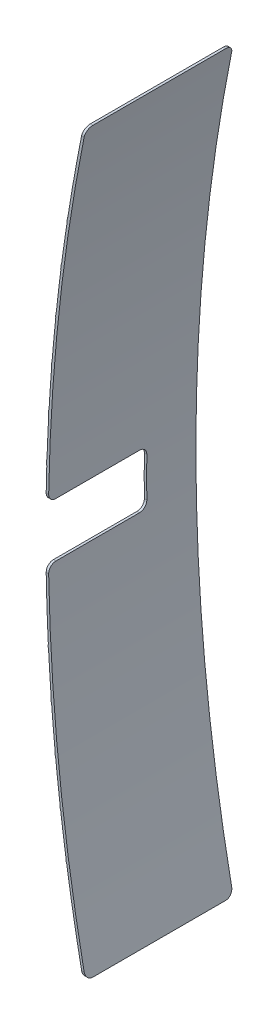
ISO-10303-21;
HEADER;
FILE_DESCRIPTION(('STEP AP214'),'2;1');
FILE_NAME('part.step','',(''),(''),'','','');
FILE_SCHEMA(('AUTOMOTIVE_DESIGN { 1 0 10303 214 1 1 1 1 }'));
ENDSEC;
DATA;
#1=APPLICATION_CONTEXT('core data for automotive mechanical design processes');
#2=APPLICATION_PROTOCOL_DEFINITION('international standard','automotive_design',2000,#1);
#3=PRODUCT_CONTEXT('',#1,'mechanical');
#4=PRODUCT('Part','Part','',(#3));
#5=PRODUCT_RELATED_PRODUCT_CATEGORY('part','',(#4));
#6=PRODUCT_DEFINITION_FORMATION('','',#4);
#7=PRODUCT_DEFINITION_CONTEXT('part definition',#1,'design');
#8=PRODUCT_DEFINITION('design','',#6,#7);
#9=PRODUCT_DEFINITION_SHAPE('','',#8);
#10=(LENGTH_UNIT() NAMED_UNIT(*) SI_UNIT(.MILLI.,.METRE.));
#11=(NAMED_UNIT(*) PLANE_ANGLE_UNIT() SI_UNIT($,.RADIAN.));
#12=(NAMED_UNIT(*) SI_UNIT($,.STERADIAN.) SOLID_ANGLE_UNIT());
#13=UNCERTAINTY_MEASURE_WITH_UNIT(LENGTH_MEASURE(1.E-05),#10,'distance_accuracy_value','');
#14=(GEOMETRIC_REPRESENTATION_CONTEXT(3) GLOBAL_UNCERTAINTY_ASSIGNED_CONTEXT((#13)) GLOBAL_UNIT_ASSIGNED_CONTEXT((#10,
#11,#12)) REPRESENTATION_CONTEXT('',''));
#15=CARTESIAN_POINT('',(0.,0.,0.));
#16=DIRECTION('',(0.,0.,1.));
#17=DIRECTION('',(1.,0.,0.));
#18=AXIS2_PLACEMENT_3D('',#15,#16,#17);
#19=CARTESIAN_POINT('',(0.,0.,6.));
#20=DIRECTION('',(0.,0.,-1.));
#21=DIRECTION('',(-1.,0.,0.));
#22=AXIS2_PLACEMENT_3D('',#19,#20,#21);
#23=CYLINDRICAL_SURFACE('',#22,75.1);
#24=DIRECTION('',(0.,0.,-1.));
#25=VECTOR('',#24,1.);
#26=CARTESIAN_POINT('',(-74.1658906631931,11.8080761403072,3.1));
#27=LINE('',#26,#25);
#28=CARTESIAN_POINT('',(-74.1658906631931,11.8080761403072,3.1));
#29=VERTEX_POINT('',#28);
#30=CARTESIAN_POINT('',(-74.1658906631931,11.8080761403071,2.9));
#31=VERTEX_POINT('',#30);
#32=EDGE_CURVE('E1607',#29,#31,#27,.T.);
#33=ORIENTED_EDGE('',*,*,#32,.T.);
#34=CARTESIAN_POINT('',(0.,0.,2.9));
#35=DIRECTION('',(0.,0.,-1.));
#36=DIRECTION('',(-0.980494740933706,0.19654532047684,0.));
#37=AXIS2_PLACEMENT_3D('',#34,#35,#36);
#38=CIRCLE('',#37,75.1);
#39=CARTESIAN_POINT('',(-73.6351550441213,14.7605535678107,2.9));
#40=VERTEX_POINT('',#39);
#41=EDGE_CURVE('E2915',#31,#40,#38,.T.);
#42=ORIENTED_EDGE('',*,*,#41,.T.);
#43=DIRECTION('',(0.,0.,1.));
#44=VECTOR('',#43,1.);
#45=CARTESIAN_POINT('',(-73.6351550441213,14.7605535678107,2.9));
#46=LINE('',#45,#44);
#47=CARTESIAN_POINT('',(-73.6351550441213,14.7605535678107,3.1));
#48=VERTEX_POINT('',#47);
#49=EDGE_CURVE('E803',#40,#48,#46,.T.);
#50=ORIENTED_EDGE('',*,*,#49,.T.);
#51=CARTESIAN_POINT('',(0.,0.,3.1));
#52=DIRECTION('',(0.,0.,-1.));
#53=DIRECTION('',(-0.980494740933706,0.19654532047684,0.));
#54=AXIS2_PLACEMENT_3D('',#51,#52,#53);
#55=CIRCLE('',#54,75.1);
#56=EDGE_CURVE('E2902',#29,#48,#55,.T.);
#57=ORIENTED_EDGE('',*,*,#56,.F.);
#58=EDGE_LOOP('',(#33,#42,#50,#57));
#59=FACE_BOUND('',#58,.T.);
#60=CARTESIAN_POINT('',(0.,0.,6.));
#61=DIRECTION('',(0.,0.,1.));
#62=DIRECTION('',(1.,0.,0.));
#63=AXIS2_PLACEMENT_3D('',#60,#61,#62);
#64=CIRCLE('',#63,75.1);
#65=CARTESIAN_POINT('',(-75.0621160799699,2.38510578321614,6.));
#66=VERTEX_POINT('',#65);
#67=CARTESIAN_POINT('',(-75.0869495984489,1.4,6.));
#68=VERTEX_POINT('',#67);
#69=EDGE_CURVE('E835',#66,#68,#64,.T.);
#70=ORIENTED_EDGE('',*,*,#69,.F.);
#71=DIRECTION('',(0.,0.,-1.));
#72=VECTOR('',#71,1.);
#73=CARTESIAN_POINT('',(-75.0621160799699,2.38510578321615,6.));
#74=LINE('',#73,#72);
#75=CARTESIAN_POINT('',(-75.0621160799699,2.38510578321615,2.));
#76=VERTEX_POINT('',#75);
#77=EDGE_CURVE('E798',#66,#76,#74,.T.);
#78=ORIENTED_EDGE('',*,*,#77,.T.);
#79=CARTESIAN_POINT('',(0.,0.,2.));
#80=DIRECTION('',(0.,0.,-1.));
#81=DIRECTION('',(-0.99940743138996,0.0344207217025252,0.));
#82=AXIS2_PLACEMENT_3D('',#79,#80,#81);
#83=CIRCLE('',#82,75.1);
#84=CARTESIAN_POINT('',(-75.055498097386,2.58499619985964,2.));
#85=VERTEX_POINT('',#84);
#86=EDGE_CURVE('E802',#76,#85,#83,.T.);
#87=ORIENTED_EDGE('',*,*,#86,.T.);
#88=DIRECTION('',(0.,0.,1.));
#89=VECTOR('',#88,1.);
#90=CARTESIAN_POINT('',(-75.055498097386,2.58499619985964,2.));
#91=LINE('',#90,#89);
#92=CARTESIAN_POINT('',(-75.055498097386,2.58499619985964,6.));
#93=VERTEX_POINT('',#92);
#94=EDGE_CURVE('E807',#85,#93,#91,.T.);
#95=ORIENTED_EDGE('',*,*,#94,.T.);
#96=CARTESIAN_POINT('',(-74.9833959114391,4.18334048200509,6.));
#97=VERTEX_POINT('',#96);
#98=EDGE_CURVE('E829',#97,#93,#64,.T.);
#99=ORIENTED_EDGE('',*,*,#98,.F.);
#100=DIRECTION('',(0.,0.,-1.));
#101=VECTOR('',#100,1.);
#102=CARTESIAN_POINT('',(-74.9833959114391,4.18334048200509,5.99999999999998));
#103=LINE('',#102,#101);
#104=CARTESIAN_POINT('',(-74.9833959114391,4.18334048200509,1.99999999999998));
#105=VERTEX_POINT('',#104);
#106=EDGE_CURVE('E810',#97,#105,#103,.T.);
#107=ORIENTED_EDGE('',*,*,#106,.T.);
#108=CARTESIAN_POINT('',(0.,0.,1.99999999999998));
#109=DIRECTION('',(0.,0.,-1.));
#110=DIRECTION('',(-0.998295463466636,0.0583623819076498,0.));
#111=AXIS2_PLACEMENT_3D('',#108,#109,#110);
#112=CIRCLE('',#111,75.1);
#113=CARTESIAN_POINT('',(-74.9719893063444,4.3830148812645,1.99999999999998));
#114=VERTEX_POINT('',#113);
#115=EDGE_CURVE('E840',#105,#114,#112,.T.);
#116=ORIENTED_EDGE('',*,*,#115,.T.);
#117=DIRECTION('',(0.,0.,1.));
#118=VECTOR('',#117,1.);
#119=CARTESIAN_POINT('',(-74.9719893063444,4.3830148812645,1.99999999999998));
#120=LINE('',#119,#118);
#121=CARTESIAN_POINT('',(-74.9719893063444,4.38301488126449,6.));
#122=VERTEX_POINT('',#121);
#123=EDGE_CURVE('E844',#114,#122,#120,.T.);
#124=ORIENTED_EDGE('',*,*,#123,.T.);
#125=CARTESIAN_POINT('',(-74.8616023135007,5.97917210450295,6.));
#126=VERTEX_POINT('',#125);
#127=EDGE_CURVE('E869',#126,#122,#64,.T.);
#128=ORIENTED_EDGE('',*,*,#127,.F.);
#129=DIRECTION('',(0.,0.,-1.));
#130=VECTOR('',#129,1.);
#131=CARTESIAN_POINT('',(-74.8616023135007,5.97917210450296,5.99999999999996));
#132=LINE('',#131,#130);
#133=CARTESIAN_POINT('',(-74.8616023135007,5.97917210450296,1.99999999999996));
#134=VERTEX_POINT('',#133);
#135=EDGE_CURVE('E848',#126,#134,#132,.T.);
#136=ORIENTED_EDGE('',*,*,#135,.T.);
#137=CARTESIAN_POINT('',(0.,0.,1.99999999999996));
#138=DIRECTION('',(0.,0.,-1.));
#139=DIRECTION('',(-0.996610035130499,0.0822705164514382,0.));
#140=AXIS2_PLACEMENT_3D('',#137,#138,#139);
#141=CIRCLE('',#140,75.1);
#142=CARTESIAN_POINT('',(-74.8454136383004,6.17851578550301,1.99999999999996));
#143=VERTEX_POINT('',#142);
#144=EDGE_CURVE('E1213',#134,#143,#141,.T.);
#145=ORIENTED_EDGE('',*,*,#144,.T.);
#146=DIRECTION('',(0.,0.,1.));
#147=VECTOR('',#146,1.);
#148=CARTESIAN_POINT('',(-74.8454136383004,6.17851578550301,1.99999999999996));
#149=LINE('',#148,#147);
#150=CARTESIAN_POINT('',(-74.8454136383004,6.17851578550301,6.));
#151=VERTEX_POINT('',#150);
#152=EDGE_CURVE('E1174',#143,#151,#149,.T.);
#153=ORIENTED_EDGE('',*,*,#152,.T.);
#154=CARTESIAN_POINT('',(-74.6968052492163,7.77156905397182,6.));
#155=VERTEX_POINT('',#154);
#156=EDGE_CURVE('E1207',#155,#151,#64,.T.);
#157=ORIENTED_EDGE('',*,*,#156,.F.);
#158=DIRECTION('',(0.,0.,-1.));
#159=VECTOR('',#158,1.);
#160=CARTESIAN_POINT('',(-74.6968052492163,7.77156905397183,5.99999999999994));
#161=LINE('',#160,#159);
#162=CARTESIAN_POINT('',(-74.6968052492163,7.77156905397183,1.99999999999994));
#163=VERTEX_POINT('',#162);
#164=EDGE_CURVE('E1169',#155,#163,#161,.T.);
#165=ORIENTED_EDGE('',*,*,#164,.T.);
#166=CARTESIAN_POINT('',(0.,0.,1.99999999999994));
#167=DIRECTION('',(0.,0.,-1.));
#168=DIRECTION('',(-0.99435211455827,0.106131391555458,0.));
#169=AXIS2_PLACEMENT_3D('',#166,#167,#168);
#170=CIRCLE('',#169,75.1);
#171=CARTESIAN_POINT('',(-74.675843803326,7.97046750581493,1.99999999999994));
#172=VERTEX_POINT('',#171);
#173=EDGE_CURVE('E1173',#163,#172,#170,.T.);
#174=ORIENTED_EDGE('',*,*,#173,.T.);
#175=DIRECTION('',(0.,0.,1.));
#176=VECTOR('',#175,1.);
#177=CARTESIAN_POINT('',(-74.675843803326,7.97046750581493,1.99999999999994));
#178=LINE('',#177,#176);
#179=CARTESIAN_POINT('',(-74.675843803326,7.97046750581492,6.));
#180=VERTEX_POINT('',#179);
#181=EDGE_CURVE('E1133',#172,#180,#178,.T.);
#182=ORIENTED_EDGE('',*,*,#181,.T.);
#183=CARTESIAN_POINT('',(-74.4890993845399,9.55950170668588,6.));
#184=VERTEX_POINT('',#183);
#185=EDGE_CURVE('E1166',#184,#180,#64,.T.);
#186=ORIENTED_EDGE('',*,*,#185,.F.);
#187=DIRECTION('',(0.,0.,-1.));
#188=VECTOR('',#187,1.);
#189=CARTESIAN_POINT('',(-74.4890993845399,9.55950170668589,5.99999999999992));
#190=LINE('',#189,#188);
#191=CARTESIAN_POINT('',(-74.4890993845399,9.55950170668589,1.99999999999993));
#192=VERTEX_POINT('',#191);
#193=EDGE_CURVE('E1128',#184,#192,#190,.T.);
#194=ORIENTED_EDGE('',*,*,#193,.T.);
#195=CARTESIAN_POINT('',(0.,0.,1.99999999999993));
#196=DIRECTION('',(0.,0.,-1.));
#197=DIRECTION('',(-0.991522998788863,0.12993130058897,0.));
#198=AXIS2_PLACEMENT_3D('',#195,#196,#197);
#199=CIRCLE('',#198,75.1);
#200=CARTESIAN_POINT('',(-74.4633772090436,9.75784067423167,1.99999999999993));
#201=VERTEX_POINT('',#200);
#202=EDGE_CURVE('E1132',#192,#201,#199,.T.);
#203=ORIENTED_EDGE('',*,*,#202,.T.);
#204=DIRECTION('',(0.,0.,1.));
#205=VECTOR('',#204,1.);
#206=CARTESIAN_POINT('',(-74.4633772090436,9.75784067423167,1.99999999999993));
#207=LINE('',#206,#205);
#208=CARTESIAN_POINT('',(-74.4633772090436,9.75784067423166,6.));
#209=VERTEX_POINT('',#208);
#210=EDGE_CURVE('E1089',#201,#209,#207,.T.);
#211=ORIENTED_EDGE('',*,*,#210,.T.);
#212=CARTESIAN_POINT('',(-74.2386040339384,11.3419430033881,6.));
#213=VERTEX_POINT('',#212);
#214=EDGE_CURVE('E1125',#213,#209,#64,.T.);
#215=ORIENTED_EDGE('',*,*,#214,.F.);
#216=DIRECTION('',(0.,0.,-1.));
#217=VECTOR('',#216,1.);
#218=CARTESIAN_POINT('',(-74.2386040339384,11.3419430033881,5.99999999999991));
#219=LINE('',#218,#217);
#220=CARTESIAN_POINT('',(-74.2386040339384,11.3419430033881,1.99999999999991));
#221=VERTEX_POINT('',#220);
#222=EDGE_CURVE('E1084',#213,#221,#219,.T.);
#223=ORIENTED_EDGE('',*,*,#222,.T.);
#224=CARTESIAN_POINT('',(0.,0.,1.99999999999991));
#225=DIRECTION('',(0.,0.,-1.));
#226=DIRECTION('',(-0.988124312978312,0.153656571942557,0.));
#227=AXIS2_PLACEMENT_3D('',#224,#225,#226);
#228=CIRCLE('',#227,75.1);
#229=CARTESIAN_POINT('',(-74.2081359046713,11.539608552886,1.99999999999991));
#230=VERTEX_POINT('',#229);
#231=EDGE_CURVE('E1088',#221,#230,#228,.T.);
#232=ORIENTED_EDGE('',*,*,#231,.T.);
#233=DIRECTION('',(0.,0.,1.));
#234=VECTOR('',#233,1.);
#235=CARTESIAN_POINT('',(-74.2081359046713,11.539608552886,1.99999999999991));
#236=LINE('',#235,#234);
#237=CARTESIAN_POINT('',(-74.2081359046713,11.539608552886,6.));
#238=VERTEX_POINT('',#237);
#239=EDGE_CURVE('E1093',#230,#238,#236,.T.);
#240=ORIENTED_EDGE('',*,*,#239,.T.);
#241=CARTESIAN_POINT('',(-73.6472674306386,14.7,6.));
#242=VERTEX_POINT('',#241);
#243=EDGE_CURVE('E1118',#242,#238,#64,.T.);
#244=ORIENTED_EDGE('',*,*,#243,.F.);
#245=CARTESIAN_POINT('',(-73.6472674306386,14.7,6.));
#246=CARTESIAN_POINT('',(-73.6438482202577,14.717131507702,6.00001312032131));
#247=CARTESIAN_POINT('',(-73.6404230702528,14.7342592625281,5.9985332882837));
#248=CARTESIAN_POINT('',(-73.6336583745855,14.7680276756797,5.99268357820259));
#249=CARTESIAN_POINT('',(-73.6303188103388,14.7846684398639,5.98831433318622));
#250=CARTESIAN_POINT('',(-73.6238190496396,14.8170018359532,5.97677778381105));
#251=CARTESIAN_POINT('',(-73.6206589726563,14.8326938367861,5.9696086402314));
#252=CARTESIAN_POINT('',(-73.6146162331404,14.8626548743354,5.95266440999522));
#253=CARTESIAN_POINT('',(-73.6117334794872,14.8769243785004,5.94289018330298));
#254=CARTESIAN_POINT('',(-73.6063581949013,14.9034967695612,5.92109232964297));
#255=CARTESIAN_POINT('',(-73.6038624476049,14.915815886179,5.90908929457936));
#256=CARTESIAN_POINT('',(-73.5993106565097,14.9382596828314,5.88310374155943));
#257=CARTESIAN_POINT('',(-73.5972546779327,14.9483840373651,5.86912093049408));
#258=CARTESIAN_POINT('',(-73.5936860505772,14.9659430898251,5.83985755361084));
#259=CARTESIAN_POINT('',(-73.592163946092,14.9734246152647,5.82460620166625));
#260=CARTESIAN_POINT('',(-73.5896624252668,14.9857139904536,5.79302656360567));
#261=CARTESIAN_POINT('',(-73.5886825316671,14.9905241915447,5.77669923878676));
#262=CARTESIAN_POINT('',(-73.5875785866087,14.9959421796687,5.75020230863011));
#263=CARTESIAN_POINT('',(-73.5872686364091,14.997462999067,5.74021802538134));
#264=CARTESIAN_POINT('',(-73.5868551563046,14.9994916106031,5.72015741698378));
#265=CARTESIAN_POINT('',(-73.5867513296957,15.0000008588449,5.71008124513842));
#266=CARTESIAN_POINT('',(-73.5867515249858,15.0000000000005,5.7000000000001));
#267=B_SPLINE_CURVE_WITH_KNOTS('',3,(#245,#246,#247,#248,#249,#250,#251,#252,#253,#254,#255,
#256,#257,#258,#259,#260,#261,#262,#263,#264,#265,#266),.UNSPECIFIED.,.F.,.F.,(4,2,2,2,2,2,2,2,
2,2,4),(0.,0.0523423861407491,0.104673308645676,0.15703866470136,0.209386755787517,
0.261273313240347,0.31316756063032,0.364089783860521,0.414967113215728,0.445231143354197,
0.475451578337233),.UNSPECIFIED.);
#268=CARTESIAN_POINT('',(-73.5867515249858,15.,5.7));
#269=VERTEX_POINT('',#268);
#270=EDGE_CURVE('E1097',#242,#269,#267,.T.);
#271=ORIENTED_EDGE('',*,*,#270,.T.);
#272=DIRECTION('',(0.,0.,-1.));
#273=VECTOR('',#272,1.);
#274=CARTESIAN_POINT('',(-73.5867515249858,15.,6.));
#275=LINE('',#274,#273);
#276=CARTESIAN_POINT('',(-73.5867515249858,15.,0.3));
#277=VERTEX_POINT('',#276);
#278=EDGE_CURVE('E1366',#269,#277,#275,.T.);
#279=ORIENTED_EDGE('',*,*,#278,.T.);
#280=CARTESIAN_POINT('',(-73.5867515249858,15.,0.3));
#281=CARTESIAN_POINT('',(-73.586748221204,15.0000154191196,0.283366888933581));
#282=CARTESIAN_POINT('',(-73.5870332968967,14.9986176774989,0.266740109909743));
#283=CARTESIAN_POINT('',(-73.5881553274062,14.9931120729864,0.233982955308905));
#284=CARTESIAN_POINT('',(-73.5889915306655,14.9890079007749,0.217851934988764));
#285=CARTESIAN_POINT('',(-73.5911913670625,14.9782035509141,0.186517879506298));
#286=CARTESIAN_POINT('',(-73.5925551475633,14.9715026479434,0.171315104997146));
#287=CARTESIAN_POINT('',(-73.5957647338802,14.9557172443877,0.14226006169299));
#288=CARTESIAN_POINT('',(-73.5976105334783,14.9466327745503,0.12840777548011));
#289=CARTESIAN_POINT('',(-73.6017449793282,14.9262602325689,0.102306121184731));
#290=CARTESIAN_POINT('',(-73.604037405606,14.9149533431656,0.0900720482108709));
#291=CARTESIAN_POINT('',(-73.6089848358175,14.89051733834,0.0676683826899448));
#292=CARTESIAN_POINT('',(-73.6116399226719,14.8773878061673,0.0574992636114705));
#293=CARTESIAN_POINT('',(-73.6172883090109,14.8494130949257,0.0393096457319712));
#294=CARTESIAN_POINT('',(-73.6202871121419,14.8345398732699,0.031334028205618));
#295=CARTESIAN_POINT('',(-73.626493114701,14.8037075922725,0.0179953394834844));
#296=CARTESIAN_POINT('',(-73.6297002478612,14.7877488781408,0.012631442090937));
#297=CARTESIAN_POINT('',(-73.6353121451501,14.7597746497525,0.005768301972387));
#298=CARTESIAN_POINT('',(-73.6376890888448,14.7479114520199,0.00360658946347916));
#299=CARTESIAN_POINT('',(-73.6424672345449,14.7240337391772,0.000722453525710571));
#300=CARTESIAN_POINT('',(-73.6448683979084,14.7120194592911,-1.98166244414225E-06));
#301=CARTESIAN_POINT('',(-73.6472674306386,14.7,0.));
#302=B_SPLINE_CURVE_WITH_KNOTS('',3,(#280,#281,#282,#283,#284,#285,#286,#287,#288,#289,#290,
#291,#292,#293,#294,#295,#296,#297,#298,#299,#300,#301),.UNSPECIFIED.,.F.,.F.,(4,2,2,2,2,2,2,2,
2,2,4),(0.,0.0498288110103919,0.099589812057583,0.149364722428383,0.199138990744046,
0.24935441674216,0.299581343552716,0.350770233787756,0.40194292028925,0.438733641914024,
0.47547283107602),.UNSPECIFIED.);
#303=CARTESIAN_POINT('',(-73.6472674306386,14.7,0.));
#304=VERTEX_POINT('',#303);
#305=EDGE_CURVE('E1369',#277,#304,#302,.T.);
#306=ORIENTED_EDGE('',*,*,#305,.T.);
#307=CARTESIAN_POINT('',(0.,0.,0.));
#308=DIRECTION('',(0.,0.,1.));
#309=DIRECTION('',(1.,0.,0.));
#310=AXIS2_PLACEMENT_3D('',#307,#308,#309);
#311=CIRCLE('',#310,75.1);
#312=CARTESIAN_POINT('',(-75.0342512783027,3.14183626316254,0.));
#313=VERTEX_POINT('',#312);
#314=EDGE_CURVE('E1351',#304,#313,#311,.T.);
#315=ORIENTED_EDGE('',*,*,#314,.T.);
#316=CARTESIAN_POINT('',(-75.0998643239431,0.142753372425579,2.));
#317=CARTESIAN_POINT('',(-75.0979634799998,1.14275161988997,1.33333329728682));
#318=CARTESIAN_POINT('',(-75.0760866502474,2.14271169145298,0.666666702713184));
#319=CARTESIAN_POINT('',(-75.0342512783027,3.14183626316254,0.));
#320=B_SPLINE_CURVE_WITH_KNOTS('',3,(#316,#317,#318,#319),.UNSPECIFIED.,.F.,.F.,(4,4),(0.,1.),.UNSPECIFIED.);
#321=CARTESIAN_POINT('',(-75.0998643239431,0.142753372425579,2.));
#322=VERTEX_POINT('',#321);
#323=EDGE_CURVE('E2859',#313,#322,#320,.F.);
#324=ORIENTED_EDGE('',*,*,#323,.T.);
#325=CARTESIAN_POINT('',(0.,0.,2.));
#326=DIRECTION('',(0.,0.,-1.));
#327=DIRECTION('',(-1.,0.,0.));
#328=AXIS2_PLACEMENT_3D('',#325,#326,#327);
#329=CIRCLE('',#328,75.1);
#330=CARTESIAN_POINT('',(-75.0957388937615,0.8,2.));
#331=VERTEX_POINT('',#330);
#332=EDGE_CURVE('E1353',#322,#331,#329,.T.);
#333=ORIENTED_EDGE('',*,*,#332,.T.);
#334=CARTESIAN_POINT('',(-75.0957388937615,0.8,2.));
#335=CARTESIAN_POINT('',(-75.0955593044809,0.816878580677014,1.99998567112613));
#336=CARTESIAN_POINT('',(-75.0953736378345,0.833752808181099,2.00142357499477));
#337=CARTESIAN_POINT('',(-75.0949969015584,0.867010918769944,2.00709804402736));
#338=CARTESIAN_POINT('',(-75.0948058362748,0.883395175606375,2.01133241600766));
#339=CARTESIAN_POINT('',(-75.094424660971,0.915227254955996,2.0224969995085));
#340=CARTESIAN_POINT('',(-75.0942345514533,0.93067462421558,2.02942850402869));
#341=CARTESIAN_POINT('',(-75.0938630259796,0.960183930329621,2.04578458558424));
#342=CARTESIAN_POINT('',(-75.093681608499,0.974246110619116,2.0552087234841));
#343=CARTESIAN_POINT('',(-75.0933352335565,1.00058858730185,2.07628412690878));
#344=CARTESIAN_POINT('',(-75.0931702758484,1.01286891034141,2.08793535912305));
#345=CARTESIAN_POINT('',(-75.0928643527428,1.03530162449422,2.11313711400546));
#346=CARTESIAN_POINT('',(-75.092723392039,1.04545359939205,2.12668800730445));
#347=CARTESIAN_POINT('',(-75.092472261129,1.06333909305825,2.1553025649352));
#348=CARTESIAN_POINT('',(-75.0923620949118,1.07107229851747,2.17036642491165));
#349=CARTESIAN_POINT('',(-75.0921780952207,1.08389588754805,2.20157587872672));
#350=CARTESIAN_POINT('',(-75.0921042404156,1.08898782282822,2.21772083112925));
#351=CARTESIAN_POINT('',(-75.0920150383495,1.09511796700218,2.2449706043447));
#352=CARTESIAN_POINT('',(-75.0919883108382,1.09694762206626,2.25590389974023));
#353=CARTESIAN_POINT('',(-75.0919526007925,1.09938847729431,2.27788993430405));
#354=CARTESIAN_POINT('',(-75.0919435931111,1.10000140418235,2.28894248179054));
#355=CARTESIAN_POINT('',(-75.0919436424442,1.10000000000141,2.29999999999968));
#356=B_SPLINE_CURVE_WITH_KNOTS('',3,(#334,#335,#336,#337,#338,#339,#340,#341,#342,#343,#344,
#345,#346,#347,#348,#349,#350,#351,#352,#353,#354,#355),.UNSPECIFIED.,.F.,.F.,(4,2,2,2,2,2,2,2,
2,2,4),(0.,0.0505713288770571,0.101103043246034,0.151659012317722,0.202206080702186,
0.25275239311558,0.303308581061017,0.353871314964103,0.404404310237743,0.437597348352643,
0.470743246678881),.UNSPECIFIED.);
#357=CARTESIAN_POINT('',(-75.0919436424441,1.1,2.3));
#358=VERTEX_POINT('',#357);
#359=EDGE_CURVE('E1459',#331,#358,#356,.T.);
#360=ORIENTED_EDGE('',*,*,#359,.T.);
#361=DIRECTION('',(0.,0.,-1.));
#362=VECTOR('',#361,1.);
#363=CARTESIAN_POINT('',(-75.0919436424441,1.1,6.));
#364=LINE('',#363,#362);
#365=CARTESIAN_POINT('',(-75.0919436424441,1.1,5.7));
#366=VERTEX_POINT('',#365);
#367=EDGE_CURVE('E1466',#358,#366,#364,.F.);
#368=ORIENTED_EDGE('',*,*,#367,.T.);
#369=CARTESIAN_POINT('',(-75.0919436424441,1.1,5.7));
#370=CARTESIAN_POINT('',(-75.091943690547,1.09998565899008,5.71687606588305));
#371=CARTESIAN_POINT('',(-75.0919227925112,1.10142314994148,5.73374784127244));
#372=CARTESIAN_POINT('',(-75.0918394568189,1.10709596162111,5.76700116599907));
#373=CARTESIAN_POINT('',(-75.0917770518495,1.11132908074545,5.78338309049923));
#374=CARTESIAN_POINT('',(-75.0916110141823,1.12249029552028,5.81521072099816));
#375=CARTESIAN_POINT('',(-75.0915073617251,1.12941968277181,5.8306559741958));
#376=CARTESIAN_POINT('',(-75.0912596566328,1.14577057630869,5.8601613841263));
#377=CARTESIAN_POINT('',(-75.091115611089,1.15519164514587,5.87422178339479));
#378=CARTESIAN_POINT('',(-75.0907885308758,1.17626032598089,5.90056181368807));
#379=CARTESIAN_POINT('',(-75.0906054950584,1.18790800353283,5.9128413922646));
#380=CARTESIAN_POINT('',(-75.0902027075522,1.21310170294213,5.93527326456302));
#381=CARTESIAN_POINT('',(-75.0899829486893,1.22664809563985,5.94542514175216));
#382=CARTESIAN_POINT('',(-75.089510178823,1.25525519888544,5.96331298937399));
#383=CARTESIAN_POINT('',(-75.0892571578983,1.27031636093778,5.97104823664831));
#384=CARTESIAN_POINT('',(-75.0887227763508,1.30152011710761,5.98387644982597));
#385=CARTESIAN_POINT('',(-75.0884414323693,1.31766207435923,5.98897095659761));
#386=CARTESIAN_POINT('',(-75.0879571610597,1.34491880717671,5.99510870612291));
#387=CARTESIAN_POINT('',(-75.0877603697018,1.35586235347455,5.9969418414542));
#388=CARTESIAN_POINT('',(-75.0873597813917,1.37786908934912,5.99938732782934));
#389=CARTESIAN_POINT('',(-75.087155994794,1.388932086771,6.00000141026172));
#390=CARTESIAN_POINT('',(-75.0869495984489,1.39999999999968,6.00000000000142));
#391=B_SPLINE_CURVE_WITH_KNOTS('',3,(#369,#370,#371,#372,#373,#374,#375,#376,#377,#378,#379,
#380,#381,#382,#383,#384,#385,#386,#387,#388,#389,#390),.UNSPECIFIED.,.F.,.F.,(4,2,2,2,2,2,2,2,
2,2,4),(0.,0.0505609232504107,0.101082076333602,0.151627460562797,0.202163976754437,
0.252701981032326,0.303249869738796,0.353812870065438,0.404346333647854,0.437576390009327,
0.470759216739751),.UNSPECIFIED.);
#392=EDGE_CURVE('E1444',#366,#68,#391,.T.);
#393=ORIENTED_EDGE('',*,*,#392,.T.);
#394=EDGE_LOOP('',(#70,#78,#87,#95,#99,#107,#116,#124,#128,#136,#145,#153,#157,#165,#174,#182,
#186,#194,#203,#211,#215,#223,#232,#240,#244,#271,#279,#306,#315,#324,#333,#360,#368,#393));
#395=FACE_BOUND('',#394,.T.);
#396=ADVANCED_FACE('F690',(#59,#395),#23,.T.);
#397=CARTESIAN_POINT('',(0.,0.,6.));
#398=DIRECTION('',(0.,0.,1.));
#399=DIRECTION('',(1.,0.,0.));
#400=AXIS2_PLACEMENT_3D('',#397,#398,#399);
#401=PLANE('',#400);
#402=ORIENTED_EDGE('',*,*,#243,.T.);
#403=DIRECTION('',(0.988124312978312,-0.153656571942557,0.));
#404=VECTOR('',#403,1.);
#405=CARTESIAN_POINT('',(-74.2081359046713,11.539608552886,6.));
#406=LINE('',#405,#404);
#407=CARTESIAN_POINT('',(-74.218017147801,11.5411451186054,6.));
#408=VERTEX_POINT('',#407);
#409=EDGE_CURVE('E863',#408,#238,#406,.T.);
#410=ORIENTED_EDGE('',*,*,#409,.F.);
#411=CARTESIAN_POINT('',(0.,0.,6.));
#412=DIRECTION('',(0.,0.,-1.));
#413=DIRECTION('',(-1.,0.,0.));
#414=AXIS2_PLACEMENT_3D('',#411,#412,#413);
#415=CIRCLE('',#414,75.11);
#416=CARTESIAN_POINT('',(-74.2484893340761,11.3434532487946,6.));
#417=VERTEX_POINT('',#416);
#418=EDGE_CURVE('E1113',#408,#417,#415,.F.);
#419=ORIENTED_EDGE('',*,*,#418,.T.);
#420=DIRECTION('',(0.988530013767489,-0.151024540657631,0.));
#421=VECTOR('',#420,1.);
#422=CARTESIAN_POINT('',(-74.2386040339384,11.3419430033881,6.));
#423=LINE('',#422,#421);
#424=EDGE_CURVE('E1117',#417,#213,#423,.T.);
#425=ORIENTED_EDGE('',*,*,#424,.T.);
#426=ORIENTED_EDGE('',*,*,#214,.T.);
#427=DIRECTION('',(0.991522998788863,-0.12993130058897,0.));
#428=VECTOR('',#427,1.);
#429=CARTESIAN_POINT('',(-74.4633772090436,9.75784067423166,6.));
#430=LINE('',#429,#428);
#431=CARTESIAN_POINT('',(-74.4732924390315,9.75913998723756,6.));
#432=VERTEX_POINT('',#431);
#433=EDGE_CURVE('E1112',#432,#209,#430,.T.);
#434=ORIENTED_EDGE('',*,*,#433,.F.);
#435=CARTESIAN_POINT('',(0.,0.,6.));
#436=DIRECTION('',(0.,0.,-1.));
#437=DIRECTION('',(-1.,0.,0.));
#438=AXIS2_PLACEMENT_3D('',#435,#436,#437);
#439=CIRCLE('',#438,75.11);
#440=CARTESIAN_POINT('',(-74.4990180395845,9.56077460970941,6.));
#441=VERTEX_POINT('',#440);
#442=EDGE_CURVE('E1155',#432,#441,#439,.F.);
#443=ORIENTED_EDGE('',*,*,#442,.T.);
#444=DIRECTION('',(0.991865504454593,-0.127290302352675,0.));
#445=VECTOR('',#444,1.);
#446=CARTESIAN_POINT('',(-74.4890993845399,9.55950170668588,6.));
#447=LINE('',#446,#445);
#448=EDGE_CURVE('E1159',#441,#184,#447,.T.);
#449=ORIENTED_EDGE('',*,*,#448,.T.);
#450=ORIENTED_EDGE('',*,*,#185,.T.);
#451=DIRECTION('',(0.99435211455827,-0.106131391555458,0.));
#452=VECTOR('',#451,1.);
#453=CARTESIAN_POINT('',(-74.675843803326,7.97046750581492,6.));
#454=LINE('',#453,#452);
#455=CARTESIAN_POINT('',(-74.6857873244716,7.97152881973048,6.));
#456=VERTEX_POINT('',#455);
#457=EDGE_CURVE('E1154',#456,#180,#454,.T.);
#458=ORIENTED_EDGE('',*,*,#457,.F.);
#459=CARTESIAN_POINT('',(0.,0.,6.));
#460=DIRECTION('',(0.,0.,-1.));
#461=DIRECTION('',(-1.,0.,0.));
#462=AXIS2_PLACEMENT_3D('',#459,#460,#461);
#463=CIRCLE('',#462,75.11);
#464=CARTESIAN_POINT('',(-74.7067515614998,7.77260388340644,6.));
#465=VERTEX_POINT('',#464);
#466=EDGE_CURVE('E1196',#456,#465,#463,.F.);
#467=ORIENTED_EDGE('',*,*,#466,.T.);
#468=DIRECTION('',(0.994631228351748,-0.103482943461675,0.));
#469=VECTOR('',#468,1.);
#470=CARTESIAN_POINT('',(-74.6968052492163,7.77156905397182,6.));
#471=LINE('',#470,#469);
#472=EDGE_CURVE('E1200',#465,#155,#471,.T.);
#473=ORIENTED_EDGE('',*,*,#472,.T.);
#474=ORIENTED_EDGE('',*,*,#156,.T.);
#475=DIRECTION('',(0.996610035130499,-0.0822705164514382,0.));
#476=VECTOR('',#475,1.);
#477=CARTESIAN_POINT('',(-74.8454136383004,6.17851578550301,6.));
#478=LINE('',#477,#476);
#479=CARTESIAN_POINT('',(-74.8553797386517,6.17933849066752,6.));
#480=VERTEX_POINT('',#479);
#481=EDGE_CURVE('E1195',#480,#151,#478,.T.);
#482=ORIENTED_EDGE('',*,*,#481,.F.);
#483=CARTESIAN_POINT('',(0.,0.,6.));
#484=DIRECTION('',(0.,0.,-1.));
#485=DIRECTION('',(-1.,0.,0.));
#486=AXIS2_PLACEMENT_3D('',#483,#484,#485);
#487=CIRCLE('',#486,75.11);
#488=CARTESIAN_POINT('',(-74.8715705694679,5.97996826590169,6.));
#489=VERTEX_POINT('',#488);
#490=EDGE_CURVE('E1233',#480,#489,#487,.F.);
#491=ORIENTED_EDGE('',*,*,#490,.T.);
#492=DIRECTION('',(0.996825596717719,-0.0796161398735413,0.));
#493=VECTOR('',#492,1.);
#494=CARTESIAN_POINT('',(-74.8616023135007,5.97917210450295,6.));
#495=LINE('',#494,#493);
#496=EDGE_CURVE('E1237',#489,#126,#495,.T.);
#497=ORIENTED_EDGE('',*,*,#496,.T.);
#498=ORIENTED_EDGE('',*,*,#127,.T.);
#499=DIRECTION('',(0.998295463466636,-0.0583623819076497,0.));
#500=VECTOR('',#499,1.);
#501=CARTESIAN_POINT('',(-74.9719893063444,4.38301488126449,6.));
#502=LINE('',#501,#500);
#503=CARTESIAN_POINT('',(-74.981972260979,4.38359850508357,6.));
#504=VERTEX_POINT('',#503);
#505=EDGE_CURVE('E823',#504,#122,#502,.T.);
#506=ORIENTED_EDGE('',*,*,#505,.F.);
#507=CARTESIAN_POINT('',(0.,0.,6.));
#508=DIRECTION('',(0.,0.,-1.));
#509=DIRECTION('',(-1.,0.,0.));
#510=AXIS2_PLACEMENT_3D('',#507,#508,#509);
#511=CIRCLE('',#510,75.11);
#512=CARTESIAN_POINT('',(-74.9933803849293,4.18389751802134,6.));
#513=VERTEX_POINT('',#512);
#514=EDGE_CURVE('E864',#504,#513,#511,.F.);
#515=ORIENTED_EDGE('',*,*,#514,.T.);
#516=DIRECTION('',(0.998447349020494,-0.0557036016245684,0.));
#517=VECTOR('',#516,1.);
#518=CARTESIAN_POINT('',(-74.9833959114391,4.18334048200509,6.));
#519=LINE('',#518,#517);
#520=EDGE_CURVE('E868',#513,#97,#519,.T.);
#521=ORIENTED_EDGE('',*,*,#520,.T.);
#522=ORIENTED_EDGE('',*,*,#98,.T.);
#523=DIRECTION('',(0.99940743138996,-0.0344207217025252,0.));
#524=VECTOR('',#523,1.);
#525=CARTESIAN_POINT('',(-75.055498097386,2.58499619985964,6.));
#526=LINE('',#525,#524);
#527=CARTESIAN_POINT('',(-75.0654921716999,2.58534040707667,6.));
#528=VERTEX_POINT('',#527);
#529=EDGE_CURVE('E13',#528,#93,#526,.T.);
#530=ORIENTED_EDGE('',*,*,#529,.F.);
#531=CARTESIAN_POINT('',(0.,0.,6.));
#532=DIRECTION('',(0.,0.,-1.));
#533=DIRECTION('',(-1.,0.,0.));
#534=AXIS2_PLACEMENT_3D('',#531,#532,#533);
#535=CIRCLE('',#534,75.11);
#536=CARTESIAN_POINT('',(-75.0721110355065,2.38542337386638,6.));
#537=VERTEX_POINT('',#536);
#538=EDGE_CURVE('E824',#528,#537,#535,.F.);
#539=ORIENTED_EDGE('',*,*,#538,.T.);
#540=DIRECTION('',(0.999495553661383,-0.0317590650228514,0.));
#541=VECTOR('',#540,1.);
#542=CARTESIAN_POINT('',(-75.0621160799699,2.38510578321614,6.));
#543=LINE('',#542,#541);
#544=EDGE_CURVE('E828',#537,#66,#543,.T.);
#545=ORIENTED_EDGE('',*,*,#544,.T.);
#546=ORIENTED_EDGE('',*,*,#69,.T.);
#547=DIRECTION('',(-1.,0.,0.));
#548=VECTOR('',#547,1.);
#549=CARTESIAN_POINT('',(-74.9919328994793,1.4,6.));
#550=LINE('',#549,#548);
#551=CARTESIAN_POINT('',(-74.9869321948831,1.4,6.));
#552=VERTEX_POINT('',#551);
#553=EDGE_CURVE('E1578',#68,#552,#550,.F.);
#554=ORIENTED_EDGE('',*,*,#553,.T.);
#555=CARTESIAN_POINT('',(0.,0.,6.));
#556=DIRECTION('',(0.,0.,-1.));
#557=DIRECTION('',(1.,0.,0.));
#558=AXIS2_PLACEMENT_3D('',#555,#556,#557);
#559=CIRCLE('',#558,75.);
#560=CARTESIAN_POINT('',(-73.54529216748,14.7,6.));
#561=VERTEX_POINT('',#560);
#562=EDGE_CURVE('E1620',#552,#561,#559,.T.);
#563=ORIENTED_EDGE('',*,*,#562,.T.);
#564=DIRECTION('',(-1.,0.,0.));
#565=VECTOR('',#564,1.);
#566=CARTESIAN_POINT('',(-73.5867515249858,14.7,6.));
#567=LINE('',#566,#565);
#568=EDGE_CURVE('E1529',#561,#242,#567,.T.);
#569=ORIENTED_EDGE('',*,*,#568,.T.);
#570=EDGE_LOOP('',(#402,#410,#419,#425,#426,#434,#443,#449,#450,#458,#467,#473,#474,#482,#491,
#497,#498,#506,#515,#521,#522,#530,#539,#545,#546,#554,#563,#569));
#571=FACE_BOUND('',#570,.T.);
#572=ADVANCED_FACE('F1593',(#571),#401,.T.);
#573=CARTESIAN_POINT('',(0.,0.,6.));
#574=DIRECTION('',(0.,0.,-1.));
#575=DIRECTION('',(-1.,0.,0.));
#576=AXIS2_PLACEMENT_3D('',#573,#574,#575);
#577=CYLINDRICAL_SURFACE('',#576,75.);
#578=ORIENTED_EDGE('',*,*,#562,.F.);
#579=CARTESIAN_POINT('',(-74.9869321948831,1.4,6.));
#580=CARTESIAN_POINT('',(-74.9872475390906,1.38312127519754,6.00001432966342));
#581=CARTESIAN_POINT('',(-74.9875566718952,1.36624668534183,5.99857639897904));
#582=CARTESIAN_POINT('',(-74.9881551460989,1.33298740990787,5.99290161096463));
#583=CARTESIAN_POINT('',(-74.988444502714,1.31660235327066,5.98866693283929));
#584=CARTESIAN_POINT('',(-74.9889967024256,1.28476835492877,5.97750124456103));
#585=CARTESIAN_POINT('',(-74.9892595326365,1.26931986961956,5.97056893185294));
#586=CARTESIAN_POINT('',(-74.989753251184,1.23980834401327,5.95421064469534));
#587=CARTESIAN_POINT('',(-74.9899841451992,1.2257450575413,5.94478511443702));
#588=CARTESIAN_POINT('',(-74.9904101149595,1.19940185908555,5.92370732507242));
#589=CARTESIAN_POINT('',(-74.9906051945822,1.1871217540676,5.91205530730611));
#590=CARTESIAN_POINT('',(-74.9909569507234,1.16468955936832,5.88685182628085));
#591=CARTESIAN_POINT('',(-74.9911136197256,1.15453788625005,5.87329999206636));
#592=CARTESIAN_POINT('',(-74.9913868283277,1.13665380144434,5.84468444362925));
#593=CARTESIAN_POINT('',(-74.9915033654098,1.12892154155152,5.8296206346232));
#594=CARTESIAN_POINT('',(-74.991695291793,1.11609974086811,5.7984114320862));
#595=CARTESIAN_POINT('',(-74.9917707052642,1.11100864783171,5.78226668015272));
#596=CARTESIAN_POINT('',(-74.991861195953,1.10488019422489,5.75501911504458));
#597=CARTESIAN_POINT('',(-74.9918880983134,1.10305122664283,5.74408782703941));
#598=CARTESIAN_POINT('',(-74.9919239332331,1.100611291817,5.72210588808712));
#599=CARTESIAN_POINT('',(-74.9919328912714,1.09999859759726,5.71105542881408));
#600=CARTESIAN_POINT('',(-74.9919328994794,1.09999999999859,5.70000000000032));
#601=B_SPLINE_CURVE_WITH_KNOTS('',3,(#579,#580,#581,#582,#583,#584,#585,#586,#587,#588,#589,
#590,#591,#592,#593,#594,#595,#596,#597,#598,#599,#600),.UNSPECIFIED.,.F.,.F.,(4,2,2,2,2,2,2,2,
2,2,4),(0.,0.050577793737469,0.101116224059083,0.151679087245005,0.202232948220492,
0.252781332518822,0.303339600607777,0.353901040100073,0.404432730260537,0.437619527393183,
0.470759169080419),.UNSPECIFIED.);
#602=CARTESIAN_POINT('',(-74.9919328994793,1.1,5.7));
#603=VERTEX_POINT('',#602);
#604=EDGE_CURVE('E1521',#552,#603,#601,.T.);
#605=ORIENTED_EDGE('',*,*,#604,.T.);
#606=DIRECTION('',(0.,0.,-1.));
#607=VECTOR('',#606,1.);
#608=CARTESIAN_POINT('',(-74.9919328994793,1.1,6.));
#609=LINE('',#608,#607);
#610=CARTESIAN_POINT('',(-74.9919328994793,1.1,2.3));
#611=VERTEX_POINT('',#610);
#612=EDGE_CURVE('E1528',#603,#611,#609,.T.);
#613=ORIENTED_EDGE('',*,*,#612,.T.);
#614=CARTESIAN_POINT('',(-74.9919328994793,1.1,2.3));
#615=CARTESIAN_POINT('',(-74.9919325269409,1.10001434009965,2.28312372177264));
#616=CARTESIAN_POINT('',(-74.9919537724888,1.09857681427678,2.26625173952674));
#617=CARTESIAN_POINT('',(-74.9920367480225,1.09290386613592,2.23299803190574));
#618=CARTESIAN_POINT('',(-74.9920984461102,1.08867064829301,2.21661593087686));
#619=CARTESIAN_POINT('',(-74.9922596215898,1.07750917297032,2.18478796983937));
#620=CARTESIAN_POINT('',(-74.992359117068,1.07057962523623,2.16934256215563));
#621=CARTESIAN_POINT('',(-74.9925907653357,1.05422831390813,2.13983682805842));
#622=CARTESIAN_POINT('',(-74.9927229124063,1.04480698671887,2.12577625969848));
#623=CARTESIAN_POINT('',(-74.9930134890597,1.02373745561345,2.09943565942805));
#624=CARTESIAN_POINT('',(-74.9931719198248,1.01208915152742,2.08715570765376));
#625=CARTESIAN_POINT('',(-74.9935077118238,0.986893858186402,2.06472315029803));
#626=CARTESIAN_POINT('',(-74.9936850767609,0.973346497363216,2.05457096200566));
#627=CARTESIAN_POINT('',(-74.9940509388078,0.944737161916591,2.03668274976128));
#628=CARTESIAN_POINT('',(-74.9942394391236,0.929674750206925,2.02894742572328));
#629=CARTESIAN_POINT('',(-74.9946197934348,0.898468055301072,2.01611937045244));
#630=CARTESIAN_POINT('',(-74.9948116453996,0.882324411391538,2.01102509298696));
#631=CARTESIAN_POINT('',(-74.9951263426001,0.855068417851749,2.00488901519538));
#632=CARTESIAN_POINT('',(-74.9952503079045,0.844127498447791,2.00305674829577));
#633=CARTESIAN_POINT('',(-74.9954947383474,0.822125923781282,2.00061240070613));
#634=CARTESIAN_POINT('',(-74.9956152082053,0.811065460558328,1.99999859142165));
#635=CARTESIAN_POINT('',(-74.9957332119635,0.800000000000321,1.99999999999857));
#636=B_SPLINE_CURVE_WITH_KNOTS('',3,(#614,#615,#616,#617,#618,#619,#620,#621,#622,#623,#624,
#625,#626,#627,#628,#629,#630,#631,#632,#633,#634,#635),.UNSPECIFIED.,.F.,.F.,(4,2,2,2,2,2,2,2,
2,2,4),(0.,0.0505615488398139,0.101083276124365,0.151629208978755,0.202166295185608,
0.252705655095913,0.30325491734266,0.353818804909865,0.404353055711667,0.437571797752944,
0.470743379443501),.UNSPECIFIED.);
#637=CARTESIAN_POINT('',(-74.9957332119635,0.8,2.));
#638=VERTEX_POINT('',#637);
#639=EDGE_CURVE('E1467',#611,#638,#636,.T.);
#640=ORIENTED_EDGE('',*,*,#639,.T.);
#641=CARTESIAN_POINT('',(0.,0.,2.));
#642=DIRECTION('',(0.,0.,-1.));
#643=DIRECTION('',(-1.,0.,0.));
#644=AXIS2_PLACEMENT_3D('',#641,#642,#643);
#645=CIRCLE('',#644,75.);
#646=CARTESIAN_POINT('',(-74.9957332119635,-0.8,2.));
#647=VERTEX_POINT('',#646);
#648=EDGE_CURVE('E1495',#638,#647,#645,.F.);
#649=ORIENTED_EDGE('',*,*,#648,.T.);
#650=CARTESIAN_POINT('',(-74.9957332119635,-0.8,2.));
#651=CARTESIAN_POINT('',(-74.9955533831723,-0.816878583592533,1.99998567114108));
#652=CARTESIAN_POINT('',(-74.9953674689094,-0.833752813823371,2.00142357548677));
#653=CARTESIAN_POINT('',(-74.9949902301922,-0.867010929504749,2.00709804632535));
#654=CARTESIAN_POINT('',(-74.99479891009,-0.883395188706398,2.01133241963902));
#655=CARTESIAN_POINT('',(-74.9944172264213,-0.915227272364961,2.02249700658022));
#656=CARTESIAN_POINT('',(-74.994226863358,-0.930674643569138,2.02942851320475));
#657=CARTESIAN_POINT('',(-74.9938548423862,-0.960183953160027,2.04578459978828));
#658=CARTESIAN_POINT('',(-74.9936731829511,-0.974246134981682,2.05520874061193));
#659=CARTESIAN_POINT('',(-74.9933263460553,-1.0005886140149,2.07628415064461));
#660=CARTESIAN_POINT('',(-74.993161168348,-1.01286893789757,2.08793538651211));
#661=CARTESIAN_POINT('',(-74.9928548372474,-1.03530165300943,2.11313714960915));
#662=CARTESIAN_POINT('',(-74.9927136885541,-1.04545362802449,2.12668804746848));
#663=CARTESIAN_POINT('',(-74.9924622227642,-1.06333911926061,2.1553026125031));
#664=CARTESIAN_POINT('',(-74.9923519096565,-1.07107232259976,2.17036647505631));
#665=CARTESIAN_POINT('',(-74.9921676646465,-1.08389590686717,2.20157593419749));
#666=CARTESIAN_POINT('',(-74.9920937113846,-1.08898783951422,2.21772088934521));
#667=CARTESIAN_POINT('',(-74.992004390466,-1.09511797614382,2.24497065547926));
#668=CARTESIAN_POINT('',(-74.9919776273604,-1.09694762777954,2.25590394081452));
#669=CARTESIAN_POINT('',(-74.991941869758,-1.0993884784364,2.27788995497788));
#670=CARTESIAN_POINT('',(-74.9919328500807,-1.10000140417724,2.28894249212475));
#671=CARTESIAN_POINT('',(-74.9919328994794,-1.10000000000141,2.29999999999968));
#672=B_SPLINE_CURVE_WITH_KNOTS('',3,(#650,#651,#652,#653,#654,#655,#656,#657,#658,#659,#660,
#661,#662,#663,#664,#665,#666,#667,#668,#669,#670,#671),.UNSPECIFIED.,.F.,.F.,(4,2,2,2,2,2,2,2,
2,2,4),(0.,0.0505713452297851,0.101103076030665,0.151659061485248,0.202206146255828,
0.252752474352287,0.303308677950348,0.353871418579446,0.404404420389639,0.437597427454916,
0.470743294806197),.UNSPECIFIED.);
#673=CARTESIAN_POINT('',(-74.9919328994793,-1.1,2.3));
#674=VERTEX_POINT('',#673);
#675=EDGE_CURVE('E1487',#647,#674,#672,.T.);
#676=ORIENTED_EDGE('',*,*,#675,.T.);
#677=DIRECTION('',(0.,0.,-1.));
#678=VECTOR('',#677,1.);
#679=CARTESIAN_POINT('',(-74.9919328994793,-1.1,6.));
#680=LINE('',#679,#678);
#681=CARTESIAN_POINT('',(-74.9919328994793,-1.1,5.7));
#682=VERTEX_POINT('',#681);
#683=EDGE_CURVE('E1494',#674,#682,#680,.F.);
#684=ORIENTED_EDGE('',*,*,#683,.T.);
#685=CARTESIAN_POINT('',(-74.9919328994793,-1.1,5.7));
#686=CARTESIAN_POINT('',(-74.9919329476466,-1.09998565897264,5.71687606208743));
#687=CARTESIAN_POINT('',(-74.99191202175,-1.10142314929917,5.73374783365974));
#688=CARTESIAN_POINT('',(-74.9918285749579,-1.10709595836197,5.7670011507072));
#689=CARTESIAN_POINT('',(-74.9917660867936,-1.11132907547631,5.78338307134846));
#690=CARTESIAN_POINT('',(-74.9915998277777,-1.12249028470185,5.8152106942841));
#691=CARTESIAN_POINT('',(-74.9914960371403,-1.12941966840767,5.83065594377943));
#692=CARTESIAN_POINT('',(-74.9912480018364,-1.14577055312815,5.86016134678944));
#693=CARTESIAN_POINT('',(-74.9911037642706,-1.15519161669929,5.87422174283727));
#694=CARTESIAN_POINT('',(-74.990776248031,-1.17626028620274,5.90056176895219));
#695=CARTESIAN_POINT('',(-74.9905929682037,-1.1879079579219,5.91284134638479));
#696=CARTESIAN_POINT('',(-74.9901896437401,-1.21310164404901,5.93527321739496));
#697=CARTESIAN_POINT('',(-74.9899695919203,-1.22664802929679,5.94542509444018));
#698=CARTESIAN_POINT('',(-74.9894961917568,-1.25525512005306,5.96331294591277));
#699=CARTESIAN_POINT('',(-74.9892428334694,-1.27031627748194,5.97104819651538));
#700=CARTESIAN_POINT('',(-74.9887077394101,-1.30152002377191,5.98387641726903));
#701=CARTESIAN_POINT('',(-74.9884260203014,-1.31766197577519,5.98897092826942));
#702=CARTESIAN_POINT('',(-74.9879411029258,-1.34491872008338,5.99510869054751));
#703=CARTESIAN_POINT('',(-74.9877440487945,-1.35586228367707,5.99694183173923));
#704=CARTESIAN_POINT('',(-74.9873429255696,-1.37786905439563,5.99938732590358));
#705=CARTESIAN_POINT('',(-74.9871388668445,-1.38893206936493,6.00000141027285));
#706=CARTESIAN_POINT('',(-74.9869321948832,-1.39999999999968,6.00000000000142));
#707=B_SPLINE_CURVE_WITH_KNOTS('',3,(#685,#686,#687,#688,#689,#690,#691,#692,#693,#694,#695,
#696,#697,#698,#699,#700,#701,#702,#703,#704,#705,#706),.UNSPECIFIED.,.F.,.F.,(4,2,2,2,2,2,2,2,
2,2,4),(0.,0.0505609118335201,0.101082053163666,0.151627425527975,0.20216392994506,
0.25270192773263,0.303249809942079,0.35381281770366,0.404346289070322,0.437576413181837,
0.470759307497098),.UNSPECIFIED.);
#708=CARTESIAN_POINT('',(-74.9869321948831,-1.4,6.));
#709=VERTEX_POINT('',#708);
#710=EDGE_CURVE('E1530',#682,#709,#707,.T.);
#711=ORIENTED_EDGE('',*,*,#710,.T.);
#712=CARTESIAN_POINT('',(-73.54529216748,-14.7,6.));
#713=VERTEX_POINT('',#712);
#714=EDGE_CURVE('E1515',#713,#709,#559,.T.);
#715=ORIENTED_EDGE('',*,*,#714,.F.);
#716=CARTESIAN_POINT('',(-73.54529216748,-14.7,6.));
#717=CARTESIAN_POINT('',(-73.5418680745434,-14.7171322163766,6.00001311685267));
#718=CARTESIAN_POINT('',(-73.5384380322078,-14.7342606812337,5.99853316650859));
#719=CARTESIAN_POINT('',(-73.5316636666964,-14.7680305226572,5.99268296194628));
#720=CARTESIAN_POINT('',(-73.528319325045,-14.7846720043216,5.98831333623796));
#721=CARTESIAN_POINT('',(-73.5218102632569,-14.8170068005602,5.97677573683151));
#722=CARTESIAN_POINT('',(-73.5186456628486,-14.8326994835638,5.96960592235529));
#723=CARTESIAN_POINT('',(-73.5125942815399,-14.8626617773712,5.95266003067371));
#724=CARTESIAN_POINT('',(-73.5097074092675,-14.8769318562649,5.94288481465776));
#725=CARTESIAN_POINT('',(-73.5043245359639,-14.9035048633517,5.92108493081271));
#726=CARTESIAN_POINT('',(-73.5018253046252,-14.9158240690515,5.90908091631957));
#727=CARTESIAN_POINT('',(-73.4972671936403,-14.938267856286,5.88309318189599));
#728=CARTESIAN_POINT('',(-73.4952083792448,-14.9483921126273,5.86910916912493));
#729=CARTESIAN_POINT('',(-73.4916349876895,-14.9659502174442,5.83984400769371));
#730=CARTESIAN_POINT('',(-73.4901109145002,-14.9734310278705,5.82459215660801));
#731=CARTESIAN_POINT('',(-73.4876062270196,-14.985718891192,5.79301154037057));
#732=CARTESIAN_POINT('',(-73.4866251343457,-14.9905282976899,5.77668373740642));
#733=CARTESIAN_POINT('',(-73.4855200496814,-14.9959443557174,5.75018893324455));
#734=CARTESIAN_POINT('',(-73.4852098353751,-14.9974643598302,5.74020728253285));
#735=CARTESIAN_POINT('',(-73.4847960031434,-14.9994918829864,5.72015201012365));
#736=CARTESIAN_POINT('',(-73.4846920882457,-15.000000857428,5.71007854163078));
#737=CARTESIAN_POINT('',(-73.4846922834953,-15.0000000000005,5.7000000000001));
#738=B_SPLINE_CURVE_WITH_KNOTS('',3,(#716,#717,#718,#719,#720,#721,#722,#723,#724,#725,#726,
#727,#728,#729,#730,#731,#732,#733,#734,#735,#736,#737),.UNSPECIFIED.,.F.,.F.,(4,2,2,2,2,2,2,2,
2,2,4),(0.,0.0523473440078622,0.104683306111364,0.157053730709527,0.209406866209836,
0.261297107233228,0.313195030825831,0.364118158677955,0.414996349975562,0.445252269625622,
0.475464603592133),.UNSPECIFIED.);
#739=CARTESIAN_POINT('',(-73.4846922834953,-15.,5.7));
#740=VERTEX_POINT('',#739);
#741=EDGE_CURVE('E1378',#713,#740,#738,.T.);
#742=ORIENTED_EDGE('',*,*,#741,.T.);
#743=DIRECTION('',(0.,0.,-1.));
#744=VECTOR('',#743,1.);
#745=CARTESIAN_POINT('',(-73.4846922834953,-15.,6.));
#746=LINE('',#745,#744);
#747=CARTESIAN_POINT('',(-73.4846922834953,-15.,0.3));
#748=VERTEX_POINT('',#747);
#749=EDGE_CURVE('E1375',#740,#748,#746,.T.);
#750=ORIENTED_EDGE('',*,*,#749,.T.);
#751=CARTESIAN_POINT('',(-73.4846922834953,-15.,0.3));
#752=CARTESIAN_POINT('',(-73.4846889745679,-15.0000154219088,0.283367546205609));
#753=CARTESIAN_POINT('',(-73.4849744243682,-14.9986177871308,0.266741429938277));
#754=CARTESIAN_POINT('',(-73.4860979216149,-14.9931126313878,0.233985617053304));
#755=CARTESIAN_POINT('',(-73.4869352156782,-14.9890088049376,0.217855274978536));
#756=CARTESIAN_POINT('',(-73.4891379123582,-14.978205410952,0.186522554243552));
#757=CARTESIAN_POINT('',(-73.4905034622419,-14.9715051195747,0.17132043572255));
#758=CARTESIAN_POINT('',(-73.4937171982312,-14.9557212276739,0.14226661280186));
#759=CARTESIAN_POINT('',(-73.4955653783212,-14.9466376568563,0.128414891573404));
#760=CARTESIAN_POINT('',(-73.499705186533,-14.9262669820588,0.102313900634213));
#761=CARTESIAN_POINT('',(-73.5020006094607,-14.9149610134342,0.0900799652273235));
#762=CARTESIAN_POINT('',(-73.5069544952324,-14.8905270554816,0.0676764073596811));
#763=CARTESIAN_POINT('',(-73.5096130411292,-14.8773986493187,0.0575072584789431));
#764=CARTESIAN_POINT('',(-73.5152689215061,-14.8494256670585,0.0393168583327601));
#765=CARTESIAN_POINT('',(-73.518271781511,-14.8345529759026,0.0313406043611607));
#766=CARTESIAN_POINT('',(-73.5244861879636,-14.8037217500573,0.018000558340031));
#767=CARTESIAN_POINT('',(-73.527697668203,-14.78776355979,0.0126359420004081));
#768=CARTESIAN_POINT('',(-73.5333177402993,-14.759787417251,0.00577078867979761));
#769=CARTESIAN_POINT('',(-73.5356984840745,-14.7479217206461,0.00360814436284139));
#770=CARTESIAN_POINT('',(-73.5404842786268,-14.7240389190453,0.00072276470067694));
#771=CARTESIAN_POINT('',(-73.5428892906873,-14.7120220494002,-1.98322890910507E-06));
#772=CARTESIAN_POINT('',(-73.54529216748,-14.7,0.));
#773=B_SPLINE_CURVE_WITH_KNOTS('',3,(#751,#752,#753,#754,#755,#756,#757,#758,#759,#760,#761,
#762,#763,#764,#765,#766,#767,#768,#769,#770,#771,#772),.UNSPECIFIED.,.F.,.F.,(4,2,2,2,2,2,2,2,
2,2,4),(0.,0.0498268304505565,0.0995857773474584,0.149358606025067,0.199130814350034,
0.249345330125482,0.299571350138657,0.35076188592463,0.401936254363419,0.438736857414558,
0.475485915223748),.UNSPECIFIED.);
#774=CARTESIAN_POINT('',(-73.54529216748,-14.7,0.));
#775=VERTEX_POINT('',#774);
#776=EDGE_CURVE('E1377',#748,#775,#773,.T.);
#777=ORIENTED_EDGE('',*,*,#776,.T.);
#778=CARTESIAN_POINT('',(0.,0.,0.));
#779=DIRECTION('',(0.,0.,-1.));
#780=DIRECTION('',(1.,0.,0.));
#781=AXIS2_PLACEMENT_3D('',#778,#779,#780);
#782=CIRCLE('',#781,75.);
#783=CARTESIAN_POINT('',(-73.54529216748,14.7,0.));
#784=VERTEX_POINT('',#783);
#785=EDGE_CURVE('E1381',#775,#784,#782,.T.);
#786=ORIENTED_EDGE('',*,*,#785,.T.);
#787=CARTESIAN_POINT('',(-73.54529216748,14.7,0.));
#788=CARTESIAN_POINT('',(-73.5418680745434,14.7171322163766,-1.31168526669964E-05));
#789=CARTESIAN_POINT('',(-73.5384380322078,14.7342606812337,0.00146683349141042));
#790=CARTESIAN_POINT('',(-73.5316636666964,14.7680305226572,0.00731703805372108));
#791=CARTESIAN_POINT('',(-73.528319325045,14.7846720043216,0.0116866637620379));
#792=CARTESIAN_POINT('',(-73.5218102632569,14.8170068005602,0.0232242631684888));
#793=CARTESIAN_POINT('',(-73.5186456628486,14.8326994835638,0.0303940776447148));
#794=CARTESIAN_POINT('',(-73.5125942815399,14.8626617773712,0.0473399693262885));
#795=CARTESIAN_POINT('',(-73.5097074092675,14.8769318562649,0.0571151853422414));
#796=CARTESIAN_POINT('',(-73.5043245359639,14.9035048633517,0.0789150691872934));
#797=CARTESIAN_POINT('',(-73.5018253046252,14.9158240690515,0.0909190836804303));
#798=CARTESIAN_POINT('',(-73.4972671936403,14.938267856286,0.116906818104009));
#799=CARTESIAN_POINT('',(-73.4952083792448,14.9483921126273,0.130890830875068));
#800=CARTESIAN_POINT('',(-73.4916349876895,14.9659502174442,0.160155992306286));
#801=CARTESIAN_POINT('',(-73.4901109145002,14.9734310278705,0.175407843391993));
#802=CARTESIAN_POINT('',(-73.4876062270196,14.985718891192,0.206988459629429));
#803=CARTESIAN_POINT('',(-73.4866251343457,14.9905282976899,0.223316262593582));
#804=CARTESIAN_POINT('',(-73.4855200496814,14.9959443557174,0.249811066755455));
#805=CARTESIAN_POINT('',(-73.4852098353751,14.9974643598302,0.259792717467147));
#806=CARTESIAN_POINT('',(-73.4847960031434,14.9994918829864,0.27984798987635));
#807=CARTESIAN_POINT('',(-73.4846920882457,15.000000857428,0.289921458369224));
#808=CARTESIAN_POINT('',(-73.4846922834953,15.0000000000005,0.2999999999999));
#809=B_SPLINE_CURVE_WITH_KNOTS('',3,(#787,#788,#789,#790,#791,#792,#793,#794,#795,#796,#797,
#798,#799,#800,#801,#802,#803,#804,#805,#806,#807,#808),.UNSPECIFIED.,.F.,.F.,(4,2,2,2,2,2,2,2,
2,2,4),(0.,0.0523473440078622,0.104683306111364,0.157053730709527,0.209406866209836,
0.261297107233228,0.313195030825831,0.364118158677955,0.414996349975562,0.445252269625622,
0.475464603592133),.UNSPECIFIED.);
#810=CARTESIAN_POINT('',(-73.4846922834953,15.,0.3));
#811=VERTEX_POINT('',#810);
#812=EDGE_CURVE('E1571',#784,#811,#809,.T.);
#813=ORIENTED_EDGE('',*,*,#812,.T.);
#814=DIRECTION('',(0.,0.,-1.));
#815=VECTOR('',#814,1.);
#816=CARTESIAN_POINT('',(-73.4846922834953,15.,6.));
#817=LINE('',#816,#815);
#818=CARTESIAN_POINT('',(-73.4846922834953,15.,5.7));
#819=VERTEX_POINT('',#818);
#820=EDGE_CURVE('E1360',#819,#811,#817,.T.);
#821=ORIENTED_EDGE('',*,*,#820,.F.);
#822=CARTESIAN_POINT('',(-73.4846922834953,15.,5.7));
#823=CARTESIAN_POINT('',(-73.4846889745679,15.0000154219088,5.71663245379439));
#824=CARTESIAN_POINT('',(-73.4849744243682,14.9986177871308,5.73325857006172));
#825=CARTESIAN_POINT('',(-73.4860979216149,14.9931126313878,5.7660143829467));
#826=CARTESIAN_POINT('',(-73.4869352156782,14.9890088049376,5.78214472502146));
#827=CARTESIAN_POINT('',(-73.4891379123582,14.978205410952,5.81347744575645));
#828=CARTESIAN_POINT('',(-73.4905034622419,14.9715051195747,5.82867956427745));
#829=CARTESIAN_POINT('',(-73.4937171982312,14.9557212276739,5.85773338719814));
#830=CARTESIAN_POINT('',(-73.4955653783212,14.9466376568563,5.8715851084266));
#831=CARTESIAN_POINT('',(-73.499705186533,14.9262669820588,5.89768609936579));
#832=CARTESIAN_POINT('',(-73.5020006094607,14.9149610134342,5.90992003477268));
#833=CARTESIAN_POINT('',(-73.5069544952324,14.8905270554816,5.93232359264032));
#834=CARTESIAN_POINT('',(-73.5096130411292,14.8773986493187,5.94249274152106));
#835=CARTESIAN_POINT('',(-73.5152689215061,14.8494256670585,5.96068314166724));
#836=CARTESIAN_POINT('',(-73.518271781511,14.8345529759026,5.96865939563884));
#837=CARTESIAN_POINT('',(-73.5244861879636,14.8037217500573,5.98199944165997));
#838=CARTESIAN_POINT('',(-73.527697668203,14.78776355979,5.98736405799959));
#839=CARTESIAN_POINT('',(-73.5333177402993,14.759787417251,5.9942292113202));
#840=CARTESIAN_POINT('',(-73.5356984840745,14.7479217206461,5.99639185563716));
#841=CARTESIAN_POINT('',(-73.5404842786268,14.7240389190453,5.99927723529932));
#842=CARTESIAN_POINT('',(-73.5428892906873,14.7120220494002,6.00000198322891));
#843=CARTESIAN_POINT('',(-73.54529216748,14.7,6.));
#844=B_SPLINE_CURVE_WITH_KNOTS('',3,(#822,#823,#824,#825,#826,#827,#828,#829,#830,#831,#832,
#833,#834,#835,#836,#837,#838,#839,#840,#841,#842,#843),.UNSPECIFIED.,.F.,.F.,(4,2,2,2,2,2,2,2,
2,2,4),(0.,0.0498268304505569,0.0995857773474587,0.149358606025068,0.199130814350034,
0.249345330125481,0.299571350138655,0.350761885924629,0.401936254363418,0.438736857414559,
0.475485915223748),.UNSPECIFIED.);
#845=EDGE_CURVE('E1498',#819,#561,#844,.T.);
#846=ORIENTED_EDGE('',*,*,#845,.T.);
#847=EDGE_LOOP('',(#578,#605,#613,#640,#649,#676,#684,#711,#715,#742,#750,#777,#786,#813,#821,#846));
#848=FACE_BOUND('',#847,.T.);
#849=ADVANCED_FACE('F1484',(#848),#577,.F.);
#850=CARTESIAN_POINT('',(-73.5867515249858,15.,6.));
#851=DIRECTION('',(0.,-1.,0.));
#852=DIRECTION('',(0.,0.,-1.));
#853=AXIS2_PLACEMENT_3D('',#850,#851,#852);
#854=PLANE('',#853);
#855=ORIENTED_EDGE('',*,*,#278,.F.);
#856=DIRECTION('',(-1.,0.,0.));
#857=VECTOR('',#856,1.);
#858=CARTESIAN_POINT('',(-73.4846922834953,15.,5.7));
#859=LINE('',#858,#857);
#860=EDGE_CURVE('E1365',#269,#819,#859,.F.);
#861=ORIENTED_EDGE('',*,*,#860,.T.);
#862=ORIENTED_EDGE('',*,*,#820,.T.);
#863=DIRECTION('',(-1.,0.,0.));
#864=VECTOR('',#863,1.);
#865=CARTESIAN_POINT('',(-73.5867515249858,15.,0.3));
#866=LINE('',#865,#864);
#867=EDGE_CURVE('E1364',#811,#277,#866,.T.);
#868=ORIENTED_EDGE('',*,*,#867,.T.);
#869=EDGE_LOOP('',(#855,#861,#862,#868));
#870=FACE_BOUND('',#869,.T.);
#871=ADVANCED_FACE('F1400',(#870),#854,.F.);
#872=DIRECTION('',(0.,0.,1.));
#873=VECTOR('',#872,1.);
#874=CARTESIAN_POINT('',(-74.1591614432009,-11.8502647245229,2.9));
#875=LINE('',#874,#873);
#876=CARTESIAN_POINT('',(-74.1591614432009,-11.8502647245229,2.9));
#877=VERTEX_POINT('',#876);
#878=CARTESIAN_POINT('',(-74.1591614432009,-11.8502647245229,3.1));
#879=VERTEX_POINT('',#878);
#880=EDGE_CURVE('E1501',#877,#879,#875,.T.);
#881=ORIENTED_EDGE('',*,*,#880,.T.);
#882=CARTESIAN_POINT('',(0.,0.,3.1));
#883=DIRECTION('',(0.,0.,-1.));
#884=DIRECTION('',(-0.987472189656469,-0.15779313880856,0.));
#885=AXIS2_PLACEMENT_3D('',#882,#883,#884);
#886=CIRCLE('',#885,75.1);
#887=CARTESIAN_POINT('',(-73.9253784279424,-13.2305866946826,3.1));
#888=VERTEX_POINT('',#887);
#889=EDGE_CURVE('E2934',#888,#879,#886,.T.);
#890=ORIENTED_EDGE('',*,*,#889,.F.);
#891=DIRECTION('',(0.,0.,1.));
#892=VECTOR('',#891,1.);
#893=CARTESIAN_POINT('',(-73.9253784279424,-13.2305866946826,3.1));
#894=LINE('',#893,#892);
#895=CARTESIAN_POINT('',(-73.9253784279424,-13.2305866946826,4.5));
#896=VERTEX_POINT('',#895);
#897=EDGE_CURVE('E2977',#888,#896,#894,.T.);
#898=ORIENTED_EDGE('',*,*,#897,.T.);
#899=CARTESIAN_POINT('',(0.,0.,4.5));
#900=DIRECTION('',(0.,0.,-1.));
#901=DIRECTION('',(-0.984359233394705,-0.176172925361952,0.));
#902=AXIS2_PLACEMENT_3D('',#899,#900,#901);
#903=CIRCLE('',#902,75.1);
#904=CARTESIAN_POINT('',(-73.8898817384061,-13.4274113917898,4.5));
#905=VERTEX_POINT('',#904);
#906=EDGE_CURVE('E2938',#905,#896,#903,.T.);
#907=ORIENTED_EDGE('',*,*,#906,.F.);
#908=DIRECTION('',(0.,0.,-1.));
#909=VECTOR('',#908,1.);
#910=CARTESIAN_POINT('',(-73.8898817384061,-13.4274113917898,4.5));
#911=LINE('',#910,#909);
#912=CARTESIAN_POINT('',(-73.8898817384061,-13.4274113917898,3.1));
#913=VERTEX_POINT('',#912);
#914=EDGE_CURVE('E2972',#905,#913,#911,.T.);
#915=ORIENTED_EDGE('',*,*,#914,.T.);
#916=CARTESIAN_POINT('',(0.,0.,3.1));
#917=DIRECTION('',(0.,0.,-1.));
#918=DIRECTION('',(-0.983886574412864,-0.178793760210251,0.));
#919=AXIS2_PLACEMENT_3D('',#916,#917,#918);
#920=CIRCLE('',#919,75.1);
#921=CARTESIAN_POINT('',(-73.6267463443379,-14.8024397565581,3.1));
#922=VERTEX_POINT('',#921);
#923=EDGE_CURVE('E2967',#922,#913,#920,.T.);
#924=ORIENTED_EDGE('',*,*,#923,.F.);
#925=DIRECTION('',(0.,0.,-1.));
#926=VECTOR('',#925,1.);
#927=CARTESIAN_POINT('',(-73.6267463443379,-14.8024397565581,3.1));
#928=LINE('',#927,#926);
#929=CARTESIAN_POINT('',(-73.6267463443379,-14.8024397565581,2.9));
#930=VERTEX_POINT('',#929);
#931=EDGE_CURVE('E2976',#922,#930,#928,.T.);
#932=ORIENTED_EDGE('',*,*,#931,.T.);
#933=CARTESIAN_POINT('',(0.,0.,2.9));
#934=DIRECTION('',(0.,0.,-1.));
#935=DIRECTION('',(-0.983886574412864,-0.178793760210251,0.));
#936=AXIS2_PLACEMENT_3D('',#933,#934,#935);
#937=CIRCLE('',#936,75.1);
#938=CARTESIAN_POINT('',(-73.8898817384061,-13.4274113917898,2.9));
#939=VERTEX_POINT('',#938);
#940=EDGE_CURVE('E2984',#930,#939,#937,.T.);
#941=ORIENTED_EDGE('',*,*,#940,.T.);
#942=DIRECTION('',(0.,0.,-1.));
#943=VECTOR('',#942,1.);
#944=CARTESIAN_POINT('',(-73.8898817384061,-13.4274113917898,2.9));
#945=LINE('',#944,#943);
#946=CARTESIAN_POINT('',(-73.8898817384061,-13.4274113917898,1.5));
#947=VERTEX_POINT('',#946);
#948=EDGE_CURVE('E2988',#939,#947,#945,.T.);
#949=ORIENTED_EDGE('',*,*,#948,.T.);
#950=CARTESIAN_POINT('',(0.,0.,1.5));
#951=DIRECTION('',(0.,0.,-1.));
#952=DIRECTION('',(-0.984359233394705,-0.176172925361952,0.));
#953=AXIS2_PLACEMENT_3D('',#950,#951,#952);
#954=CIRCLE('',#953,75.1);
#955=CARTESIAN_POINT('',(-73.9253784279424,-13.2305866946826,1.5));
#956=VERTEX_POINT('',#955);
#957=EDGE_CURVE('E2992',#947,#956,#954,.T.);
#958=ORIENTED_EDGE('',*,*,#957,.T.);
#959=DIRECTION('',(0.,0.,1.));
#960=VECTOR('',#959,1.);
#961=CARTESIAN_POINT('',(-73.9253784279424,-13.2305866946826,1.5));
#962=LINE('',#961,#960);
#963=CARTESIAN_POINT('',(-73.9253784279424,-13.2305866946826,2.9));
#964=VERTEX_POINT('',#963);
#965=EDGE_CURVE('E772',#956,#964,#962,.T.);
#966=ORIENTED_EDGE('',*,*,#965,.T.);
#967=CARTESIAN_POINT('',(0.,0.,2.9));
#968=DIRECTION('',(0.,0.,-1.));
#969=DIRECTION('',(-0.987472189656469,-0.15779313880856,0.));
#970=AXIS2_PLACEMENT_3D('',#967,#968,#969);
#971=CIRCLE('',#970,75.1);
#972=EDGE_CURVE('E767',#964,#877,#971,.T.);
#973=ORIENTED_EDGE('',*,*,#972,.T.);
#974=EDGE_LOOP('',(#881,#890,#898,#907,#915,#924,#932,#941,#949,#958,#966,#973));
#975=FACE_BOUND('',#974,.T.);
#976=CARTESIAN_POINT('',(0.,0.,2.));
#977=DIRECTION('',(0.,0.,-1.));
#978=DIRECTION('',(-0.999609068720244,-0.0279590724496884,0.));
#979=AXIS2_PLACEMENT_3D('',#976,#977,#978);
#980=CIRCLE('',#979,75.1);
#981=CARTESIAN_POINT('',(-75.0647830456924,-2.29964047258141,2.));
#982=VERTEX_POINT('',#981);
#983=CARTESIAN_POINT('',(-75.0706410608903,-2.0997263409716,2.));
#984=VERTEX_POINT('',#983);
#985=EDGE_CURVE('E744',#982,#984,#980,.T.);
#986=ORIENTED_EDGE('',*,*,#985,.T.);
#987=DIRECTION('',(0.,0.,1.));
#988=VECTOR('',#987,1.);
#989=CARTESIAN_POINT('',(-75.0706410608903,-2.0997263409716,2.));
#990=LINE('',#989,#988);
#991=CARTESIAN_POINT('',(-75.0706410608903,-2.0997263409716,6.));
#992=VERTEX_POINT('',#991);
#993=EDGE_CURVE('E754',#984,#992,#990,.T.);
#994=ORIENTED_EDGE('',*,*,#993,.T.);
#995=CARTESIAN_POINT('',(-75.0869495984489,-1.4,6.));
#996=VERTEX_POINT('',#995);
#997=EDGE_CURVE('E780',#996,#992,#64,.T.);
#998=ORIENTED_EDGE('',*,*,#997,.F.);
#999=CARTESIAN_POINT('',(-75.0869495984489,-1.4,6.));
#1000=CARTESIAN_POINT('',(-75.0872645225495,-1.38312127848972,6.00001432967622));
#1001=CARTESIAN_POINT('',(-75.0875732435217,-1.36624669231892,5.99857639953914));
#1002=CARTESIAN_POINT('',(-75.0881709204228,-1.33298742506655,5.9929016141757));
#1003=CARTESIAN_POINT('',(-75.0884598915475,-1.31660237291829,5.98866693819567));
#1004=CARTESIAN_POINT('',(-75.0890113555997,-1.28476838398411,5.97750125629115));
#1005=CARTESIAN_POINT('',(-75.0892738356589,-1.26931990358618,5.97056894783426));
#1006=CARTESIAN_POINT('',(-75.0897668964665,-1.23980838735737,5.95421067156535));
#1007=CARTESIAN_POINT('',(-75.0899974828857,-1.22574510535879,5.94478514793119));
#1008=CARTESIAN_POINT('',(-75.0904228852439,-1.19940191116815,5.92370737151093));
#1009=CARTESIAN_POINT('',(-75.0906177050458,-1.18712180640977,5.91205535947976));
#1010=CARTESIAN_POINT('',(-75.0909689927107,-1.16468961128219,5.88685189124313));
#1011=CARTESIAN_POINT('',(-75.0911254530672,-1.15453793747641,5.87330006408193));
#1012=CARTESIAN_POINT('',(-75.0913982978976,-1.13665384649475,5.84468452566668));
#1013=CARTESIAN_POINT('',(-75.0915146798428,-1.12892158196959,5.82962071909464));
#1014=CARTESIAN_POINT('',(-75.091706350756,-1.11609977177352,5.79841152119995));
#1015=CARTESIAN_POINT('',(-75.0917816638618,-1.11100867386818,5.78226677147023));
#1016=CARTESIAN_POINT('',(-75.0918720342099,-1.1048802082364,5.75501919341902));
#1017=CARTESIAN_POINT('',(-75.0918989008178,-1.10305123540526,5.74408789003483));
#1018=CARTESIAN_POINT('',(-75.0919346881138,-1.1006112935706,5.72210591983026));
#1019=CARTESIAN_POINT('',(-75.0919436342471,-1.09999859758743,5.71105544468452));
#1020=CARTESIAN_POINT('',(-75.0919436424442,-1.09999999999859,5.70000000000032));
#1021=B_SPLINE_CURVE_WITH_KNOTS('',3,(#999,#1000,#1001,#1002,#1003,#1004,#1005,#1006,#1007,
#1008,#1009,#1010,#1011,#1012,#1013,#1014,#1015,#1016,#1017,#1018,#1019,#1020),.UNSPECIFIED.,
.F.,.F.,(4,2,2,2,2,2,2,2,2,2,4),(0.,0.0505777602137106,0.101116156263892,0.151678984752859,
0.202232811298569,0.25278117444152,0.30333942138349,0.353900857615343,0.404432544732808,
0.437619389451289,0.470759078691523),.UNSPECIFIED.);
#1022=CARTESIAN_POINT('',(-75.0919436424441,-1.1,5.7));
#1023=VERTEX_POINT('',#1022);
#1024=EDGE_CURVE('E761',#996,#1023,#1021,.T.);
#1025=ORIENTED_EDGE('',*,*,#1024,.T.);
#1026=DIRECTION('',(0.,0.,-1.));
#1027=VECTOR('',#1026,1.);
#1028=CARTESIAN_POINT('',(-75.0919436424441,-1.1,6.));
#1029=LINE('',#1028,#1027);
#1030=CARTESIAN_POINT('',(-75.0919436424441,-1.1,2.3));
#1031=VERTEX_POINT('',#1030);
#1032=EDGE_CURVE('E1346',#1023,#1031,#1029,.T.);
#1033=ORIENTED_EDGE('',*,*,#1032,.T.);
#1034=CARTESIAN_POINT('',(-75.0919436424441,-1.1,2.3));
#1035=CARTESIAN_POINT('',(-75.0919432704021,-1.10001434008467,2.28312371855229));
#1036=CARTESIAN_POINT('',(-75.091964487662,-1.09857681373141,2.26625173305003));
#1037=CARTESIAN_POINT('',(-75.0920473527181,-1.09290386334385,2.23299801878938));
#1038=CARTESIAN_POINT('',(-75.0921089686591,-1.08867064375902,2.21661591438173));
#1039=CARTESIAN_POINT('',(-75.0922699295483,-1.07750916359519,2.18478794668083));
#1040=CARTESIAN_POINT('',(-75.092369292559,-1.07057961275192,2.1693425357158));
#1041=CARTESIAN_POINT('',(-75.0926006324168,-1.0542282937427,2.1398367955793));
#1042=CARTESIAN_POINT('',(-75.0927326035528,-1.04480696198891,2.12577622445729));
#1043=CARTESIAN_POINT('',(-75.0930227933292,-1.02373742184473,2.09943562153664));
#1044=CARTESIAN_POINT('',(-75.0931810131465,-1.01208911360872,2.08715566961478));
#1045=CARTESIAN_POINT('',(-75.0935163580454,-0.986893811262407,2.06472311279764));
#1046=CARTESIAN_POINT('',(-75.0936934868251,-0.973346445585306,2.05457092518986));
#1047=CARTESIAN_POINT('',(-75.0940588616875,-0.944737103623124,2.03668271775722));
#1048=CARTESIAN_POINT('',(-75.0942471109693,-0.929674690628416,2.0289473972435));
#1049=CARTESIAN_POINT('',(-75.094626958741,-0.898467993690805,2.01611934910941));
#1050=CARTESIAN_POINT('',(-75.0948185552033,-0.882324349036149,2.01102507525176));
#1051=CARTESIAN_POINT('',(-75.0951328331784,-0.855068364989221,2.00488900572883));
#1052=CARTESIAN_POINT('',(-75.0952566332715,-0.84412745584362,2.00305674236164));
#1053=CARTESIAN_POINT('',(-75.0955007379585,-0.822125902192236,2.00061239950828));
#1054=CARTESIAN_POINT('',(-75.0956210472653,-0.811065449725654,1.99999859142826));
#1055=CARTESIAN_POINT('',(-75.0957388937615,-0.80000000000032,1.99999999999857));
#1056=B_SPLINE_CURVE_WITH_KNOTS('',3,(#1034,#1035,#1036,#1037,#1038,#1039,#1040,#1041,#1042,
#1043,#1044,#1045,#1046,#1047,#1048,#1049,#1050,#1051,#1052,#1053,#1054,#1055),.UNSPECIFIED.,
.F.,.F.,(4,2,2,2,2,2,2,2,2,2,4),(0.,0.0505615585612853,0.101083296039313,0.151629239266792,
0.202166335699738,0.252705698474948,0.303254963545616,0.353818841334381,0.40435308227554,
0.437571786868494,0.470743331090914),.UNSPECIFIED.);
#1057=CARTESIAN_POINT('',(-75.0957388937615,-0.8,2.));
#1058=VERTEX_POINT('',#1057);
#1059=EDGE_CURVE('E1342',#1031,#1058,#1056,.T.);
#1060=ORIENTED_EDGE('',*,*,#1059,.T.);
#1061=EDGE_CURVE('E1337',#1058,#322,#329,.T.);
#1062=ORIENTED_EDGE('',*,*,#1061,.T.);
#1063=CARTESIAN_POINT('',(-75.045653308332,-2.85655728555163,0.));
#1064=CARTESIAN_POINT('',(-75.0836900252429,-1.85728088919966,0.666666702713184));
#1065=CARTESIAN_POINT('',(-75.1017651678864,-0.857244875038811,1.33333329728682));
#1066=CARTESIAN_POINT('',(-75.0998643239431,0.142753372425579,2.));
#1067=B_SPLINE_CURVE_WITH_KNOTS('',3,(#1063,#1064,#1065,#1066),.UNSPECIFIED.,.F.,.F.,(4,4),(0.,
1.),.UNSPECIFIED.);
#1068=CARTESIAN_POINT('',(-75.045653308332,-2.85655728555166,0.));
#1069=VERTEX_POINT('',#1068);
#1070=EDGE_CURVE('E1319',#322,#1069,#1067,.F.);
#1071=ORIENTED_EDGE('',*,*,#1070,.T.);
#1072=CARTESIAN_POINT('',(-73.6472674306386,-14.7,0.));
#1073=VERTEX_POINT('',#1072);
#1074=EDGE_CURVE('E1336',#1069,#1073,#311,.T.);
#1075=ORIENTED_EDGE('',*,*,#1074,.T.);
#1076=CARTESIAN_POINT('',(-73.6472674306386,-14.7,0.));
#1077=CARTESIAN_POINT('',(-73.6438482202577,-14.717131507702,-1.3120321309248E-05));
#1078=CARTESIAN_POINT('',(-73.6404230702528,-14.7342592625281,0.00146671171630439));
#1079=CARTESIAN_POINT('',(-73.6336583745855,-14.7680276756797,0.00731642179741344));
#1080=CARTESIAN_POINT('',(-73.6303188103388,-14.7846684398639,0.0116856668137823));
#1081=CARTESIAN_POINT('',(-73.6238190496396,-14.8170018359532,0.0232222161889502));
#1082=CARTESIAN_POINT('',(-73.6206589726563,-14.8326938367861,0.0303913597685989));
#1083=CARTESIAN_POINT('',(-73.6146162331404,-14.8626548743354,0.0473355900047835));
#1084=CARTESIAN_POINT('',(-73.6117334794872,-14.8769243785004,0.0571098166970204));
#1085=CARTESIAN_POINT('',(-73.6063581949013,-14.9034967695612,0.0789076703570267));
#1086=CARTESIAN_POINT('',(-73.6038624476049,-14.915815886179,0.0909107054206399));
#1087=CARTESIAN_POINT('',(-73.5993106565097,-14.9382596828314,0.116896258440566));
#1088=CARTESIAN_POINT('',(-73.5972546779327,-14.9483840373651,0.13087906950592));
#1089=CARTESIAN_POINT('',(-73.5936860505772,-14.9659430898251,0.160142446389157));
#1090=CARTESIAN_POINT('',(-73.592163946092,-14.9734246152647,0.175393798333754));
#1091=CARTESIAN_POINT('',(-73.5896624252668,-14.9857139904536,0.206973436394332));
#1092=CARTESIAN_POINT('',(-73.5886825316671,-14.9905241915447,0.223300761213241));
#1093=CARTESIAN_POINT('',(-73.5875785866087,-14.9959421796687,0.249797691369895));
#1094=CARTESIAN_POINT('',(-73.5872686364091,-14.997462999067,0.259781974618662));
#1095=CARTESIAN_POINT('',(-73.5868551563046,-14.9994916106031,0.279842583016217));
#1096=CARTESIAN_POINT('',(-73.5867513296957,-15.0000008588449,0.289918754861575));
#1097=CARTESIAN_POINT('',(-73.5867515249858,-15.0000000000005,0.2999999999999));
#1098=B_SPLINE_CURVE_WITH_KNOTS('',3,(#1076,#1077,#1078,#1079,#1080,#1081,#1082,#1083,#1084,
#1085,#1086,#1087,#1088,#1089,#1090,#1091,#1092,#1093,#1094,#1095,#1096,#1097),.UNSPECIFIED.,
.F.,.F.,(4,2,2,2,2,2,2,2,2,2,4),(0.,0.0523423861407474,0.104673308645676,0.157038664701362,
0.209386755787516,0.261273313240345,0.313167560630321,0.364089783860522,0.414967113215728,
0.445231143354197,0.475451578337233),.UNSPECIFIED.);
#1099=CARTESIAN_POINT('',(-73.5867515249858,-15.,0.3));
#1100=VERTEX_POINT('',#1099);
#1101=EDGE_CURVE('E1340',#1073,#1100,#1098,.T.);
#1102=ORIENTED_EDGE('',*,*,#1101,.T.);
#1103=DIRECTION('',(0.,0.,-1.));
#1104=VECTOR('',#1103,1.);
#1105=CARTESIAN_POINT('',(-73.5867515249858,-15.,6.));
#1106=LINE('',#1105,#1104);
#1107=CARTESIAN_POINT('',(-73.5867515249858,-15.,5.7));
#1108=VERTEX_POINT('',#1107);
#1109=EDGE_CURVE('E1370',#1108,#1100,#1106,.T.);
#1110=ORIENTED_EDGE('',*,*,#1109,.F.);
#1111=CARTESIAN_POINT('',(-73.5867515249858,-15.,5.7));
#1112=CARTESIAN_POINT('',(-73.586748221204,-15.0000154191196,5.71663311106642));
#1113=CARTESIAN_POINT('',(-73.5870332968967,-14.9986176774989,5.73325989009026));
#1114=CARTESIAN_POINT('',(-73.5881553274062,-14.9931120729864,5.7660170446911));
#1115=CARTESIAN_POINT('',(-73.5889915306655,-14.9890079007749,5.78214806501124));
#1116=CARTESIAN_POINT('',(-73.5911913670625,-14.9782035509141,5.8134821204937));
#1117=CARTESIAN_POINT('',(-73.5925551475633,-14.9715026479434,5.82868489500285));
#1118=CARTESIAN_POINT('',(-73.5957647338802,-14.9557172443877,5.85773993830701));
#1119=CARTESIAN_POINT('',(-73.5976105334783,-14.9466327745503,5.87159222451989));
#1120=CARTESIAN_POINT('',(-73.6017449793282,-14.9262602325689,5.89769387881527));
#1121=CARTESIAN_POINT('',(-73.604037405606,-14.9149533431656,5.90992795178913));
#1122=CARTESIAN_POINT('',(-73.6089848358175,-14.89051733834,5.93233161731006));
#1123=CARTESIAN_POINT('',(-73.6116399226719,-14.8773878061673,5.94250073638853));
#1124=CARTESIAN_POINT('',(-73.6172883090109,-14.8494130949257,5.96069035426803));
#1125=CARTESIAN_POINT('',(-73.6202871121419,-14.8345398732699,5.96866597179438));
#1126=CARTESIAN_POINT('',(-73.626493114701,-14.8037075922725,5.98200466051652));
#1127=CARTESIAN_POINT('',(-73.6297002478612,-14.7877488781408,5.98736855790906));
#1128=CARTESIAN_POINT('',(-73.6353121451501,-14.7597746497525,5.99423169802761));
#1129=CARTESIAN_POINT('',(-73.6376890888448,-14.7479114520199,5.99639341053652));
#1130=CARTESIAN_POINT('',(-73.6424672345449,-14.7240337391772,5.99927754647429));
#1131=CARTESIAN_POINT('',(-73.6448683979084,-14.7120194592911,6.00000198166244));
#1132=CARTESIAN_POINT('',(-73.6472674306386,-14.7,6.));
#1133=B_SPLINE_CURVE_WITH_KNOTS('',3,(#1111,#1112,#1113,#1114,#1115,#1116,#1117,#1118,#1119,
#1120,#1121,#1122,#1123,#1124,#1125,#1126,#1127,#1128,#1129,#1130,#1131,#1132),.UNSPECIFIED.,
.F.,.F.,(4,2,2,2,2,2,2,2,2,2,4),(0.,0.0498288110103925,0.0995898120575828,0.149364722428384,
0.199138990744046,0.24935441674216,0.299581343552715,0.350770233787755,0.401942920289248,
0.438733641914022,0.47547283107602),.UNSPECIFIED.);
#1134=CARTESIAN_POINT('',(-73.6472674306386,-14.7,6.));
#1135=VERTEX_POINT('',#1134);
#1136=EDGE_CURVE('E1048',#1108,#1135,#1133,.T.);
#1137=ORIENTED_EDGE('',*,*,#1136,.T.);
#1138=CARTESIAN_POINT('',(-74.2514695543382,-11.257409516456,6.));
#1139=VERTEX_POINT('',#1138);
#1140=EDGE_CURVE('E1083',#1139,#1135,#64,.T.);
#1141=ORIENTED_EDGE('',*,*,#1140,.F.);
#1142=DIRECTION('',(0.,0.,-1.));
#1143=VECTOR('',#1142,1.);
#1144=CARTESIAN_POINT('',(-74.2514695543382,-11.257409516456,5.99999999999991));
#1145=LINE('',#1144,#1143);
#1146=CARTESIAN_POINT('',(-74.2514695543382,-11.257409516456,1.99999999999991));
#1147=VERTEX_POINT('',#1146);
#1148=EDGE_CURVE('E1043',#1139,#1147,#1145,.T.);
#1149=ORIENTED_EDGE('',*,*,#1148,.T.);
#1150=CARTESIAN_POINT('',(0.,0.,1.99999999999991));
#1151=DIRECTION('',(0.,0.,-1.));
#1152=DIRECTION('',(-0.989097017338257,-0.147265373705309,0.));
#1153=AXIS2_PLACEMENT_3D('',#1150,#1151,#1152);
#1154=CIRCLE('',#1153,75.1);
#1155=CARTESIAN_POINT('',(-74.2811860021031,-11.0596295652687,1.99999999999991));
#1156=VERTEX_POINT('',#1155);
#1157=EDGE_CURVE('E1047',#1147,#1156,#1154,.T.);
#1158=ORIENTED_EDGE('',*,*,#1157,.T.);
#1159=DIRECTION('',(0.,0.,1.));
#1160=VECTOR('',#1159,1.);
#1161=CARTESIAN_POINT('',(-74.2811860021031,-11.0596295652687,1.99999999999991));
#1162=LINE('',#1161,#1160);
#1163=CARTESIAN_POINT('',(-74.2811860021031,-11.0596295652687,6.));
#1164=VERTEX_POINT('',#1163);
#1165=EDGE_CURVE('E1007',#1156,#1164,#1162,.T.);
#1166=ORIENTED_EDGE('',*,*,#1165,.T.);
#1167=CARTESIAN_POINT('',(-74.4999353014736,-9.47468416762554,6.));
#1168=VERTEX_POINT('',#1167);
#1169=EDGE_CURVE('E1042',#1168,#1164,#64,.T.);
#1170=ORIENTED_EDGE('',*,*,#1169,.F.);
#1171=DIRECTION('',(0.,0.,-1.));
#1172=VECTOR('',#1171,1.);
#1173=CARTESIAN_POINT('',(-74.4999353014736,-9.47468416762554,5.99999999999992));
#1174=LINE('',#1173,#1172);
#1175=CARTESIAN_POINT('',(-74.4999353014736,-9.47468416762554,1.99999999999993));
#1176=VERTEX_POINT('',#1175);
#1177=EDGE_CURVE('E1002',#1168,#1176,#1174,.T.);
#1178=ORIENTED_EDGE('',*,*,#1177,.T.);
#1179=CARTESIAN_POINT('',(0.,0.,1.99999999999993));
#1180=DIRECTION('',(0.,0.,-1.));
#1181=DIRECTION('',(-0.992342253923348,-0.123518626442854,0.));
#1182=AXIS2_PLACEMENT_3D('',#1179,#1180,#1181);
#1183=CIRCLE('',#1182,75.1);
#1184=CARTESIAN_POINT('',(-74.5249032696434,-9.27624884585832,1.99999999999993));
#1185=VERTEX_POINT('',#1184);
#1186=EDGE_CURVE('E1006',#1176,#1185,#1183,.T.);
#1187=ORIENTED_EDGE('',*,*,#1186,.T.);
#1188=DIRECTION('',(0.,0.,1.));
#1189=VECTOR('',#1188,1.);
#1190=CARTESIAN_POINT('',(-74.5249032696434,-9.27624884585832,1.99999999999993));
#1191=LINE('',#1190,#1189);
#1192=CARTESIAN_POINT('',(-74.5249032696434,-9.27624884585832,6.));
#1193=VERTEX_POINT('',#1192);
#1194=EDGE_CURVE('E966',#1185,#1193,#1191,.T.);
#1195=ORIENTED_EDGE('',*,*,#1194,.T.);
#1196=CARTESIAN_POINT('',(-74.7056053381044,-7.6865161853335,6.));
#1197=VERTEX_POINT('',#1196);
#1198=EDGE_CURVE('E1001',#1197,#1193,#64,.T.);
#1199=ORIENTED_EDGE('',*,*,#1198,.F.);
#1200=DIRECTION('',(0.,0.,-1.));
#1201=VECTOR('',#1200,1.);
#1202=CARTESIAN_POINT('',(-74.7056053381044,-7.6865161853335,5.99999999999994));
#1203=LINE('',#1202,#1201);
#1204=CARTESIAN_POINT('',(-74.7056053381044,-7.6865161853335,1.99999999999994));
#1205=VERTEX_POINT('',#1204);
#1206=EDGE_CURVE('E961',#1197,#1205,#1203,.T.);
#1207=ORIENTED_EDGE('',*,*,#1206,.T.);
#1208=CARTESIAN_POINT('',(0.,0.,1.99999999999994));
#1209=DIRECTION('',(0.,0.,-1.));
#1210=DIRECTION('',(-0.995017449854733,-0.0997009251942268,0.));
#1211=AXIS2_PLACEMENT_3D('',#1208,#1209,#1210);
#1212=CIRCLE('',#1211,75.1);
#1213=CARTESIAN_POINT('',(-74.7258104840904,-7.48753948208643,1.99999999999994));
#1214=VERTEX_POINT('',#1213);
#1215=EDGE_CURVE('E965',#1205,#1214,#1212,.T.);
#1216=ORIENTED_EDGE('',*,*,#1215,.T.);
#1217=DIRECTION('',(0.,0.,1.));
#1218=VECTOR('',#1217,1.);
#1219=CARTESIAN_POINT('',(-74.7258104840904,-7.48753948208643,1.99999999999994));
#1220=LINE('',#1219,#1218);
#1221=CARTESIAN_POINT('',(-74.7258104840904,-7.48753948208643,6.));
#1222=VERTEX_POINT('',#1221);
#1223=EDGE_CURVE('E925',#1214,#1222,#1220,.T.);
#1224=ORIENTED_EDGE('',*,*,#1223,.T.);
#1225=CARTESIAN_POINT('',(-74.868361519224,-5.89393276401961,6.));
#1226=VERTEX_POINT('',#1225);
#1227=EDGE_CURVE('E960',#1226,#1222,#64,.T.);
#1228=ORIENTED_EDGE('',*,*,#1227,.F.);
#1229=DIRECTION('',(0.,0.,-1.));
#1230=VECTOR('',#1229,1.);
#1231=CARTESIAN_POINT('',(-74.868361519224,-5.89393276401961,5.99999999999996));
#1232=LINE('',#1231,#1230);
#1233=CARTESIAN_POINT('',(-74.868361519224,-5.89393276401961,1.99999999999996));
#1234=VERTEX_POINT('',#1233);
#1235=EDGE_CURVE('E920',#1226,#1234,#1232,.T.);
#1236=ORIENTED_EDGE('',*,*,#1235,.T.);
#1237=CARTESIAN_POINT('',(0.,0.,1.99999999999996));
#1238=DIRECTION('',(0.,0.,-1.));
#1239=DIRECTION('',(-0.99712106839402,-0.0758259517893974,0.));
#1240=AXIS2_PLACEMENT_3D('',#1237,#1238,#1239);
#1241=CIRCLE('',#1240,75.1);
#1242=CARTESIAN_POINT('',(-74.8837922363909,-5.69452897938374,1.99999999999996));
#1243=VERTEX_POINT('',#1242);
#1244=EDGE_CURVE('E924',#1234,#1243,#1241,.T.);
#1245=ORIENTED_EDGE('',*,*,#1244,.T.);
#1246=DIRECTION('',(0.,0.,1.));
#1247=VECTOR('',#1246,1.);
#1248=CARTESIAN_POINT('',(-74.8837922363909,-5.69452897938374,1.99999999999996));
#1249=LINE('',#1248,#1247);
#1250=CARTESIAN_POINT('',(-74.8837922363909,-5.69452897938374,6.));
#1251=VERTEX_POINT('',#1250);
#1252=EDGE_CURVE('E883',#1243,#1251,#1249,.T.);
#1253=ORIENTED_EDGE('',*,*,#1252,.T.);
#1254=CARTESIAN_POINT('',(-74.9881103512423,-4.09796363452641,6.));
#1255=VERTEX_POINT('',#1254);
#1256=EDGE_CURVE('E919',#1255,#1251,#64,.T.);
#1257=ORIENTED_EDGE('',*,*,#1256,.F.);
#1258=DIRECTION('',(0.,0.,-1.));
#1259=VECTOR('',#1258,1.);
#1260=CARTESIAN_POINT('',(-74.9881103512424,-4.09796363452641,5.99999999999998));
#1261=LINE('',#1260,#1259);
#1262=CARTESIAN_POINT('',(-74.9881103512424,-4.09796363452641,1.99999999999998));
#1263=VERTEX_POINT('',#1262);
#1264=EDGE_CURVE('E878',#1255,#1263,#1261,.T.);
#1265=ORIENTED_EDGE('',*,*,#1264,.T.);
#1266=CARTESIAN_POINT('',(0.,0.,1.99999999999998));
#1267=DIRECTION('',(0.,0.,-1.));
#1268=DIRECTION('',(-0.99865190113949,-0.0519074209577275,0.));
#1269=AXIS2_PLACEMENT_3D('',#1266,#1267,#1268);
#1270=CIRCLE('',#1269,75.1);
#1271=CARTESIAN_POINT('',(-74.9987577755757,-3.89824731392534,1.99999999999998));
#1272=VERTEX_POINT('',#1271);
#1273=EDGE_CURVE('E882',#1263,#1272,#1270,.T.);
#1274=ORIENTED_EDGE('',*,*,#1273,.T.);
#1275=DIRECTION('',(0.,0.,1.));
#1276=VECTOR('',#1275,1.);
#1277=CARTESIAN_POINT('',(-74.9987577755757,-3.89824731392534,1.99999999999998));
#1278=LINE('',#1277,#1276);
#1279=CARTESIAN_POINT('',(-74.9987577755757,-3.89824731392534,6.));
#1280=VERTEX_POINT('',#1279);
#1281=EDGE_CURVE('E887',#1272,#1280,#1278,.T.);
#1282=ORIENTED_EDGE('',*,*,#1281,.T.);
#1283=CARTESIAN_POINT('',(-75.0647830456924,-2.29964047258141,6.));
#1284=VERTEX_POINT('',#1283);
#1285=EDGE_CURVE('E797',#1284,#1280,#64,.T.);
#1286=ORIENTED_EDGE('',*,*,#1285,.F.);
#1287=DIRECTION('',(0.,0.,-1.));
#1288=VECTOR('',#1287,1.);
#1289=CARTESIAN_POINT('',(-75.0647830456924,-2.29964047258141,6.));
#1290=LINE('',#1289,#1288);
#1291=EDGE_CURVE('E694',#1284,#982,#1290,.T.);
#1292=ORIENTED_EDGE('',*,*,#1291,.T.);
#1293=EDGE_LOOP('',(#986,#994,#998,#1025,#1033,#1060,#1062,#1071,#1075,#1102,#1110,#1137,#1141,
#1149,#1158,#1166,#1170,#1178,#1187,#1195,#1199,#1207,#1216,#1224,#1228,#1236,#1245,#1253,#1257,
#1265,#1274,#1282,#1286,#1292));
#1294=FACE_BOUND('',#1293,.T.);
#1295=ADVANCED_FACE('F763',(#975,#1294),#23,.T.);
#1296=CARTESIAN_POINT('',(-73.5867515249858,-15.,6.));
#1297=DIRECTION('',(0.,1.,0.));
#1298=DIRECTION('',(0.,0.,1.));
#1299=AXIS2_PLACEMENT_3D('',#1296,#1297,#1298);
#1300=PLANE('',#1299);
#1301=ORIENTED_EDGE('',*,*,#749,.F.);
#1302=DIRECTION('',(1.,0.,0.));
#1303=VECTOR('',#1302,1.);
#1304=CARTESIAN_POINT('',(-73.5867515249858,-15.,5.7));
#1305=LINE('',#1304,#1303);
#1306=EDGE_CURVE('E1374',#740,#1108,#1305,.F.);
#1307=ORIENTED_EDGE('',*,*,#1306,.T.);
#1308=ORIENTED_EDGE('',*,*,#1109,.T.);
#1309=DIRECTION('',(1.,0.,0.));
#1310=VECTOR('',#1309,1.);
#1311=CARTESIAN_POINT('',(-73.5867515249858,-15.,0.3));
#1312=LINE('',#1311,#1310);
#1313=EDGE_CURVE('E1373',#1100,#748,#1312,.T.);
#1314=ORIENTED_EDGE('',*,*,#1313,.T.);
#1315=EDGE_LOOP('',(#1301,#1307,#1308,#1314));
#1316=FACE_BOUND('',#1315,.T.);
#1317=ADVANCED_FACE('F1399',(#1316),#1300,.F.);
#1318=ORIENTED_EDGE('',*,*,#714,.T.);
#1319=DIRECTION('',(1.,0.,0.));
#1320=VECTOR('',#1319,1.);
#1321=CARTESIAN_POINT('',(-75.0919436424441,-1.4,6.));
#1322=LINE('',#1321,#1320);
#1323=EDGE_CURVE('E1516',#709,#996,#1322,.F.);
#1324=ORIENTED_EDGE('',*,*,#1323,.T.);
#1325=ORIENTED_EDGE('',*,*,#997,.T.);
#1326=DIRECTION('',(0.999609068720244,0.0279590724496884,0.));
#1327=VECTOR('',#1326,1.);
#1328=CARTESIAN_POINT('',(-75.0706410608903,-2.0997263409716,6.));
#1329=LINE('',#1328,#1327);
#1330=CARTESIAN_POINT('',(-75.0806371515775,-2.1000059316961,6.));
#1331=VERTEX_POINT('',#1330);
#1332=EDGE_CURVE('E756',#1331,#992,#1329,.T.);
#1333=ORIENTED_EDGE('',*,*,#1332,.F.);
#1334=CARTESIAN_POINT('',(0.,0.,6.));
#1335=DIRECTION('',(0.,0.,-1.));
#1336=DIRECTION('',(-1.,0.,0.));
#1337=AXIS2_PLACEMENT_3D('',#1334,#1335,#1336);
#1338=CIRCLE('',#1337,75.11);
#1339=CARTESIAN_POINT('',(-75.0747783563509,-2.29994668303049,6.));
#1340=VERTEX_POINT('',#1339);
#1341=EDGE_CURVE('E775',#1331,#1340,#1338,.F.);
#1342=ORIENTED_EDGE('',*,*,#1341,.T.);
#1343=DIRECTION('',(0.999531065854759,0.030621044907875,0.));
#1344=VECTOR('',#1343,1.);
#1345=CARTESIAN_POINT('',(-75.0647830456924,-2.29964047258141,6.));
#1346=LINE('',#1345,#1344);
#1347=EDGE_CURVE('E779',#1340,#1284,#1346,.T.);
#1348=ORIENTED_EDGE('',*,*,#1347,.T.);
#1349=ORIENTED_EDGE('',*,*,#1285,.T.);
#1350=DIRECTION('',(0.99865190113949,0.0519074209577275,0.));
#1351=VECTOR('',#1350,1.);
#1352=CARTESIAN_POINT('',(-74.9987577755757,-3.89824731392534,6.));
#1353=LINE('',#1352,#1351);
#1354=CARTESIAN_POINT('',(-75.0087442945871,-3.89876638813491,6.));
#1355=VERTEX_POINT('',#1354);
#1356=EDGE_CURVE('E900',#1355,#1280,#1353,.T.);
#1357=ORIENTED_EDGE('',*,*,#1356,.F.);
#1358=CARTESIAN_POINT('',(0.,0.,6.));
#1359=DIRECTION('',(0.,0.,-1.));
#1360=DIRECTION('',(-1.,0.,0.));
#1361=AXIS2_PLACEMENT_3D('',#1358,#1359,#1360);
#1362=CIRCLE('',#1361,75.11);
#1363=CARTESIAN_POINT('',(-74.9980954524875,-4.09850930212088,6.));
#1364=VERTEX_POINT('',#1363);
#1365=EDGE_CURVE('E891',#1355,#1364,#1362,.F.);
#1366=ORIENTED_EDGE('',*,*,#1365,.T.);
#1367=DIRECTION('',(0.998510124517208,0.0545667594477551,0.));
#1368=VECTOR('',#1367,1.);
#1369=CARTESIAN_POINT('',(-74.9881103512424,-4.09796363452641,6.));
#1370=LINE('',#1369,#1368);
#1371=EDGE_CURVE('E895',#1364,#1255,#1370,.T.);
#1372=ORIENTED_EDGE('',*,*,#1371,.T.);
#1373=ORIENTED_EDGE('',*,*,#1256,.T.);
#1374=DIRECTION('',(0.99712106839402,0.0758259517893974,0.));
#1375=VECTOR('',#1374,1.);
#1376=CARTESIAN_POINT('',(-74.8837922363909,-5.69452897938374,6.));
#1377=LINE('',#1376,#1375);
#1378=CARTESIAN_POINT('',(-74.8937634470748,-5.69528723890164,6.));
#1379=VERTEX_POINT('',#1378);
#1380=EDGE_CURVE('E941',#1379,#1251,#1377,.T.);
#1381=ORIENTED_EDGE('',*,*,#1380,.F.);
#1382=CARTESIAN_POINT('',(0.,0.,6.));
#1383=DIRECTION('',(0.,0.,-1.));
#1384=DIRECTION('',(-1.,0.,0.));
#1385=AXIS2_PLACEMENT_3D('',#1382,#1383,#1384);
#1386=CIRCLE('',#1385,75.11);
#1387=CARTESIAN_POINT('',(-74.8783306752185,-5.89471757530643,6.));
#1388=VERTEX_POINT('',#1387);
#1389=EDGE_CURVE('E932',#1379,#1388,#1386,.F.);
#1390=ORIENTED_EDGE('',*,*,#1389,.T.);
#1391=DIRECTION('',(0.996915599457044,0.0784811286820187,0.));
#1392=VECTOR('',#1391,1.);
#1393=CARTESIAN_POINT('',(-74.868361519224,-5.89393276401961,6.));
#1394=LINE('',#1393,#1392);
#1395=EDGE_CURVE('E936',#1388,#1226,#1394,.T.);
#1396=ORIENTED_EDGE('',*,*,#1395,.T.);
#1397=ORIENTED_EDGE('',*,*,#1227,.T.);
#1398=DIRECTION('',(0.995017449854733,0.0997009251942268,0.));
#1399=VECTOR('',#1398,1.);
#1400=CARTESIAN_POINT('',(-74.7258104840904,-7.48753948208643,6.));
#1401=LINE('',#1400,#1399);
#1402=CARTESIAN_POINT('',(-74.735760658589,-7.48853649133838,6.));
#1403=VERTEX_POINT('',#1402);
#1404=EDGE_CURVE('E982',#1403,#1222,#1401,.T.);
#1405=ORIENTED_EDGE('',*,*,#1404,.F.);
#1406=CARTESIAN_POINT('',(0.,0.,6.));
#1407=DIRECTION('',(0.,0.,-1.));
#1408=DIRECTION('',(-1.,0.,0.));
#1409=AXIS2_PLACEMENT_3D('',#1406,#1407,#1408);
#1410=CIRCLE('',#1409,75.11);
#1411=CARTESIAN_POINT('',(-74.7155528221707,-7.68753968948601,6.));
#1412=VERTEX_POINT('',#1411);
#1413=EDGE_CURVE('E973',#1403,#1412,#1410,.F.);
#1414=ORIENTED_EDGE('',*,*,#1413,.T.);
#1415=DIRECTION('',(0.994748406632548,0.102350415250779,0.));
#1416=VECTOR('',#1415,1.);
#1417=CARTESIAN_POINT('',(-74.7056053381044,-7.6865161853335,6.));
#1418=LINE('',#1417,#1416);
#1419=EDGE_CURVE('E977',#1412,#1197,#1418,.T.);
#1420=ORIENTED_EDGE('',*,*,#1419,.T.);
#1421=ORIENTED_EDGE('',*,*,#1198,.T.);
#1422=DIRECTION('',(0.992342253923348,0.123518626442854,0.));
#1423=VECTOR('',#1422,1.);
#1424=CARTESIAN_POINT('',(-74.5249032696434,-9.27624884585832,6.));
#1425=LINE('',#1424,#1423);
#1426=CARTESIAN_POINT('',(-74.5348266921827,-9.27748403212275,6.));
#1427=VERTEX_POINT('',#1426);
#1428=EDGE_CURVE('E1023',#1427,#1193,#1425,.T.);
#1429=ORIENTED_EDGE('',*,*,#1428,.F.);
#1430=CARTESIAN_POINT('',(0.,0.,6.));
#1431=DIRECTION('',(0.,0.,-1.));
#1432=DIRECTION('',(-1.,0.,0.));
#1433=AXIS2_PLACEMENT_3D('',#1430,#1431,#1432);
#1434=CIRCLE('',#1433,75.11);
#1435=CARTESIAN_POINT('',(-74.5098553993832,-9.47594577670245,6.));
#1436=VERTEX_POINT('',#1435);
#1437=EDGE_CURVE('E1014',#1427,#1436,#1434,.F.);
#1438=ORIENTED_EDGE('',*,*,#1437,.T.);
#1439=DIRECTION('',(0.992009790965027,0.126160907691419,0.));
#1440=VECTOR('',#1439,1.);
#1441=CARTESIAN_POINT('',(-74.4999353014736,-9.47468416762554,6.));
#1442=LINE('',#1441,#1440);
#1443=EDGE_CURVE('E1018',#1436,#1168,#1442,.T.);
#1444=ORIENTED_EDGE('',*,*,#1443,.T.);
#1445=ORIENTED_EDGE('',*,*,#1169,.T.);
#1446=DIRECTION('',(0.989097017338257,0.147265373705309,0.));
#1447=VECTOR('',#1446,1.);
#1448=CARTESIAN_POINT('',(-74.2811860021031,-11.0596295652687,6.));
#1449=LINE('',#1448,#1447);
#1450=CARTESIAN_POINT('',(-74.2910769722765,-11.0611022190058,6.));
#1451=VERTEX_POINT('',#1450);
#1452=EDGE_CURVE('E1064',#1451,#1164,#1449,.T.);
#1453=ORIENTED_EDGE('',*,*,#1452,.F.);
#1454=CARTESIAN_POINT('',(0.,0.,6.));
#1455=DIRECTION('',(0.,0.,-1.));
#1456=DIRECTION('',(-1.,0.,0.));
#1457=AXIS2_PLACEMENT_3D('',#1454,#1455,#1456);
#1458=CIRCLE('',#1457,75.11);
#1459=CARTESIAN_POINT('',(-74.2613565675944,-11.2589085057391,6.));
#1460=VERTEX_POINT('',#1459);
#1461=EDGE_CURVE('E1055',#1451,#1460,#1458,.F.);
#1462=ORIENTED_EDGE('',*,*,#1461,.T.);
#1463=DIRECTION('',(0.988701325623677,0.149898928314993,0.));
#1464=VECTOR('',#1463,1.);
#1465=CARTESIAN_POINT('',(-74.2514695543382,-11.257409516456,6.));
#1466=LINE('',#1465,#1464);
#1467=EDGE_CURVE('E1059',#1460,#1139,#1466,.T.);
#1468=ORIENTED_EDGE('',*,*,#1467,.T.);
#1469=ORIENTED_EDGE('',*,*,#1140,.T.);
#1470=DIRECTION('',(1.,0.,0.));
#1471=VECTOR('',#1470,1.);
#1472=CARTESIAN_POINT('',(-73.4846922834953,-14.7,6.));
#1473=LINE('',#1472,#1471);
#1474=EDGE_CURVE('E1506',#1135,#713,#1473,.T.);
#1475=ORIENTED_EDGE('',*,*,#1474,.T.);
#1476=EDGE_LOOP('',(#1318,#1324,#1325,#1333,#1342,#1348,#1349,#1357,#1366,#1372,#1373,#1381,
#1390,#1396,#1397,#1405,#1414,#1420,#1421,#1429,#1438,#1444,#1445,#1453,#1462,#1468,#1469,#1475));
#1477=FACE_BOUND('',#1476,.T.);
#1478=ADVANCED_FACE('F1600',(#1477),#401,.T.);
#1479=CARTESIAN_POINT('',(0.,0.,0.));
#1480=DIRECTION('',(0.,0.,1.));
#1481=DIRECTION('',(1.,0.,0.));
#1482=AXIS2_PLACEMENT_3D('',#1479,#1480,#1481);
#1483=PLANE('',#1482);
#1484=ORIENTED_EDGE('',*,*,#785,.F.);
#1485=DIRECTION('',(1.,0.,0.));
#1486=VECTOR('',#1485,1.);
#1487=CARTESIAN_POINT('',(0.,-14.7,0.));
#1488=LINE('',#1487,#1486);
#1489=EDGE_CURVE('E1502',#775,#1073,#1488,.F.);
#1490=ORIENTED_EDGE('',*,*,#1489,.T.);
#1491=ORIENTED_EDGE('',*,*,#1074,.F.);
#1492=CARTESIAN_POINT('',(-75.0556460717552,-2.85693765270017,0.));
#1493=CARTESIAN_POINT('',(-75.045653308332,-2.85655728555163,0.));
#1494=B_SPLINE_CURVE_WITH_KNOTS('',1,(#1492,#1493),.UNSPECIFIED.,.F.,.F.,(2,2),(0.,1.),.UNSPECIFIED.);
#1495=CARTESIAN_POINT('',(-75.0556460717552,-2.85693765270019,0.));
#1496=VERTEX_POINT('',#1495);
#1497=EDGE_CURVE('E1326',#1496,#1069,#1494,.T.);
#1498=ORIENTED_EDGE('',*,*,#1497,.F.);
#1499=CARTESIAN_POINT('',(0.,0.,0.));
#1500=DIRECTION('',(0.,0.,-1.));
#1501=DIRECTION('',(-1.,0.,0.));
#1502=AXIS2_PLACEMENT_3D('',#1499,#1500,#1501);
#1503=CIRCLE('',#1502,75.11);
#1504=CARTESIAN_POINT('',(-75.0442425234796,3.14225461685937,0.));
#1505=VERTEX_POINT('',#1504);
#1506=EDGE_CURVE('E1259',#1505,#1496,#1503,.F.);
#1507=ORIENTED_EDGE('',*,*,#1506,.F.);
#1508=CARTESIAN_POINT('',(-75.0342512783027,3.14183626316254,0.));
#1509=CARTESIAN_POINT('',(-75.0442425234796,3.14225461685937,0.));
#1510=B_SPLINE_CURVE_WITH_KNOTS('',1,(#1508,#1509),.UNSPECIFIED.,.F.,.F.,(2,2),(0.,1.),.UNSPECIFIED.);
#1511=EDGE_CURVE('E1505',#1505,#313,#1510,.F.);
#1512=ORIENTED_EDGE('',*,*,#1511,.T.);
#1513=ORIENTED_EDGE('',*,*,#314,.F.);
#1514=DIRECTION('',(-1.,0.,0.));
#1515=VECTOR('',#1514,1.);
#1516=CARTESIAN_POINT('',(0.,14.7,0.));
#1517=LINE('',#1516,#1515);
#1518=EDGE_CURVE('E1507',#304,#784,#1517,.F.);
#1519=ORIENTED_EDGE('',*,*,#1518,.T.);
#1520=EDGE_LOOP('',(#1484,#1490,#1491,#1498,#1507,#1512,#1513,#1519));
#1521=FACE_BOUND('',#1520,.T.);
#1522=ADVANCED_FACE('F2679',(#1521),#1483,.F.);
#1523=CARTESIAN_POINT('',(-75.1,-1.1,2.));
#1524=DIRECTION('',(0.,0.,-1.));
#1525=DIRECTION('',(-1.,0.,0.));
#1526=AXIS2_PLACEMENT_3D('',#1523,#1524,#1525);
#1527=PLANE('',#1526);
#1528=ORIENTED_EDGE('',*,*,#1061,.F.);
#1529=DIRECTION('',(1.,0.,0.));
#1530=VECTOR('',#1529,1.);
#1531=CARTESIAN_POINT('',(-74.9919328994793,-0.8,2.));
#1532=LINE('',#1531,#1530);
#1533=EDGE_CURVE('E1510',#1058,#647,#1532,.T.);
#1534=ORIENTED_EDGE('',*,*,#1533,.T.);
#1535=ORIENTED_EDGE('',*,*,#648,.F.);
#1536=DIRECTION('',(1.,0.,0.));
#1537=VECTOR('',#1536,1.);
#1538=CARTESIAN_POINT('',(-75.0919436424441,0.8,2.));
#1539=LINE('',#1538,#1537);
#1540=EDGE_CURVE('E1358',#638,#331,#1539,.F.);
#1541=ORIENTED_EDGE('',*,*,#1540,.T.);
#1542=ORIENTED_EDGE('',*,*,#332,.F.);
#1543=EDGE_LOOP('',(#1528,#1534,#1535,#1541,#1542));
#1544=FACE_BOUND('',#1543,.T.);
#1545=ADVANCED_FACE('F2686',(#1544),#1527,.F.);
#1546=CARTESIAN_POINT('',(-75.1,1.1,2.));
#1547=DIRECTION('',(0.,1.,0.));
#1548=DIRECTION('',(0.,0.,1.));
#1549=AXIS2_PLACEMENT_3D('',#1546,#1547,#1548);
#1550=PLANE('',#1549);
#1551=ORIENTED_EDGE('',*,*,#367,.F.);
#1552=DIRECTION('',(1.,0.,0.));
#1553=VECTOR('',#1552,1.);
#1554=CARTESIAN_POINT('',(-74.9919328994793,1.1,2.3));
#1555=LINE('',#1554,#1553);
#1556=EDGE_CURVE('E2880',#358,#611,#1555,.T.);
#1557=ORIENTED_EDGE('',*,*,#1556,.T.);
#1558=ORIENTED_EDGE('',*,*,#612,.F.);
#1559=DIRECTION('',(-1.,0.,0.));
#1560=VECTOR('',#1559,1.);
#1561=CARTESIAN_POINT('',(-75.0919436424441,1.1,5.7));
#1562=LINE('',#1561,#1560);
#1563=EDGE_CURVE('E2872',#603,#366,#1562,.T.);
#1564=ORIENTED_EDGE('',*,*,#1563,.T.);
#1565=EDGE_LOOP('',(#1551,#1557,#1558,#1564));
#1566=FACE_BOUND('',#1565,.T.);
#1567=ADVANCED_FACE('F2803',(#1566),#1550,.F.);
#1568=CARTESIAN_POINT('',(-75.1,-1.1,6.));
#1569=DIRECTION('',(0.,-1.,0.));
#1570=DIRECTION('',(0.,0.,-1.));
#1571=AXIS2_PLACEMENT_3D('',#1568,#1569,#1570);
#1572=PLANE('',#1571);
#1573=ORIENTED_EDGE('',*,*,#683,.F.);
#1574=DIRECTION('',(1.,0.,0.));
#1575=VECTOR('',#1574,1.);
#1576=CARTESIAN_POINT('',(-75.0919436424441,-1.1,2.3));
#1577=LINE('',#1576,#1575);
#1578=EDGE_CURVE('E2866',#674,#1031,#1577,.F.);
#1579=ORIENTED_EDGE('',*,*,#1578,.T.);
#1580=ORIENTED_EDGE('',*,*,#1032,.F.);
#1581=DIRECTION('',(1.,0.,0.));
#1582=VECTOR('',#1581,1.);
#1583=CARTESIAN_POINT('',(-74.9919328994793,-1.1,5.7));
#1584=LINE('',#1583,#1582);
#1585=EDGE_CURVE('E2862',#1023,#682,#1584,.T.);
#1586=ORIENTED_EDGE('',*,*,#1585,.T.);
#1587=EDGE_LOOP('',(#1573,#1579,#1580,#1586));
#1588=FACE_BOUND('',#1587,.T.);
#1589=ADVANCED_FACE('F1482',(#1588),#1572,.F.);
#1590=CARTESIAN_POINT('',(-75.1,-0.8,2.3));
#1591=DIRECTION('',(-1.,0.,0.));
#1592=DIRECTION('',(0.,0.,1.));
#1593=AXIS2_PLACEMENT_3D('',#1590,#1591,#1592);
#1594=CYLINDRICAL_SURFACE('',#1593,0.3);
#1595=ORIENTED_EDGE('',*,*,#1059,.F.);
#1596=ORIENTED_EDGE('',*,*,#1578,.F.);
#1597=ORIENTED_EDGE('',*,*,#675,.F.);
#1598=ORIENTED_EDGE('',*,*,#1533,.F.);
#1599=EDGE_LOOP('',(#1595,#1596,#1597,#1598));
#1600=FACE_BOUND('',#1599,.T.);
#1601=ADVANCED_FACE('F1476',(#1600),#1594,.F.);
#1602=CARTESIAN_POINT('',(-75.1,0.8,2.3));
#1603=DIRECTION('',(-1.,0.,0.));
#1604=DIRECTION('',(0.,0.,1.));
#1605=AXIS2_PLACEMENT_3D('',#1602,#1603,#1604);
#1606=CYLINDRICAL_SURFACE('',#1605,0.3);
#1607=ORIENTED_EDGE('',*,*,#359,.F.);
#1608=ORIENTED_EDGE('',*,*,#1540,.F.);
#1609=ORIENTED_EDGE('',*,*,#639,.F.);
#1610=ORIENTED_EDGE('',*,*,#1556,.F.);
#1611=EDGE_LOOP('',(#1607,#1608,#1609,#1610));
#1612=FACE_BOUND('',#1611,.T.);
#1613=ADVANCED_FACE('F1472',(#1612),#1606,.F.);
#1614=CARTESIAN_POINT('',(-75.1,1.4,5.7));
#1615=DIRECTION('',(1.,0.,0.));
#1616=DIRECTION('',(0.,0.,-1.));
#1617=AXIS2_PLACEMENT_3D('',#1614,#1615,#1616);
#1618=CYLINDRICAL_SURFACE('',#1617,0.3);
#1619=ORIENTED_EDGE('',*,*,#604,.F.);
#1620=ORIENTED_EDGE('',*,*,#553,.F.);
#1621=ORIENTED_EDGE('',*,*,#392,.F.);
#1622=ORIENTED_EDGE('',*,*,#1563,.F.);
#1623=EDGE_LOOP('',(#1619,#1620,#1621,#1622));
#1624=FACE_BOUND('',#1623,.T.);
#1625=ADVANCED_FACE('F1475',(#1624),#1618,.T.);
#1626=CARTESIAN_POINT('',(-75.1,-1.4,5.7));
#1627=DIRECTION('',(-1.,0.,0.));
#1628=DIRECTION('',(0.,0.,1.));
#1629=AXIS2_PLACEMENT_3D('',#1626,#1627,#1628);
#1630=CYLINDRICAL_SURFACE('',#1629,0.3);
#1631=ORIENTED_EDGE('',*,*,#1024,.F.);
#1632=ORIENTED_EDGE('',*,*,#1323,.F.);
#1633=ORIENTED_EDGE('',*,*,#710,.F.);
#1634=ORIENTED_EDGE('',*,*,#1585,.F.);
#1635=EDGE_LOOP('',(#1631,#1632,#1633,#1634));
#1636=FACE_BOUND('',#1635,.T.);
#1637=ADVANCED_FACE('F1542',(#1636),#1630,.T.);
#1638=CARTESIAN_POINT('',(0.,-14.7,5.7));
#1639=DIRECTION('',(-1.,0.,0.));
#1640=DIRECTION('',(0.,0.,1.));
#1641=AXIS2_PLACEMENT_3D('',#1638,#1639,#1640);
#1642=CYLINDRICAL_SURFACE('',#1641,0.3);
#1643=ORIENTED_EDGE('',*,*,#1136,.F.);
#1644=ORIENTED_EDGE('',*,*,#1306,.F.);
#1645=ORIENTED_EDGE('',*,*,#741,.F.);
#1646=ORIENTED_EDGE('',*,*,#1474,.F.);
#1647=EDGE_LOOP('',(#1643,#1644,#1645,#1646));
#1648=FACE_BOUND('',#1647,.T.);
#1649=ADVANCED_FACE('F1545',(#1648),#1642,.T.);
#1650=CARTESIAN_POINT('',(-73.5867515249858,-14.7,0.3));
#1651=DIRECTION('',(1.,0.,0.));
#1652=DIRECTION('',(0.,0.,-1.));
#1653=AXIS2_PLACEMENT_3D('',#1650,#1651,#1652);
#1654=CYLINDRICAL_SURFACE('',#1653,0.3);
#1655=ORIENTED_EDGE('',*,*,#1101,.F.);
#1656=ORIENTED_EDGE('',*,*,#1489,.F.);
#1657=ORIENTED_EDGE('',*,*,#776,.F.);
#1658=ORIENTED_EDGE('',*,*,#1313,.F.);
#1659=EDGE_LOOP('',(#1655,#1656,#1657,#1658));
#1660=FACE_BOUND('',#1659,.T.);
#1661=ADVANCED_FACE('F1550',(#1660),#1654,.T.);
#1662=CARTESIAN_POINT('',(0.,14.7,5.7));
#1663=DIRECTION('',(1.,0.,0.));
#1664=DIRECTION('',(0.,0.,-1.));
#1665=AXIS2_PLACEMENT_3D('',#1662,#1663,#1664);
#1666=CYLINDRICAL_SURFACE('',#1665,0.3);
#1667=ORIENTED_EDGE('',*,*,#845,.F.);
#1668=ORIENTED_EDGE('',*,*,#860,.F.);
#1669=ORIENTED_EDGE('',*,*,#270,.F.);
#1670=ORIENTED_EDGE('',*,*,#568,.F.);
#1671=EDGE_LOOP('',(#1667,#1668,#1669,#1670));
#1672=FACE_BOUND('',#1671,.T.);
#1673=ADVANCED_FACE('F1555',(#1672),#1666,.T.);
#1674=CARTESIAN_POINT('',(-73.5867515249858,14.7,0.3));
#1675=DIRECTION('',(-1.,0.,0.));
#1676=DIRECTION('',(0.,0.,1.));
#1677=AXIS2_PLACEMENT_3D('',#1674,#1675,#1676);
#1678=CYLINDRICAL_SURFACE('',#1677,0.3);
#1679=ORIENTED_EDGE('',*,*,#812,.F.);
#1680=ORIENTED_EDGE('',*,*,#1518,.F.);
#1681=ORIENTED_EDGE('',*,*,#305,.F.);
#1682=ORIENTED_EDGE('',*,*,#867,.F.);
#1683=EDGE_LOOP('',(#1679,#1680,#1681,#1682));
#1684=FACE_BOUND('',#1683,.T.);
#1685=ADVANCED_FACE('F1579',(#1684),#1678,.T.);
#1686=CARTESIAN_POINT('',(-75.0442425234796,3.14225461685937,0.));
#1687=CARTESIAN_POINT('',(-75.0860834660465,2.14299700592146,0.666666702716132));
#1688=CARTESIAN_POINT('',(-75.1079632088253,1.14290378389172,1.33333329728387));
#1689=CARTESIAN_POINT('',(-75.109864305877,0.142772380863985,2.));
#1690=CARTESIAN_POINT('',(-75.0342512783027,3.14183626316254,0.));
#1691=CARTESIAN_POINT('',(-75.0760866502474,2.14271169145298,0.666666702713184));
#1692=CARTESIAN_POINT('',(-75.0979634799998,1.14275161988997,1.33333329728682));
#1693=CARTESIAN_POINT('',(-75.0998643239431,0.142753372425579,2.));
#1694=B_SPLINE_SURFACE_WITH_KNOTS('',1,3,((#1686,#1687,#1688,#1689),(#1690,#1691,#1692,#1693)),
.UNSPECIFIED.,.F.,.F.,.F.,(2,2),(4,4),(0.,1.),(0.,1.),.UNSPECIFIED.);
#1695=CARTESIAN_POINT('',(-75.0442425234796,3.14225461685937,0.));
#1696=CARTESIAN_POINT('',(-75.0860834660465,2.14299700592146,0.666666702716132));
#1697=CARTESIAN_POINT('',(-75.1079632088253,1.14290378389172,1.33333329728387));
#1698=CARTESIAN_POINT('',(-75.109864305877,0.142772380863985,2.));
#1699=B_SPLINE_CURVE_WITH_KNOTS('',3,(#1695,#1696,#1697,#1698),.UNSPECIFIED.,.F.,.F.,(4,4),(0.,
1.),.UNSPECIFIED.);
#1700=CARTESIAN_POINT('',(-75.109864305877,0.142772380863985,2.));
#1701=VERTEX_POINT('',#1700);
#1702=EDGE_CURVE('E1294',#1505,#1701,#1699,.T.);
#1703=CARTESIAN_POINT('',(-75.109864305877,0.142772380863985,2.));
#1704=CARTESIAN_POINT('',(-75.0998643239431,0.142753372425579,2.));
#1705=B_SPLINE_CURVE_WITH_KNOTS('',1,(#1703,#1704),.UNSPECIFIED.,.F.,.F.,(2,2),(0.,1.),.UNSPECIFIED.);
#1706=EDGE_CURVE('E1322',#1701,#322,#1705,.T.);
#1707=ORIENTED_EDGE('',*,*,#1511,.F.);
#1708=ORIENTED_EDGE('',*,*,#1702,.T.);
#1709=ORIENTED_EDGE('',*,*,#1706,.T.);
#1710=ORIENTED_EDGE('',*,*,#323,.F.);
#1711=EDGE_LOOP('',(#1707,#1708,#1709,#1710));
#1712=FACE_BOUND('',#1711,.T.);
#1713=ADVANCED_FACE('F1582',(#1712),#1694,.F.);
#1714=CARTESIAN_POINT('',(-75.109864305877,0.142772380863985,2.));
#1715=CARTESIAN_POINT('',(-75.1117654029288,-0.857359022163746,1.33333329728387));
#1716=CARTESIAN_POINT('',(-75.0936878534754,-1.85752819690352,0.666666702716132));
#1717=CARTESIAN_POINT('',(-75.0556460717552,-2.85693765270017,0.));
#1718=CARTESIAN_POINT('',(-75.0998643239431,0.142753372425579,2.));
#1719=CARTESIAN_POINT('',(-75.1017651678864,-0.857244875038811,1.33333329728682));
#1720=CARTESIAN_POINT('',(-75.0836900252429,-1.85728088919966,0.666666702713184));
#1721=CARTESIAN_POINT('',(-75.045653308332,-2.85655728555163,0.));
#1722=B_SPLINE_SURFACE_WITH_KNOTS('',1,3,((#1714,#1715,#1716,#1717),(#1718,#1719,#1720,#1721)),
.UNSPECIFIED.,.F.,.F.,.F.,(2,2),(4,4),(0.,1.),(0.,1.),.UNSPECIFIED.);
#1723=CARTESIAN_POINT('',(-75.109864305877,0.142772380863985,2.));
#1724=CARTESIAN_POINT('',(-75.1117654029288,-0.857359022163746,1.33333329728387));
#1725=CARTESIAN_POINT('',(-75.0936878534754,-1.85752819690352,0.666666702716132));
#1726=CARTESIAN_POINT('',(-75.0556460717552,-2.85693765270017,0.));
#1727=B_SPLINE_CURVE_WITH_KNOTS('',3,(#1723,#1724,#1725,#1726),.UNSPECIFIED.,.F.,.F.,(4,4),(0.,
1.),.UNSPECIFIED.);
#1728=EDGE_CURVE('E1253',#1701,#1496,#1727,.T.);
#1729=ORIENTED_EDGE('',*,*,#1706,.F.);
#1730=ORIENTED_EDGE('',*,*,#1728,.T.);
#1731=ORIENTED_EDGE('',*,*,#1497,.T.);
#1732=ORIENTED_EDGE('',*,*,#1070,.F.);
#1733=EDGE_LOOP('',(#1729,#1730,#1731,#1732));
#1734=FACE_BOUND('',#1733,.T.);
#1735=ADVANCED_FACE('F1272',(#1734),#1722,.F.);
#1736=CARTESIAN_POINT('',(0.,0.,6.));
#1737=DIRECTION('',(0.,0.,-1.));
#1738=DIRECTION('',(-1.,0.,0.));
#1739=AXIS2_PLACEMENT_3D('',#1736,#1737,#1738);
#1740=CYLINDRICAL_SURFACE('',#1739,75.11);
#1741=ORIENTED_EDGE('',*,*,#1728,.F.);
#1742=ORIENTED_EDGE('',*,*,#1702,.F.);
#1743=ORIENTED_EDGE('',*,*,#1506,.T.);
#1744=EDGE_LOOP('',(#1741,#1742,#1743));
#1745=FACE_BOUND('',#1744,.T.);
#1746=ADVANCED_FACE('F1261',(#1745),#1740,.T.);
#1747=CARTESIAN_POINT('',(0.,0.,2.9));
#1748=DIRECTION('',(0.,0.,1.));
#1749=DIRECTION('',(1.,0.,0.));
#1750=AXIS2_PLACEMENT_3D('',#1747,#1748,#1749);
#1751=PLANE('',#1750);
#1752=DIRECTION('',(-0.980494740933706,0.19654532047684,0.));
#1753=VECTOR('',#1752,1.);
#1754=CARTESIAN_POINT('',(-73.6351550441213,14.7605535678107,2.9));
#1755=LINE('',#1754,#1753);
#1756=CARTESIAN_POINT('',(-73.6449599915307,14.7625190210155,2.9));
#1757=VERTEX_POINT('',#1756);
#1758=EDGE_CURVE('E2901',#40,#1757,#1755,.T.);
#1759=ORIENTED_EDGE('',*,*,#1758,.F.);
#1760=ORIENTED_EDGE('',*,*,#41,.F.);
#1761=DIRECTION('',(-0.987561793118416,0.157231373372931,0.));
#1762=VECTOR('',#1761,1.);
#1763=CARTESIAN_POINT('',(-74.1658906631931,11.8080761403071,2.9));
#1764=LINE('',#1763,#1762);
#1765=CARTESIAN_POINT('',(-74.1757662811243,11.8096484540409,2.9));
#1766=VERTEX_POINT('',#1765);
#1767=EDGE_CURVE('E2905',#31,#1766,#1764,.T.);
#1768=ORIENTED_EDGE('',*,*,#1767,.T.);
#1769=CARTESIAN_POINT('',(0.,0.,2.9));
#1770=DIRECTION('',(0.,0.,-1.));
#1771=DIRECTION('',(-1.,0.,0.));
#1772=AXIS2_PLACEMENT_3D('',#1769,#1770,#1771);
#1773=CIRCLE('',#1772,75.11);
#1774=EDGE_CURVE('E2907',#1766,#1757,#1773,.T.);
#1775=ORIENTED_EDGE('',*,*,#1774,.T.);
#1776=EDGE_LOOP('',(#1759,#1760,#1768,#1775));
#1777=FACE_BOUND('',#1776,.T.);
#1778=ADVANCED_FACE('F1271',(#1777),#1751,.F.);
#1779=CARTESIAN_POINT('',(-74.1658906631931,11.8080761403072,3.));
#1780=DIRECTION('',(0.157231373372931,0.987561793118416,0.));
#1781=DIRECTION('',(0.,0.,-1.));
#1782=AXIS2_PLACEMENT_3D('',#1779,#1780,#1781);
#1783=PLANE('',#1782);
#1784=ORIENTED_EDGE('',*,*,#1767,.F.);
#1785=ORIENTED_EDGE('',*,*,#32,.F.);
#1786=DIRECTION('',(-0.987561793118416,0.157231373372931,0.));
#1787=VECTOR('',#1786,1.);
#1788=CARTESIAN_POINT('',(-74.1658906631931,11.8080761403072,3.1));
#1789=LINE('',#1788,#1787);
#1790=CARTESIAN_POINT('',(-74.1757662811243,11.8096484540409,3.1));
#1791=VERTEX_POINT('',#1790);
#1792=EDGE_CURVE('E2908',#29,#1791,#1789,.T.);
#1793=ORIENTED_EDGE('',*,*,#1792,.T.);
#1794=DIRECTION('',(0.,0.,-1.));
#1795=VECTOR('',#1794,1.);
#1796=CARTESIAN_POINT('',(-74.1757662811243,11.8096484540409,6.));
#1797=LINE('',#1796,#1795);
#1798=EDGE_CURVE('E2910',#1791,#1766,#1797,.T.);
#1799=ORIENTED_EDGE('',*,*,#1798,.T.);
#1800=EDGE_LOOP('',(#1784,#1785,#1793,#1799));
#1801=FACE_BOUND('',#1800,.T.);
#1802=ADVANCED_FACE('F2643',(#1801),#1783,.F.);
#1803=CARTESIAN_POINT('',(0.,0.,3.1));
#1804=DIRECTION('',(0.,0.,1.));
#1805=DIRECTION('',(1.,0.,0.));
#1806=AXIS2_PLACEMENT_3D('',#1803,#1804,#1805);
#1807=PLANE('',#1806);
#1808=ORIENTED_EDGE('',*,*,#1792,.F.);
#1809=ORIENTED_EDGE('',*,*,#56,.T.);
#1810=DIRECTION('',(-0.980494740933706,0.19654532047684,0.));
#1811=VECTOR('',#1810,1.);
#1812=CARTESIAN_POINT('',(-73.6351550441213,14.7605535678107,3.1));
#1813=LINE('',#1812,#1811);
#1814=CARTESIAN_POINT('',(-73.6449599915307,14.7625190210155,3.1));
#1815=VERTEX_POINT('',#1814);
#1816=EDGE_CURVE('E2899',#48,#1815,#1813,.T.);
#1817=ORIENTED_EDGE('',*,*,#1816,.T.);
#1818=CARTESIAN_POINT('',(0.,0.,3.1));
#1819=DIRECTION('',(0.,0.,-1.));
#1820=DIRECTION('',(-1.,0.,0.));
#1821=AXIS2_PLACEMENT_3D('',#1818,#1819,#1820);
#1822=CIRCLE('',#1821,75.11);
#1823=EDGE_CURVE('E2924',#1791,#1815,#1822,.T.);
#1824=ORIENTED_EDGE('',*,*,#1823,.F.);
#1825=EDGE_LOOP('',(#1808,#1809,#1817,#1824));
#1826=FACE_BOUND('',#1825,.T.);
#1827=ADVANCED_FACE('F2634',(#1826),#1807,.T.);
#1828=CARTESIAN_POINT('',(-73.6351550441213,14.7605535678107,3.));
#1829=DIRECTION('',(-0.19654532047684,-0.980494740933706,0.));
#1830=DIRECTION('',(0.,0.,1.));
#1831=AXIS2_PLACEMENT_3D('',#1828,#1829,#1830);
#1832=PLANE('',#1831);
#1833=ORIENTED_EDGE('',*,*,#49,.F.);
#1834=ORIENTED_EDGE('',*,*,#1758,.T.);
#1835=DIRECTION('',(0.,0.,-1.));
#1836=VECTOR('',#1835,1.);
#1837=CARTESIAN_POINT('',(-73.6449599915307,14.7625190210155,6.));
#1838=LINE('',#1837,#1836);
#1839=EDGE_CURVE('E2904',#1757,#1815,#1838,.F.);
#1840=ORIENTED_EDGE('',*,*,#1839,.T.);
#1841=ORIENTED_EDGE('',*,*,#1816,.F.);
#1842=EDGE_LOOP('',(#1833,#1834,#1840,#1841));
#1843=FACE_BOUND('',#1842,.T.);
#1844=ADVANCED_FACE('F2625',(#1843),#1832,.F.);
#1845=CARTESIAN_POINT('',(0.,0.,6.));
#1846=DIRECTION('',(0.,0.,-1.));
#1847=DIRECTION('',(-1.,0.,0.));
#1848=AXIS2_PLACEMENT_3D('',#1845,#1846,#1847);
#1849=CYLINDRICAL_SURFACE('',#1848,75.11);
#1850=ORIENTED_EDGE('',*,*,#1823,.T.);
#1851=ORIENTED_EDGE('',*,*,#1839,.F.);
#1852=ORIENTED_EDGE('',*,*,#1774,.F.);
#1853=ORIENTED_EDGE('',*,*,#1798,.F.);
#1854=EDGE_LOOP('',(#1850,#1851,#1852,#1853));
#1855=FACE_BOUND('',#1854,.T.);
#1856=ADVANCED_FACE('F2616',(#1855),#1849,.T.);
#1857=CARTESIAN_POINT('',(0.,0.,3.1));
#1858=DIRECTION('',(0.,0.,1.));
#1859=DIRECTION('',(1.,0.,0.));
#1860=AXIS2_PLACEMENT_3D('',#1857,#1858,#1859);
#1861=PLANE('',#1860);
#1862=DIRECTION('',(-0.984359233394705,-0.176172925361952,0.));
#1863=VECTOR('',#1862,1.);
#1864=CARTESIAN_POINT('',(-73.9253784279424,-13.2305866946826,3.1));
#1865=LINE('',#1864,#1863);
#1866=CARTESIAN_POINT('',(-73.9352220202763,-13.2323484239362,3.1));
#1867=VERTEX_POINT('',#1866);
#1868=EDGE_CURVE('E2937',#888,#1867,#1865,.T.);
#1869=ORIENTED_EDGE('',*,*,#1868,.F.);
#1870=ORIENTED_EDGE('',*,*,#889,.T.);
#1871=DIRECTION('',(-0.987472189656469,-0.15779313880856,0.));
#1872=VECTOR('',#1871,1.);
#1873=CARTESIAN_POINT('',(-74.1591614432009,-11.8502647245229,3.1));
#1874=LINE('',#1873,#1872);
#1875=CARTESIAN_POINT('',(-74.1690361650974,-11.851842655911,3.1));
#1876=VERTEX_POINT('',#1875);
#1877=EDGE_CURVE('E2941',#879,#1876,#1874,.T.);
#1878=ORIENTED_EDGE('',*,*,#1877,.T.);
#1879=CARTESIAN_POINT('',(0.,0.,3.1));
#1880=DIRECTION('',(0.,0.,-1.));
#1881=DIRECTION('',(-1.,0.,0.));
#1882=AXIS2_PLACEMENT_3D('',#1879,#1880,#1881);
#1883=CIRCLE('',#1882,75.11);
#1884=EDGE_CURVE('E3012',#1867,#1876,#1883,.T.);
#1885=ORIENTED_EDGE('',*,*,#1884,.F.);
#1886=EDGE_LOOP('',(#1869,#1870,#1878,#1885));
#1887=FACE_BOUND('',#1886,.T.);
#1888=ADVANCED_FACE('F2607',(#1887),#1861,.T.);
#1889=CARTESIAN_POINT('',(-74.1591614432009,-11.8502647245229,3.));
#1890=DIRECTION('',(0.15779313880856,-0.987472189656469,0.));
#1891=DIRECTION('',(0.,0.,1.));
#1892=AXIS2_PLACEMENT_3D('',#1889,#1890,#1891);
#1893=PLANE('',#1892);
#1894=ORIENTED_EDGE('',*,*,#1877,.F.);
#1895=ORIENTED_EDGE('',*,*,#880,.F.);
#1896=DIRECTION('',(-0.987472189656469,-0.15779313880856,0.));
#1897=VECTOR('',#1896,1.);
#1898=CARTESIAN_POINT('',(-74.1591614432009,-11.8502647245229,2.9));
#1899=LINE('',#1898,#1897);
#1900=CARTESIAN_POINT('',(-74.1690361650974,-11.851842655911,2.9));
#1901=VERTEX_POINT('',#1900);
#1902=EDGE_CURVE('E2943',#877,#1901,#1899,.T.);
#1903=ORIENTED_EDGE('',*,*,#1902,.T.);
#1904=DIRECTION('',(0.,0.,-1.));
#1905=VECTOR('',#1904,1.);
#1906=CARTESIAN_POINT('',(-74.1690361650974,-11.851842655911,6.));
#1907=LINE('',#1906,#1905);
#1908=EDGE_CURVE('E2945',#1901,#1876,#1907,.F.);
#1909=ORIENTED_EDGE('',*,*,#1908,.T.);
#1910=EDGE_LOOP('',(#1894,#1895,#1903,#1909));
#1911=FACE_BOUND('',#1910,.T.);
#1912=ADVANCED_FACE('F2598',(#1911),#1893,.F.);
#1913=CARTESIAN_POINT('',(0.,0.,2.9));
#1914=DIRECTION('',(0.,0.,1.));
#1915=DIRECTION('',(1.,0.,0.));
#1916=AXIS2_PLACEMENT_3D('',#1913,#1914,#1915);
#1917=PLANE('',#1916);
#1918=ORIENTED_EDGE('',*,*,#1902,.F.);
#1919=ORIENTED_EDGE('',*,*,#972,.F.);
#1920=DIRECTION('',(-0.984359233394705,-0.176172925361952,0.));
#1921=VECTOR('',#1920,1.);
#1922=CARTESIAN_POINT('',(-73.9253784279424,-13.2305866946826,2.9));
#1923=LINE('',#1922,#1921);
#1924=CARTESIAN_POINT('',(-73.9352220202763,-13.2323484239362,2.9));
#1925=VERTEX_POINT('',#1924);
#1926=EDGE_CURVE('E2946',#964,#1925,#1923,.T.);
#1927=ORIENTED_EDGE('',*,*,#1926,.T.);
#1928=CARTESIAN_POINT('',(0.,0.,2.9));
#1929=DIRECTION('',(0.,0.,-1.));
#1930=DIRECTION('',(-1.,0.,0.));
#1931=AXIS2_PLACEMENT_3D('',#1928,#1929,#1930);
#1932=CIRCLE('',#1931,75.11);
#1933=EDGE_CURVE('E2948',#1925,#1901,#1932,.T.);
#1934=ORIENTED_EDGE('',*,*,#1933,.T.);
#1935=EDGE_LOOP('',(#1918,#1919,#1927,#1934));
#1936=FACE_BOUND('',#1935,.T.);
#1937=ADVANCED_FACE('F2589',(#1936),#1917,.F.);
#1938=CARTESIAN_POINT('',(-73.9253784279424,-13.2305866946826,2.2));
#1939=DIRECTION('',(0.176172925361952,-0.984359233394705,0.));
#1940=DIRECTION('',(0.,0.,1.));
#1941=AXIS2_PLACEMENT_3D('',#1938,#1939,#1940);
#1942=PLANE('',#1941);
#1943=ORIENTED_EDGE('',*,*,#1926,.F.);
#1944=ORIENTED_EDGE('',*,*,#965,.F.);
#1945=DIRECTION('',(-0.984359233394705,-0.176172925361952,0.));
#1946=VECTOR('',#1945,1.);
#1947=CARTESIAN_POINT('',(-73.9253784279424,-13.2305866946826,1.5));
#1948=LINE('',#1947,#1946);
#1949=CARTESIAN_POINT('',(-73.9352220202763,-13.2323484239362,1.5));
#1950=VERTEX_POINT('',#1949);
#1951=EDGE_CURVE('E2949',#956,#1950,#1948,.T.);
#1952=ORIENTED_EDGE('',*,*,#1951,.T.);
#1953=DIRECTION('',(0.,0.,-1.));
#1954=VECTOR('',#1953,1.);
#1955=CARTESIAN_POINT('',(-73.9352220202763,-13.2323484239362,6.));
#1956=LINE('',#1955,#1954);
#1957=EDGE_CURVE('E2951',#1950,#1925,#1956,.F.);
#1958=ORIENTED_EDGE('',*,*,#1957,.T.);
#1959=EDGE_LOOP('',(#1943,#1944,#1952,#1958));
#1960=FACE_BOUND('',#1959,.T.);
#1961=ADVANCED_FACE('F2580',(#1960),#1942,.F.);
#1962=CARTESIAN_POINT('',(0.,0.,1.5));
#1963=DIRECTION('',(0.,0.,1.));
#1964=DIRECTION('',(1.,0.,0.));
#1965=AXIS2_PLACEMENT_3D('',#1962,#1963,#1964);
#1966=PLANE('',#1965);
#1967=ORIENTED_EDGE('',*,*,#1951,.F.);
#1968=ORIENTED_EDGE('',*,*,#957,.F.);
#1969=DIRECTION('',(-0.983886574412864,-0.178793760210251,0.));
#1970=VECTOR('',#1969,1.);
#1971=CARTESIAN_POINT('',(-73.8898817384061,-13.4274113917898,1.5));
#1972=LINE('',#1971,#1970);
#1973=CARTESIAN_POINT('',(-73.8997206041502,-13.4291993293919,1.5));
#1974=VERTEX_POINT('',#1973);
#1975=EDGE_CURVE('E2952',#947,#1974,#1972,.T.);
#1976=ORIENTED_EDGE('',*,*,#1975,.T.);
#1977=CARTESIAN_POINT('',(0.,0.,1.5));
#1978=DIRECTION('',(0.,0.,-1.));
#1979=DIRECTION('',(-1.,0.,0.));
#1980=AXIS2_PLACEMENT_3D('',#1977,#1978,#1979);
#1981=CIRCLE('',#1980,75.11);
#1982=EDGE_CURVE('E2954',#1974,#1950,#1981,.T.);
#1983=ORIENTED_EDGE('',*,*,#1982,.T.);
#1984=EDGE_LOOP('',(#1967,#1968,#1976,#1983));
#1985=FACE_BOUND('',#1984,.T.);
#1986=ADVANCED_FACE('F2571',(#1985),#1966,.F.);
#1987=CARTESIAN_POINT('',(-73.8898817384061,-13.4274113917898,2.2));
#1988=DIRECTION('',(-0.178793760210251,0.983886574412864,0.));
#1989=DIRECTION('',(0.,0.,-1.));
#1990=AXIS2_PLACEMENT_3D('',#1987,#1988,#1989);
#1991=PLANE('',#1990);
#1992=ORIENTED_EDGE('',*,*,#1975,.F.);
#1993=ORIENTED_EDGE('',*,*,#948,.F.);
#1994=DIRECTION('',(-0.983886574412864,-0.178793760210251,0.));
#1995=VECTOR('',#1994,1.);
#1996=CARTESIAN_POINT('',(-73.8898817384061,-13.4274113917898,2.9));
#1997=LINE('',#1996,#1995);
#1998=CARTESIAN_POINT('',(-73.8997206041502,-13.4291993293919,2.9));
#1999=VERTEX_POINT('',#1998);
#2000=EDGE_CURVE('E2955',#939,#1999,#1997,.T.);
#2001=ORIENTED_EDGE('',*,*,#2000,.T.);
#2002=DIRECTION('',(0.,0.,-1.));
#2003=VECTOR('',#2002,1.);
#2004=CARTESIAN_POINT('',(-73.8997206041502,-13.4291993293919,6.));
#2005=LINE('',#2004,#2003);
#2006=EDGE_CURVE('E2957',#1999,#1974,#2005,.T.);
#2007=ORIENTED_EDGE('',*,*,#2006,.T.);
#2008=EDGE_LOOP('',(#1992,#1993,#2001,#2007));
#2009=FACE_BOUND('',#2008,.T.);
#2010=ADVANCED_FACE('F2562',(#2009),#1991,.F.);
#2011=CARTESIAN_POINT('',(0.,0.,2.9));
#2012=DIRECTION('',(0.,0.,1.));
#2013=DIRECTION('',(1.,0.,0.));
#2014=AXIS2_PLACEMENT_3D('',#2011,#2012,#2013);
#2015=PLANE('',#2014);
#2016=ORIENTED_EDGE('',*,*,#2000,.F.);
#2017=ORIENTED_EDGE('',*,*,#940,.F.);
#2018=DIRECTION('',(-0.980382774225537,-0.197103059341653,0.));
#2019=VECTOR('',#2018,1.);
#2020=CARTESIAN_POINT('',(-73.6267463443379,-14.8024397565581,2.9));
#2021=LINE('',#2020,#2019);
#2022=CARTESIAN_POINT('',(-73.6365501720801,-14.8044107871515,2.9));
#2023=VERTEX_POINT('',#2022);
#2024=EDGE_CURVE('E2958',#930,#2023,#2021,.T.);
#2025=ORIENTED_EDGE('',*,*,#2024,.T.);
#2026=CARTESIAN_POINT('',(0.,0.,2.9));
#2027=DIRECTION('',(0.,0.,-1.));
#2028=DIRECTION('',(-1.,0.,0.));
#2029=AXIS2_PLACEMENT_3D('',#2026,#2027,#2028);
#2030=CIRCLE('',#2029,75.11);
#2031=EDGE_CURVE('E2960',#2023,#1999,#2030,.T.);
#2032=ORIENTED_EDGE('',*,*,#2031,.T.);
#2033=EDGE_LOOP('',(#2016,#2017,#2025,#2032));
#2034=FACE_BOUND('',#2033,.T.);
#2035=ADVANCED_FACE('F2553',(#2034),#2015,.F.);
#2036=CARTESIAN_POINT('',(-73.6267463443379,-14.8024397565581,3.));
#2037=DIRECTION('',(-0.197103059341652,0.980382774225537,0.));
#2038=DIRECTION('',(0.,0.,-1.));
#2039=AXIS2_PLACEMENT_3D('',#2036,#2037,#2038);
#2040=PLANE('',#2039);
#2041=ORIENTED_EDGE('',*,*,#2024,.F.);
#2042=ORIENTED_EDGE('',*,*,#931,.F.);
#2043=DIRECTION('',(-0.980382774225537,-0.197103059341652,0.));
#2044=VECTOR('',#2043,1.);
#2045=CARTESIAN_POINT('',(-73.6267463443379,-14.8024397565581,3.1));
#2046=LINE('',#2045,#2044);
#2047=CARTESIAN_POINT('',(-73.6365501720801,-14.8044107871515,3.1));
#2048=VERTEX_POINT('',#2047);
#2049=EDGE_CURVE('E2961',#922,#2048,#2046,.T.);
#2050=ORIENTED_EDGE('',*,*,#2049,.T.);
#2051=DIRECTION('',(0.,0.,-1.));
#2052=VECTOR('',#2051,1.);
#2053=CARTESIAN_POINT('',(-73.6365501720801,-14.8044107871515,6.));
#2054=LINE('',#2053,#2052);
#2055=EDGE_CURVE('E2963',#2048,#2023,#2054,.T.);
#2056=ORIENTED_EDGE('',*,*,#2055,.T.);
#2057=EDGE_LOOP('',(#2041,#2042,#2050,#2056));
#2058=FACE_BOUND('',#2057,.T.);
#2059=ADVANCED_FACE('F2544',(#2058),#2040,.F.);
#2060=CARTESIAN_POINT('',(0.,0.,3.1));
#2061=DIRECTION('',(0.,0.,1.));
#2062=DIRECTION('',(1.,0.,0.));
#2063=AXIS2_PLACEMENT_3D('',#2060,#2061,#2062);
#2064=PLANE('',#2063);
#2065=ORIENTED_EDGE('',*,*,#2049,.F.);
#2066=ORIENTED_EDGE('',*,*,#923,.T.);
#2067=DIRECTION('',(-0.983886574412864,-0.178793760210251,0.));
#2068=VECTOR('',#2067,1.);
#2069=CARTESIAN_POINT('',(-73.8898817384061,-13.4274113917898,3.1));
#2070=LINE('',#2069,#2068);
#2071=CARTESIAN_POINT('',(-73.8997206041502,-13.4291993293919,3.1));
#2072=VERTEX_POINT('',#2071);
#2073=EDGE_CURVE('E2964',#913,#2072,#2070,.T.);
#2074=ORIENTED_EDGE('',*,*,#2073,.T.);
#2075=CARTESIAN_POINT('',(0.,0.,3.1));
#2076=DIRECTION('',(0.,0.,-1.));
#2077=DIRECTION('',(-1.,0.,0.));
#2078=AXIS2_PLACEMENT_3D('',#2075,#2076,#2077);
#2079=CIRCLE('',#2078,75.11);
#2080=EDGE_CURVE('E1070',#2048,#2072,#2079,.T.);
#2081=ORIENTED_EDGE('',*,*,#2080,.F.);
#2082=EDGE_LOOP('',(#2065,#2066,#2074,#2081));
#2083=FACE_BOUND('',#2082,.T.);
#2084=ADVANCED_FACE('F2535',(#2083),#2064,.T.);
#2085=CARTESIAN_POINT('',(-73.8898817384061,-13.4274113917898,3.8));
#2086=DIRECTION('',(-0.178793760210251,0.983886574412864,0.));
#2087=DIRECTION('',(0.,0.,-1.));
#2088=AXIS2_PLACEMENT_3D('',#2085,#2086,#2087);
#2089=PLANE('',#2088);
#2090=ORIENTED_EDGE('',*,*,#2073,.F.);
#2091=ORIENTED_EDGE('',*,*,#914,.F.);
#2092=DIRECTION('',(-0.983886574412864,-0.178793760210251,0.));
#2093=VECTOR('',#2092,1.);
#2094=CARTESIAN_POINT('',(-73.8898817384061,-13.4274113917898,4.5));
#2095=LINE('',#2094,#2093);
#2096=CARTESIAN_POINT('',(-73.8997206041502,-13.4291993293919,4.5));
#2097=VERTEX_POINT('',#2096);
#2098=EDGE_CURVE('E2966',#905,#2097,#2095,.T.);
#2099=ORIENTED_EDGE('',*,*,#2098,.T.);
#2100=DIRECTION('',(0.,0.,-1.));
#2101=VECTOR('',#2100,1.);
#2102=CARTESIAN_POINT('',(-73.8997206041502,-13.4291993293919,6.));
#2103=LINE('',#2102,#2101);
#2104=EDGE_CURVE('E2969',#2097,#2072,#2103,.T.);
#2105=ORIENTED_EDGE('',*,*,#2104,.T.);
#2106=EDGE_LOOP('',(#2090,#2091,#2099,#2105));
#2107=FACE_BOUND('',#2106,.T.);
#2108=ADVANCED_FACE('F2526',(#2107),#2089,.F.);
#2109=CARTESIAN_POINT('',(0.,0.,4.5));
#2110=DIRECTION('',(0.,0.,1.));
#2111=DIRECTION('',(1.,0.,0.));
#2112=AXIS2_PLACEMENT_3D('',#2109,#2110,#2111);
#2113=PLANE('',#2112);
#2114=ORIENTED_EDGE('',*,*,#2098,.F.);
#2115=ORIENTED_EDGE('',*,*,#906,.T.);
#2116=DIRECTION('',(-0.984359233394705,-0.176172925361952,0.));
#2117=VECTOR('',#2116,1.);
#2118=CARTESIAN_POINT('',(-73.9253784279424,-13.2305866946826,4.5));
#2119=LINE('',#2118,#2117);
#2120=CARTESIAN_POINT('',(-73.9352220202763,-13.2323484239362,4.5));
#2121=VERTEX_POINT('',#2120);
#2122=EDGE_CURVE('E2935',#896,#2121,#2119,.T.);
#2123=ORIENTED_EDGE('',*,*,#2122,.T.);
#2124=CARTESIAN_POINT('',(0.,0.,4.5));
#2125=DIRECTION('',(0.,0.,-1.));
#2126=DIRECTION('',(-1.,0.,0.));
#2127=AXIS2_PLACEMENT_3D('',#2124,#2125,#2126);
#2128=CIRCLE('',#2127,75.11);
#2129=EDGE_CURVE('E3011',#2097,#2121,#2128,.T.);
#2130=ORIENTED_EDGE('',*,*,#2129,.F.);
#2131=EDGE_LOOP('',(#2114,#2115,#2123,#2130));
#2132=FACE_BOUND('',#2131,.T.);
#2133=ADVANCED_FACE('F2517',(#2132),#2113,.T.);
#2134=CARTESIAN_POINT('',(-73.9253784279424,-13.2305866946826,3.8));
#2135=DIRECTION('',(0.176172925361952,-0.984359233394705,0.));
#2136=DIRECTION('',(0.,0.,1.));
#2137=AXIS2_PLACEMENT_3D('',#2134,#2135,#2136);
#2138=PLANE('',#2137);
#2139=ORIENTED_EDGE('',*,*,#897,.F.);
#2140=ORIENTED_EDGE('',*,*,#1868,.T.);
#2141=DIRECTION('',(0.,0.,-1.));
#2142=VECTOR('',#2141,1.);
#2143=CARTESIAN_POINT('',(-73.9352220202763,-13.2323484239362,6.));
#2144=LINE('',#2143,#2142);
#2145=EDGE_CURVE('E2940',#1867,#2121,#2144,.F.);
#2146=ORIENTED_EDGE('',*,*,#2145,.T.);
#2147=ORIENTED_EDGE('',*,*,#2122,.F.);
#2148=EDGE_LOOP('',(#2139,#2140,#2146,#2147));
#2149=FACE_BOUND('',#2148,.T.);
#2150=ADVANCED_FACE('F2508',(#2149),#2138,.F.);
#2151=CARTESIAN_POINT('',(0.,0.,6.));
#2152=DIRECTION('',(0.,0.,-1.));
#2153=DIRECTION('',(-1.,0.,0.));
#2154=AXIS2_PLACEMENT_3D('',#2151,#2152,#2153);
#2155=CYLINDRICAL_SURFACE('',#2154,75.11);
#2156=ORIENTED_EDGE('',*,*,#2129,.T.);
#2157=ORIENTED_EDGE('',*,*,#2145,.F.);
#2158=ORIENTED_EDGE('',*,*,#1884,.T.);
#2159=ORIENTED_EDGE('',*,*,#1908,.F.);
#2160=ORIENTED_EDGE('',*,*,#1933,.F.);
#2161=ORIENTED_EDGE('',*,*,#1957,.F.);
#2162=ORIENTED_EDGE('',*,*,#1982,.F.);
#2163=ORIENTED_EDGE('',*,*,#2006,.F.);
#2164=ORIENTED_EDGE('',*,*,#2031,.F.);
#2165=ORIENTED_EDGE('',*,*,#2055,.F.);
#2166=ORIENTED_EDGE('',*,*,#2080,.T.);
#2167=ORIENTED_EDGE('',*,*,#2104,.F.);
#2168=EDGE_LOOP('',(#2156,#2157,#2158,#2159,#2160,#2161,#2162,#2163,#2164,#2165,#2166,#2167));
#2169=FACE_BOUND('',#2168,.T.);
#2170=ADVANCED_FACE('F2499',(#2169),#2155,.T.);
#2171=CARTESIAN_POINT('',(0.,0.,1.99999999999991));
#2172=DIRECTION('',(0.,0.,1.));
#2173=DIRECTION('',(1.,0.,0.));
#2174=AXIS2_PLACEMENT_3D('',#2171,#2172,#2173);
#2175=PLANE('',#2174);
#2176=DIRECTION('',(0.988701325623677,0.149898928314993,0.));
#2177=VECTOR('',#2176,1.);
#2178=CARTESIAN_POINT('',(-74.2514695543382,-11.257409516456,1.99999999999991));
#2179=LINE('',#2178,#2177);
#2180=CARTESIAN_POINT('',(-74.2613565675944,-11.2589085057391,1.99999999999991));
#2181=VERTEX_POINT('',#2180);
#2182=EDGE_CURVE('E1029',#2181,#1147,#2179,.T.);
#2183=ORIENTED_EDGE('',*,*,#2182,.F.);
#2184=CARTESIAN_POINT('',(0.,0.,1.99999999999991));
#2185=DIRECTION('',(0.,0.,-1.));
#2186=DIRECTION('',(-1.,0.,0.));
#2187=AXIS2_PLACEMENT_3D('',#2184,#2185,#2186);
#2188=CIRCLE('',#2187,75.11);
#2189=CARTESIAN_POINT('',(-74.2910769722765,-11.0611022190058,1.99999999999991));
#2190=VERTEX_POINT('',#2189);
#2191=EDGE_CURVE('E1066',#2181,#2190,#2188,.T.);
#2192=ORIENTED_EDGE('',*,*,#2191,.T.);
#2193=DIRECTION('',(0.989097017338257,0.147265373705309,0.));
#2194=VECTOR('',#2193,1.);
#2195=CARTESIAN_POINT('',(-74.2811860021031,-11.0596295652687,1.99999999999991));
#2196=LINE('',#2195,#2194);
#2197=EDGE_CURVE('E1065',#2190,#1156,#2196,.T.);
#2198=ORIENTED_EDGE('',*,*,#2197,.T.);
#2199=ORIENTED_EDGE('',*,*,#1157,.F.);
#2200=EDGE_LOOP('',(#2183,#2192,#2198,#2199));
#2201=FACE_BOUND('',#2200,.T.);
#2202=ADVANCED_FACE('F2490',(#2201),#2175,.F.);
#2203=CARTESIAN_POINT('',(-74.2811860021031,-11.0596295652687,3.99999999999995));
#2204=DIRECTION('',(0.147265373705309,-0.989097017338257,0.));
#2205=DIRECTION('',(0.,0.,1.));
#2206=AXIS2_PLACEMENT_3D('',#2203,#2204,#2205);
#2207=PLANE('',#2206);
#2208=ORIENTED_EDGE('',*,*,#2197,.F.);
#2209=DIRECTION('',(0.,0.,-1.));
#2210=VECTOR('',#2209,1.);
#2211=CARTESIAN_POINT('',(-74.2910769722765,-11.0611022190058,6.));
#2212=LINE('',#2211,#2210);
#2213=EDGE_CURVE('E1060',#2190,#1451,#2212,.F.);
#2214=ORIENTED_EDGE('',*,*,#2213,.T.);
#2215=ORIENTED_EDGE('',*,*,#1452,.T.);
#2216=ORIENTED_EDGE('',*,*,#1165,.F.);
#2217=EDGE_LOOP('',(#2208,#2214,#2215,#2216));
#2218=FACE_BOUND('',#2217,.T.);
#2219=ADVANCED_FACE('F2481',(#2218),#2207,.F.);
#2220=CARTESIAN_POINT('',(-74.2514695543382,-11.257409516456,3.99999999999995));
#2221=DIRECTION('',(-0.149898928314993,0.988701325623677,0.));
#2222=DIRECTION('',(0.,0.,-1.));
#2223=AXIS2_PLACEMENT_3D('',#2220,#2221,#2222);
#2224=PLANE('',#2223);
#2225=DIRECTION('',(0.,0.,-1.));
#2226=VECTOR('',#2225,1.);
#2227=CARTESIAN_POINT('',(-74.2613565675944,-11.2589085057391,6.));
#2228=LINE('',#2227,#2226);
#2229=EDGE_CURVE('E1071',#1460,#2181,#2228,.T.);
#2230=ORIENTED_EDGE('',*,*,#2229,.T.);
#2231=ORIENTED_EDGE('',*,*,#2182,.T.);
#2232=ORIENTED_EDGE('',*,*,#1148,.F.);
#2233=ORIENTED_EDGE('',*,*,#1467,.F.);
#2234=EDGE_LOOP('',(#2230,#2231,#2232,#2233));
#2235=FACE_BOUND('',#2234,.T.);
#2236=ADVANCED_FACE('F2472',(#2235),#2224,.F.);
#2237=CARTESIAN_POINT('',(0.,0.,6.));
#2238=DIRECTION('',(0.,0.,-1.));
#2239=DIRECTION('',(-1.,0.,0.));
#2240=AXIS2_PLACEMENT_3D('',#2237,#2238,#2239);
#2241=CYLINDRICAL_SURFACE('',#2240,75.11);
#2242=ORIENTED_EDGE('',*,*,#1461,.F.);
#2243=ORIENTED_EDGE('',*,*,#2213,.F.);
#2244=ORIENTED_EDGE('',*,*,#2191,.F.);
#2245=ORIENTED_EDGE('',*,*,#2229,.F.);
#2246=EDGE_LOOP('',(#2242,#2243,#2244,#2245));
#2247=FACE_BOUND('',#2246,.T.);
#2248=ADVANCED_FACE('F2463',(#2247),#2241,.T.);
#2249=CARTESIAN_POINT('',(0.,0.,1.99999999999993));
#2250=DIRECTION('',(0.,0.,1.));
#2251=DIRECTION('',(1.,0.,0.));
#2252=AXIS2_PLACEMENT_3D('',#2249,#2250,#2251);
#2253=PLANE('',#2252);
#2254=DIRECTION('',(0.992009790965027,0.126160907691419,0.));
#2255=VECTOR('',#2254,1.);
#2256=CARTESIAN_POINT('',(-74.4999353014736,-9.47468416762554,1.99999999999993));
#2257=LINE('',#2256,#2255);
#2258=CARTESIAN_POINT('',(-74.5098553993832,-9.47594577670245,1.99999999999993));
#2259=VERTEX_POINT('',#2258);
#2260=EDGE_CURVE('E988',#2259,#1176,#2257,.T.);
#2261=ORIENTED_EDGE('',*,*,#2260,.F.);
#2262=CARTESIAN_POINT('',(0.,0.,1.99999999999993));
#2263=DIRECTION('',(0.,0.,-1.));
#2264=DIRECTION('',(-1.,0.,0.));
#2265=AXIS2_PLACEMENT_3D('',#2262,#2263,#2264);
#2266=CIRCLE('',#2265,75.11);
#2267=CARTESIAN_POINT('',(-74.5348266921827,-9.27748403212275,1.99999999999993));
#2268=VERTEX_POINT('',#2267);
#2269=EDGE_CURVE('E1025',#2259,#2268,#2266,.T.);
#2270=ORIENTED_EDGE('',*,*,#2269,.T.);
#2271=DIRECTION('',(0.992342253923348,0.123518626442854,0.));
#2272=VECTOR('',#2271,1.);
#2273=CARTESIAN_POINT('',(-74.5249032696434,-9.27624884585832,1.99999999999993));
#2274=LINE('',#2273,#2272);
#2275=EDGE_CURVE('E1024',#2268,#1185,#2274,.T.);
#2276=ORIENTED_EDGE('',*,*,#2275,.T.);
#2277=ORIENTED_EDGE('',*,*,#1186,.F.);
#2278=EDGE_LOOP('',(#2261,#2270,#2276,#2277));
#2279=FACE_BOUND('',#2278,.T.);
#2280=ADVANCED_FACE('F2454',(#2279),#2253,.F.);
#2281=CARTESIAN_POINT('',(-74.5249032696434,-9.27624884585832,3.99999999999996));
#2282=DIRECTION('',(0.123518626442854,-0.992342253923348,0.));
#2283=DIRECTION('',(0.,0.,1.));
#2284=AXIS2_PLACEMENT_3D('',#2281,#2282,#2283);
#2285=PLANE('',#2284);
#2286=ORIENTED_EDGE('',*,*,#2275,.F.);
#2287=DIRECTION('',(0.,0.,-1.));
#2288=VECTOR('',#2287,1.);
#2289=CARTESIAN_POINT('',(-74.5348266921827,-9.27748403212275,6.));
#2290=LINE('',#2289,#2288);
#2291=EDGE_CURVE('E1019',#2268,#1427,#2290,.F.);
#2292=ORIENTED_EDGE('',*,*,#2291,.T.);
#2293=ORIENTED_EDGE('',*,*,#1428,.T.);
#2294=ORIENTED_EDGE('',*,*,#1194,.F.);
#2295=EDGE_LOOP('',(#2286,#2292,#2293,#2294));
#2296=FACE_BOUND('',#2295,.T.);
#2297=ADVANCED_FACE('F2445',(#2296),#2285,.F.);
#2298=CARTESIAN_POINT('',(-74.4999353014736,-9.47468416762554,3.99999999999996));
#2299=DIRECTION('',(-0.126160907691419,0.992009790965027,0.));
#2300=DIRECTION('',(0.,0.,-1.));
#2301=AXIS2_PLACEMENT_3D('',#2298,#2299,#2300);
#2302=PLANE('',#2301);
#2303=DIRECTION('',(0.,0.,-1.));
#2304=VECTOR('',#2303,1.);
#2305=CARTESIAN_POINT('',(-74.5098553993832,-9.47594577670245,6.));
#2306=LINE('',#2305,#2304);
#2307=EDGE_CURVE('E1030',#1436,#2259,#2306,.T.);
#2308=ORIENTED_EDGE('',*,*,#2307,.T.);
#2309=ORIENTED_EDGE('',*,*,#2260,.T.);
#2310=ORIENTED_EDGE('',*,*,#1177,.F.);
#2311=ORIENTED_EDGE('',*,*,#1443,.F.);
#2312=EDGE_LOOP('',(#2308,#2309,#2310,#2311));
#2313=FACE_BOUND('',#2312,.T.);
#2314=ADVANCED_FACE('F2436',(#2313),#2302,.F.);
#2315=CARTESIAN_POINT('',(0.,0.,6.));
#2316=DIRECTION('',(0.,0.,-1.));
#2317=DIRECTION('',(-1.,0.,0.));
#2318=AXIS2_PLACEMENT_3D('',#2315,#2316,#2317);
#2319=CYLINDRICAL_SURFACE('',#2318,75.11);
#2320=ORIENTED_EDGE('',*,*,#1437,.F.);
#2321=ORIENTED_EDGE('',*,*,#2291,.F.);
#2322=ORIENTED_EDGE('',*,*,#2269,.F.);
#2323=ORIENTED_EDGE('',*,*,#2307,.F.);
#2324=EDGE_LOOP('',(#2320,#2321,#2322,#2323));
#2325=FACE_BOUND('',#2324,.T.);
#2326=ADVANCED_FACE('F2427',(#2325),#2319,.T.);
#2327=CARTESIAN_POINT('',(0.,0.,1.99999999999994));
#2328=DIRECTION('',(0.,0.,1.));
#2329=DIRECTION('',(1.,0.,0.));
#2330=AXIS2_PLACEMENT_3D('',#2327,#2328,#2329);
#2331=PLANE('',#2330);
#2332=DIRECTION('',(0.994748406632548,0.102350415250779,0.));
#2333=VECTOR('',#2332,1.);
#2334=CARTESIAN_POINT('',(-74.7056053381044,-7.6865161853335,1.99999999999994));
#2335=LINE('',#2334,#2333);
#2336=CARTESIAN_POINT('',(-74.7155528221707,-7.68753968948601,1.99999999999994));
#2337=VERTEX_POINT('',#2336);
#2338=EDGE_CURVE('E947',#2337,#1205,#2335,.T.);
#2339=ORIENTED_EDGE('',*,*,#2338,.F.);
#2340=CARTESIAN_POINT('',(0.,0.,1.99999999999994));
#2341=DIRECTION('',(0.,0.,-1.));
#2342=DIRECTION('',(-1.,0.,0.));
#2343=AXIS2_PLACEMENT_3D('',#2340,#2341,#2342);
#2344=CIRCLE('',#2343,75.11);
#2345=CARTESIAN_POINT('',(-74.735760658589,-7.48853649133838,1.99999999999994));
#2346=VERTEX_POINT('',#2345);
#2347=EDGE_CURVE('E984',#2337,#2346,#2344,.T.);
#2348=ORIENTED_EDGE('',*,*,#2347,.T.);
#2349=DIRECTION('',(0.995017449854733,0.0997009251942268,0.));
#2350=VECTOR('',#2349,1.);
#2351=CARTESIAN_POINT('',(-74.7258104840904,-7.48753948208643,1.99999999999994));
#2352=LINE('',#2351,#2350);
#2353=EDGE_CURVE('E983',#2346,#1214,#2352,.T.);
#2354=ORIENTED_EDGE('',*,*,#2353,.T.);
#2355=ORIENTED_EDGE('',*,*,#1215,.F.);
#2356=EDGE_LOOP('',(#2339,#2348,#2354,#2355));
#2357=FACE_BOUND('',#2356,.T.);
#2358=ADVANCED_FACE('F2418',(#2357),#2331,.F.);
#2359=CARTESIAN_POINT('',(-74.7258104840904,-7.48753948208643,3.99999999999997));
#2360=DIRECTION('',(0.0997009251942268,-0.995017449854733,0.));
#2361=DIRECTION('',(0.,0.,1.));
#2362=AXIS2_PLACEMENT_3D('',#2359,#2360,#2361);
#2363=PLANE('',#2362);
#2364=ORIENTED_EDGE('',*,*,#2353,.F.);
#2365=DIRECTION('',(0.,0.,-1.));
#2366=VECTOR('',#2365,1.);
#2367=CARTESIAN_POINT('',(-74.735760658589,-7.48853649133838,6.));
#2368=LINE('',#2367,#2366);
#2369=EDGE_CURVE('E978',#2346,#1403,#2368,.F.);
#2370=ORIENTED_EDGE('',*,*,#2369,.T.);
#2371=ORIENTED_EDGE('',*,*,#1404,.T.);
#2372=ORIENTED_EDGE('',*,*,#1223,.F.);
#2373=EDGE_LOOP('',(#2364,#2370,#2371,#2372));
#2374=FACE_BOUND('',#2373,.T.);
#2375=ADVANCED_FACE('F2409',(#2374),#2363,.F.);
#2376=CARTESIAN_POINT('',(-74.7056053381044,-7.6865161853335,3.99999999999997));
#2377=DIRECTION('',(-0.102350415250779,0.994748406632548,0.));
#2378=DIRECTION('',(0.,0.,-1.));
#2379=AXIS2_PLACEMENT_3D('',#2376,#2377,#2378);
#2380=PLANE('',#2379);
#2381=DIRECTION('',(0.,0.,-1.));
#2382=VECTOR('',#2381,1.);
#2383=CARTESIAN_POINT('',(-74.7155528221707,-7.68753968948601,6.));
#2384=LINE('',#2383,#2382);
#2385=EDGE_CURVE('E989',#1412,#2337,#2384,.T.);
#2386=ORIENTED_EDGE('',*,*,#2385,.T.);
#2387=ORIENTED_EDGE('',*,*,#2338,.T.);
#2388=ORIENTED_EDGE('',*,*,#1206,.F.);
#2389=ORIENTED_EDGE('',*,*,#1419,.F.);
#2390=EDGE_LOOP('',(#2386,#2387,#2388,#2389));
#2391=FACE_BOUND('',#2390,.T.);
#2392=ADVANCED_FACE('F2400',(#2391),#2380,.F.);
#2393=CARTESIAN_POINT('',(0.,0.,6.));
#2394=DIRECTION('',(0.,0.,-1.));
#2395=DIRECTION('',(-1.,0.,0.));
#2396=AXIS2_PLACEMENT_3D('',#2393,#2394,#2395);
#2397=CYLINDRICAL_SURFACE('',#2396,75.11);
#2398=ORIENTED_EDGE('',*,*,#1413,.F.);
#2399=ORIENTED_EDGE('',*,*,#2369,.F.);
#2400=ORIENTED_EDGE('',*,*,#2347,.F.);
#2401=ORIENTED_EDGE('',*,*,#2385,.F.);
#2402=EDGE_LOOP('',(#2398,#2399,#2400,#2401));
#2403=FACE_BOUND('',#2402,.T.);
#2404=ADVANCED_FACE('F2391',(#2403),#2397,.T.);
#2405=CARTESIAN_POINT('',(0.,0.,1.99999999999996));
#2406=DIRECTION('',(0.,0.,1.));
#2407=DIRECTION('',(1.,0.,0.));
#2408=AXIS2_PLACEMENT_3D('',#2405,#2406,#2407);
#2409=PLANE('',#2408);
#2410=DIRECTION('',(0.996915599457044,0.0784811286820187,0.));
#2411=VECTOR('',#2410,1.);
#2412=CARTESIAN_POINT('',(-74.868361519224,-5.89393276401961,1.99999999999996));
#2413=LINE('',#2412,#2411);
#2414=CARTESIAN_POINT('',(-74.8783306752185,-5.89471757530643,1.99999999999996));
#2415=VERTEX_POINT('',#2414);
#2416=EDGE_CURVE('E906',#2415,#1234,#2413,.T.);
#2417=ORIENTED_EDGE('',*,*,#2416,.F.);
#2418=CARTESIAN_POINT('',(0.,0.,1.99999999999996));
#2419=DIRECTION('',(0.,0.,-1.));
#2420=DIRECTION('',(-1.,0.,0.));
#2421=AXIS2_PLACEMENT_3D('',#2418,#2419,#2420);
#2422=CIRCLE('',#2421,75.11);
#2423=CARTESIAN_POINT('',(-74.8937634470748,-5.69528723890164,1.99999999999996));
#2424=VERTEX_POINT('',#2423);
#2425=EDGE_CURVE('E943',#2415,#2424,#2422,.T.);
#2426=ORIENTED_EDGE('',*,*,#2425,.T.);
#2427=DIRECTION('',(0.99712106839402,0.0758259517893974,0.));
#2428=VECTOR('',#2427,1.);
#2429=CARTESIAN_POINT('',(-74.8837922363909,-5.69452897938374,1.99999999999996));
#2430=LINE('',#2429,#2428);
#2431=EDGE_CURVE('E942',#2424,#1243,#2430,.T.);
#2432=ORIENTED_EDGE('',*,*,#2431,.T.);
#2433=ORIENTED_EDGE('',*,*,#1244,.F.);
#2434=EDGE_LOOP('',(#2417,#2426,#2432,#2433));
#2435=FACE_BOUND('',#2434,.T.);
#2436=ADVANCED_FACE('F2382',(#2435),#2409,.F.);
#2437=CARTESIAN_POINT('',(-74.8837922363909,-5.69452897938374,3.99999999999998));
#2438=DIRECTION('',(0.0758259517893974,-0.99712106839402,0.));
#2439=DIRECTION('',(0.,0.,1.));
#2440=AXIS2_PLACEMENT_3D('',#2437,#2438,#2439);
#2441=PLANE('',#2440);
#2442=ORIENTED_EDGE('',*,*,#2431,.F.);
#2443=DIRECTION('',(0.,0.,-1.));
#2444=VECTOR('',#2443,1.);
#2445=CARTESIAN_POINT('',(-74.8937634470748,-5.69528723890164,6.));
#2446=LINE('',#2445,#2444);
#2447=EDGE_CURVE('E937',#2424,#1379,#2446,.F.);
#2448=ORIENTED_EDGE('',*,*,#2447,.T.);
#2449=ORIENTED_EDGE('',*,*,#1380,.T.);
#2450=ORIENTED_EDGE('',*,*,#1252,.F.);
#2451=EDGE_LOOP('',(#2442,#2448,#2449,#2450));
#2452=FACE_BOUND('',#2451,.T.);
#2453=ADVANCED_FACE('F2373',(#2452),#2441,.F.);
#2454=CARTESIAN_POINT('',(-74.868361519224,-5.89393276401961,3.99999999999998));
#2455=DIRECTION('',(-0.0784811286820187,0.996915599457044,0.));
#2456=DIRECTION('',(0.,0.,-1.));
#2457=AXIS2_PLACEMENT_3D('',#2454,#2455,#2456);
#2458=PLANE('',#2457);
#2459=DIRECTION('',(0.,0.,-1.));
#2460=VECTOR('',#2459,1.);
#2461=CARTESIAN_POINT('',(-74.8783306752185,-5.89471757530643,6.));
#2462=LINE('',#2461,#2460);
#2463=EDGE_CURVE('E948',#1388,#2415,#2462,.T.);
#2464=ORIENTED_EDGE('',*,*,#2463,.T.);
#2465=ORIENTED_EDGE('',*,*,#2416,.T.);
#2466=ORIENTED_EDGE('',*,*,#1235,.F.);
#2467=ORIENTED_EDGE('',*,*,#1395,.F.);
#2468=EDGE_LOOP('',(#2464,#2465,#2466,#2467));
#2469=FACE_BOUND('',#2468,.T.);
#2470=ADVANCED_FACE('F2364',(#2469),#2458,.F.);
#2471=CARTESIAN_POINT('',(0.,0.,6.));
#2472=DIRECTION('',(0.,0.,-1.));
#2473=DIRECTION('',(-1.,0.,0.));
#2474=AXIS2_PLACEMENT_3D('',#2471,#2472,#2473);
#2475=CYLINDRICAL_SURFACE('',#2474,75.11);
#2476=ORIENTED_EDGE('',*,*,#1389,.F.);
#2477=ORIENTED_EDGE('',*,*,#2447,.F.);
#2478=ORIENTED_EDGE('',*,*,#2425,.F.);
#2479=ORIENTED_EDGE('',*,*,#2463,.F.);
#2480=EDGE_LOOP('',(#2476,#2477,#2478,#2479));
#2481=FACE_BOUND('',#2480,.T.);
#2482=ADVANCED_FACE('F2355',(#2481),#2475,.T.);
#2483=CARTESIAN_POINT('',(0.,0.,1.99999999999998));
#2484=DIRECTION('',(0.,0.,1.));
#2485=DIRECTION('',(1.,0.,0.));
#2486=AXIS2_PLACEMENT_3D('',#2483,#2484,#2485);
#2487=PLANE('',#2486);
#2488=DIRECTION('',(0.998510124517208,0.0545667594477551,0.));
#2489=VECTOR('',#2488,1.);
#2490=CARTESIAN_POINT('',(-74.9881103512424,-4.09796363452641,1.99999999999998));
#2491=LINE('',#2490,#2489);
#2492=CARTESIAN_POINT('',(-74.9980954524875,-4.09850930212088,1.99999999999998));
#2493=VERTEX_POINT('',#2492);
#2494=EDGE_CURVE('E785',#2493,#1263,#2491,.T.);
#2495=ORIENTED_EDGE('',*,*,#2494,.F.);
#2496=CARTESIAN_POINT('',(0.,0.,1.99999999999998));
#2497=DIRECTION('',(0.,0.,-1.));
#2498=DIRECTION('',(-1.,0.,0.));
#2499=AXIS2_PLACEMENT_3D('',#2496,#2497,#2498);
#2500=CIRCLE('',#2499,75.11);
#2501=CARTESIAN_POINT('',(-75.0087442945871,-3.89876638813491,1.99999999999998));
#2502=VERTEX_POINT('',#2501);
#2503=EDGE_CURVE('E902',#2493,#2502,#2500,.T.);
#2504=ORIENTED_EDGE('',*,*,#2503,.T.);
#2505=DIRECTION('',(0.99865190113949,0.0519074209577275,0.));
#2506=VECTOR('',#2505,1.);
#2507=CARTESIAN_POINT('',(-74.9987577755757,-3.89824731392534,1.99999999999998));
#2508=LINE('',#2507,#2506);
#2509=EDGE_CURVE('E901',#2502,#1272,#2508,.T.);
#2510=ORIENTED_EDGE('',*,*,#2509,.T.);
#2511=ORIENTED_EDGE('',*,*,#1273,.F.);
#2512=EDGE_LOOP('',(#2495,#2504,#2510,#2511));
#2513=FACE_BOUND('',#2512,.T.);
#2514=ADVANCED_FACE('F2346',(#2513),#2487,.F.);
#2515=CARTESIAN_POINT('',(-74.9987577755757,-3.89824731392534,3.99999999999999));
#2516=DIRECTION('',(0.0519074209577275,-0.99865190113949,0.));
#2517=DIRECTION('',(0.,0.,1.));
#2518=AXIS2_PLACEMENT_3D('',#2515,#2516,#2517);
#2519=PLANE('',#2518);
#2520=ORIENTED_EDGE('',*,*,#2509,.F.);
#2521=DIRECTION('',(0.,0.,-1.));
#2522=VECTOR('',#2521,1.);
#2523=CARTESIAN_POINT('',(-75.0087442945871,-3.89876638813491,6.));
#2524=LINE('',#2523,#2522);
#2525=EDGE_CURVE('E896',#2502,#1355,#2524,.F.);
#2526=ORIENTED_EDGE('',*,*,#2525,.T.);
#2527=ORIENTED_EDGE('',*,*,#1356,.T.);
#2528=ORIENTED_EDGE('',*,*,#1281,.F.);
#2529=EDGE_LOOP('',(#2520,#2526,#2527,#2528));
#2530=FACE_BOUND('',#2529,.T.);
#2531=ADVANCED_FACE('F2337',(#2530),#2519,.F.);
#2532=CARTESIAN_POINT('',(-74.9881103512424,-4.09796363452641,3.99999999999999));
#2533=DIRECTION('',(-0.0545667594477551,0.998510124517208,0.));
#2534=DIRECTION('',(0.,0.,-1.));
#2535=AXIS2_PLACEMENT_3D('',#2532,#2533,#2534);
#2536=PLANE('',#2535);
#2537=DIRECTION('',(0.,0.,-1.));
#2538=VECTOR('',#2537,1.);
#2539=CARTESIAN_POINT('',(-74.9980954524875,-4.09850930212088,6.));
#2540=LINE('',#2539,#2538);
#2541=EDGE_CURVE('E907',#1364,#2493,#2540,.T.);
#2542=ORIENTED_EDGE('',*,*,#2541,.T.);
#2543=ORIENTED_EDGE('',*,*,#2494,.T.);
#2544=ORIENTED_EDGE('',*,*,#1264,.F.);
#2545=ORIENTED_EDGE('',*,*,#1371,.F.);
#2546=EDGE_LOOP('',(#2542,#2543,#2544,#2545));
#2547=FACE_BOUND('',#2546,.T.);
#2548=ADVANCED_FACE('F2328',(#2547),#2536,.F.);
#2549=CARTESIAN_POINT('',(0.,0.,6.));
#2550=DIRECTION('',(0.,0.,-1.));
#2551=DIRECTION('',(-1.,0.,0.));
#2552=AXIS2_PLACEMENT_3D('',#2549,#2550,#2551);
#2553=CYLINDRICAL_SURFACE('',#2552,75.11);
#2554=ORIENTED_EDGE('',*,*,#1365,.F.);
#2555=ORIENTED_EDGE('',*,*,#2525,.F.);
#2556=ORIENTED_EDGE('',*,*,#2503,.F.);
#2557=ORIENTED_EDGE('',*,*,#2541,.F.);
#2558=EDGE_LOOP('',(#2554,#2555,#2556,#2557));
#2559=FACE_BOUND('',#2558,.T.);
#2560=ADVANCED_FACE('F2091',(#2559),#2553,.T.);
#2561=CARTESIAN_POINT('',(0.,0.,2.));
#2562=DIRECTION('',(0.,0.,1.));
#2563=DIRECTION('',(1.,0.,0.));
#2564=AXIS2_PLACEMENT_3D('',#2561,#2562,#2563);
#2565=PLANE('',#2564);
#2566=DIRECTION('',(0.999531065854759,0.030621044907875,0.));
#2567=VECTOR('',#2566,1.);
#2568=CARTESIAN_POINT('',(-75.0647830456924,-2.29964047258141,2.));
#2569=LINE('',#2568,#2567);
#2570=CARTESIAN_POINT('',(-75.0747783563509,-2.29994668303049,2.));
#2571=VERTEX_POINT('',#2570);
#2572=EDGE_CURVE('E790',#2571,#982,#2569,.T.);
#2573=ORIENTED_EDGE('',*,*,#2572,.F.);
#2574=CARTESIAN_POINT('',(0.,0.,2.));
#2575=DIRECTION('',(0.,0.,-1.));
#2576=DIRECTION('',(-1.,0.,0.));
#2577=AXIS2_PLACEMENT_3D('',#2574,#2575,#2576);
#2578=CIRCLE('',#2577,75.11);
#2579=CARTESIAN_POINT('',(-75.0806371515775,-2.1000059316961,2.));
#2580=VERTEX_POINT('',#2579);
#2581=EDGE_CURVE('E747',#2571,#2580,#2578,.T.);
#2582=ORIENTED_EDGE('',*,*,#2581,.T.);
#2583=DIRECTION('',(0.999609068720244,0.0279590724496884,0.));
#2584=VECTOR('',#2583,1.);
#2585=CARTESIAN_POINT('',(-75.0706410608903,-2.0997263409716,2.));
#2586=LINE('',#2585,#2584);
#2587=EDGE_CURVE('E740',#2580,#984,#2586,.T.);
#2588=ORIENTED_EDGE('',*,*,#2587,.T.);
#2589=ORIENTED_EDGE('',*,*,#985,.F.);
#2590=EDGE_LOOP('',(#2573,#2582,#2588,#2589));
#2591=FACE_BOUND('',#2590,.T.);
#2592=ADVANCED_FACE('F742',(#2591),#2565,.F.);
#2593=CARTESIAN_POINT('',(-75.0706410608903,-2.0997263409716,4.));
#2594=DIRECTION('',(0.0279590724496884,-0.999609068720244,0.));
#2595=DIRECTION('',(0.,0.,1.));
#2596=AXIS2_PLACEMENT_3D('',#2593,#2594,#2595);
#2597=PLANE('',#2596);
#2598=ORIENTED_EDGE('',*,*,#2587,.F.);
#2599=DIRECTION('',(0.,0.,-1.));
#2600=VECTOR('',#2599,1.);
#2601=CARTESIAN_POINT('',(-75.0806371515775,-2.1000059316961,6.));
#2602=LINE('',#2601,#2600);
#2603=EDGE_CURVE('E751',#2580,#1331,#2602,.F.);
#2604=ORIENTED_EDGE('',*,*,#2603,.T.);
#2605=ORIENTED_EDGE('',*,*,#1332,.T.);
#2606=ORIENTED_EDGE('',*,*,#993,.F.);
#2607=EDGE_LOOP('',(#2598,#2604,#2605,#2606));
#2608=FACE_BOUND('',#2607,.T.);
#2609=ADVANCED_FACE('F755',(#2608),#2597,.F.);
#2610=CARTESIAN_POINT('',(-75.0647830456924,-2.29964047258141,4.));
#2611=DIRECTION('',(-0.030621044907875,0.999531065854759,0.));
#2612=DIRECTION('',(0.,0.,-1.));
#2613=AXIS2_PLACEMENT_3D('',#2610,#2611,#2612);
#2614=PLANE('',#2613);
#2615=DIRECTION('',(0.,0.,-1.));
#2616=VECTOR('',#2615,1.);
#2617=CARTESIAN_POINT('',(-75.0747783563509,-2.29994668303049,6.));
#2618=LINE('',#2617,#2616);
#2619=EDGE_CURVE('E786',#1340,#2571,#2618,.T.);
#2620=ORIENTED_EDGE('',*,*,#2619,.T.);
#2621=ORIENTED_EDGE('',*,*,#2572,.T.);
#2622=ORIENTED_EDGE('',*,*,#1291,.F.);
#2623=ORIENTED_EDGE('',*,*,#1347,.F.);
#2624=EDGE_LOOP('',(#2620,#2621,#2622,#2623));
#2625=FACE_BOUND('',#2624,.T.);
#2626=ADVANCED_FACE('F2086',(#2625),#2614,.F.);
#2627=CARTESIAN_POINT('',(0.,0.,6.));
#2628=DIRECTION('',(0.,0.,-1.));
#2629=DIRECTION('',(-1.,0.,0.));
#2630=AXIS2_PLACEMENT_3D('',#2627,#2628,#2629);
#2631=CYLINDRICAL_SURFACE('',#2630,75.11);
#2632=ORIENTED_EDGE('',*,*,#1341,.F.);
#2633=ORIENTED_EDGE('',*,*,#2603,.F.);
#2634=ORIENTED_EDGE('',*,*,#2581,.F.);
#2635=ORIENTED_EDGE('',*,*,#2619,.F.);
#2636=EDGE_LOOP('',(#2632,#2633,#2634,#2635));
#2637=FACE_BOUND('',#2636,.T.);
#2638=ADVANCED_FACE('F692',(#2637),#2631,.T.);
#2639=CARTESIAN_POINT('',(-74.8616023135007,5.97917210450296,3.99999999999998));
#2640=DIRECTION('',(0.0796161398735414,0.996825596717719,0.));
#2641=DIRECTION('',(0.,0.,-1.));
#2642=AXIS2_PLACEMENT_3D('',#2639,#2640,#2641);
#2643=PLANE('',#2642);
#2644=ORIENTED_EDGE('',*,*,#496,.F.);
#2645=DIRECTION('',(0.,0.,-1.));
#2646=VECTOR('',#2645,1.);
#2647=CARTESIAN_POINT('',(-74.8715705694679,5.97996826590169,6.));
#2648=LINE('',#2647,#2646);
#2649=CARTESIAN_POINT('',(-74.8715705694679,5.97996826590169,1.99999999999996));
#2650=VERTEX_POINT('',#2649);
#2651=EDGE_CURVE('E794',#489,#2650,#2648,.T.);
#2652=ORIENTED_EDGE('',*,*,#2651,.T.);
#2653=DIRECTION('',(0.996825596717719,-0.0796161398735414,0.));
#2654=VECTOR('',#2653,1.);
#2655=CARTESIAN_POINT('',(-74.8616023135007,5.97917210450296,1.99999999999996));
#2656=LINE('',#2655,#2654);
#2657=EDGE_CURVE('E1229',#2650,#134,#2656,.T.);
#2658=ORIENTED_EDGE('',*,*,#2657,.T.);
#2659=ORIENTED_EDGE('',*,*,#135,.F.);
#2660=EDGE_LOOP('',(#2644,#2652,#2658,#2659));
#2661=FACE_BOUND('',#2660,.T.);
#2662=ADVANCED_FACE('F1277',(#2661),#2643,.F.);
#2663=CARTESIAN_POINT('',(0.,0.,1.99999999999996));
#2664=DIRECTION('',(0.,0.,1.));
#2665=DIRECTION('',(1.,0.,0.));
#2666=AXIS2_PLACEMENT_3D('',#2663,#2664,#2665);
#2667=PLANE('',#2666);
#2668=ORIENTED_EDGE('',*,*,#2657,.F.);
#2669=CARTESIAN_POINT('',(0.,0.,1.99999999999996));
#2670=DIRECTION('',(0.,0.,-1.));
#2671=DIRECTION('',(-1.,0.,0.));
#2672=AXIS2_PLACEMENT_3D('',#2669,#2670,#2671);
#2673=CIRCLE('',#2672,75.11);
#2674=CARTESIAN_POINT('',(-74.8553797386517,6.17933849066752,1.99999999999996));
#2675=VERTEX_POINT('',#2674);
#2676=EDGE_CURVE('E1225',#2650,#2675,#2673,.T.);
#2677=ORIENTED_EDGE('',*,*,#2676,.T.);
#2678=DIRECTION('',(0.996610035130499,-0.0822705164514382,0.));
#2679=VECTOR('',#2678,1.);
#2680=CARTESIAN_POINT('',(-74.8454136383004,6.17851578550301,1.99999999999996));
#2681=LINE('',#2680,#2679);
#2682=EDGE_CURVE('E1224',#2675,#143,#2681,.T.);
#2683=ORIENTED_EDGE('',*,*,#2682,.T.);
#2684=ORIENTED_EDGE('',*,*,#144,.F.);
#2685=EDGE_LOOP('',(#2668,#2677,#2683,#2684));
#2686=FACE_BOUND('',#2685,.T.);
#2687=ADVANCED_FACE('F2114',(#2686),#2667,.F.);
#2688=CARTESIAN_POINT('',(-74.8454136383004,6.17851578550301,3.99999999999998));
#2689=DIRECTION('',(-0.0822705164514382,-0.996610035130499,0.));
#2690=DIRECTION('',(0.,0.,1.));
#2691=AXIS2_PLACEMENT_3D('',#2688,#2689,#2690);
#2692=PLANE('',#2691);
#2693=ORIENTED_EDGE('',*,*,#2682,.F.);
#2694=DIRECTION('',(0.,0.,-1.));
#2695=VECTOR('',#2694,1.);
#2696=CARTESIAN_POINT('',(-74.8553797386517,6.17933849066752,6.));
#2697=LINE('',#2696,#2695);
#2698=EDGE_CURVE('E1220',#2675,#480,#2697,.F.);
#2699=ORIENTED_EDGE('',*,*,#2698,.T.);
#2700=ORIENTED_EDGE('',*,*,#481,.T.);
#2701=ORIENTED_EDGE('',*,*,#152,.F.);
#2702=EDGE_LOOP('',(#2693,#2699,#2700,#2701));
#2703=FACE_BOUND('',#2702,.T.);
#2704=ADVANCED_FACE('F2120',(#2703),#2692,.F.);
#2705=CARTESIAN_POINT('',(0.,0.,6.));
#2706=DIRECTION('',(0.,0.,-1.));
#2707=DIRECTION('',(-1.,0.,0.));
#2708=AXIS2_PLACEMENT_3D('',#2705,#2706,#2707);
#2709=CYLINDRICAL_SURFACE('',#2708,75.11);
#2710=ORIENTED_EDGE('',*,*,#2698,.F.);
#2711=ORIENTED_EDGE('',*,*,#2676,.F.);
#2712=ORIENTED_EDGE('',*,*,#2651,.F.);
#2713=ORIENTED_EDGE('',*,*,#490,.F.);
#2714=EDGE_LOOP('',(#2710,#2711,#2712,#2713));
#2715=FACE_BOUND('',#2714,.T.);
#2716=ADVANCED_FACE('F2127',(#2715),#2709,.T.);
#2717=CARTESIAN_POINT('',(-74.6968052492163,7.77156905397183,3.99999999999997));
#2718=DIRECTION('',(0.103482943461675,0.994631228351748,0.));
#2719=DIRECTION('',(0.,0.,-1.));
#2720=AXIS2_PLACEMENT_3D('',#2717,#2718,#2719);
#2721=PLANE('',#2720);
#2722=ORIENTED_EDGE('',*,*,#472,.F.);
#2723=DIRECTION('',(0.,0.,-1.));
#2724=VECTOR('',#2723,1.);
#2725=CARTESIAN_POINT('',(-74.7067515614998,7.77260388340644,6.));
#2726=LINE('',#2725,#2724);
#2727=CARTESIAN_POINT('',(-74.7067515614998,7.77260388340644,1.99999999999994));
#2728=VERTEX_POINT('',#2727);
#2729=EDGE_CURVE('E1191',#465,#2728,#2726,.T.);
#2730=ORIENTED_EDGE('',*,*,#2729,.T.);
#2731=DIRECTION('',(0.994631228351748,-0.103482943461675,0.));
#2732=VECTOR('',#2731,1.);
#2733=CARTESIAN_POINT('',(-74.6968052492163,7.77156905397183,1.99999999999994));
#2734=LINE('',#2733,#2732);
#2735=EDGE_CURVE('E1190',#2728,#163,#2734,.T.);
#2736=ORIENTED_EDGE('',*,*,#2735,.T.);
#2737=ORIENTED_EDGE('',*,*,#164,.F.);
#2738=EDGE_LOOP('',(#2722,#2730,#2736,#2737));
#2739=FACE_BOUND('',#2738,.T.);
#2740=ADVANCED_FACE('F2135',(#2739),#2721,.F.);
#2741=CARTESIAN_POINT('',(0.,0.,1.99999999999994));
#2742=DIRECTION('',(0.,0.,1.));
#2743=DIRECTION('',(1.,0.,0.));
#2744=AXIS2_PLACEMENT_3D('',#2741,#2742,#2743);
#2745=PLANE('',#2744);
#2746=ORIENTED_EDGE('',*,*,#2735,.F.);
#2747=CARTESIAN_POINT('',(0.,0.,1.99999999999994));
#2748=DIRECTION('',(0.,0.,-1.));
#2749=DIRECTION('',(-1.,0.,0.));
#2750=AXIS2_PLACEMENT_3D('',#2747,#2748,#2749);
#2751=CIRCLE('',#2750,75.11);
#2752=CARTESIAN_POINT('',(-74.6857873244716,7.97152881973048,1.99999999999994));
#2753=VERTEX_POINT('',#2752);
#2754=EDGE_CURVE('E1186',#2728,#2753,#2751,.T.);
#2755=ORIENTED_EDGE('',*,*,#2754,.T.);
#2756=DIRECTION('',(0.99435211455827,-0.106131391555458,0.));
#2757=VECTOR('',#2756,1.);
#2758=CARTESIAN_POINT('',(-74.675843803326,7.97046750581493,1.99999999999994));
#2759=LINE('',#2758,#2757);
#2760=EDGE_CURVE('E1185',#2753,#172,#2759,.T.);
#2761=ORIENTED_EDGE('',*,*,#2760,.T.);
#2762=ORIENTED_EDGE('',*,*,#173,.F.);
#2763=EDGE_LOOP('',(#2746,#2755,#2761,#2762));
#2764=FACE_BOUND('',#2763,.T.);
#2765=ADVANCED_FACE('F2143',(#2764),#2745,.F.);
#2766=CARTESIAN_POINT('',(-74.675843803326,7.97046750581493,3.99999999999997));
#2767=DIRECTION('',(-0.106131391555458,-0.99435211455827,0.));
#2768=DIRECTION('',(0.,0.,1.));
#2769=AXIS2_PLACEMENT_3D('',#2766,#2767,#2768);
#2770=PLANE('',#2769);
#2771=ORIENTED_EDGE('',*,*,#2760,.F.);
#2772=DIRECTION('',(0.,0.,-1.));
#2773=VECTOR('',#2772,1.);
#2774=CARTESIAN_POINT('',(-74.6857873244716,7.97152881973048,6.));
#2775=LINE('',#2774,#2773);
#2776=EDGE_CURVE('E1181',#2753,#456,#2775,.F.);
#2777=ORIENTED_EDGE('',*,*,#2776,.T.);
#2778=ORIENTED_EDGE('',*,*,#457,.T.);
#2779=ORIENTED_EDGE('',*,*,#181,.F.);
#2780=EDGE_LOOP('',(#2771,#2777,#2778,#2779));
#2781=FACE_BOUND('',#2780,.T.);
#2782=ADVANCED_FACE('F2151',(#2781),#2770,.F.);
#2783=CARTESIAN_POINT('',(0.,0.,6.));
#2784=DIRECTION('',(0.,0.,-1.));
#2785=DIRECTION('',(-1.,0.,0.));
#2786=AXIS2_PLACEMENT_3D('',#2783,#2784,#2785);
#2787=CYLINDRICAL_SURFACE('',#2786,75.11);
#2788=ORIENTED_EDGE('',*,*,#2776,.F.);
#2789=ORIENTED_EDGE('',*,*,#2754,.F.);
#2790=ORIENTED_EDGE('',*,*,#2729,.F.);
#2791=ORIENTED_EDGE('',*,*,#466,.F.);
#2792=EDGE_LOOP('',(#2788,#2789,#2790,#2791));
#2793=FACE_BOUND('',#2792,.T.);
#2794=ADVANCED_FACE('F2159',(#2793),#2787,.T.);
#2795=CARTESIAN_POINT('',(-74.4890993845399,9.55950170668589,3.99999999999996));
#2796=DIRECTION('',(0.127290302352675,0.991865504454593,0.));
#2797=DIRECTION('',(0.,0.,-1.));
#2798=AXIS2_PLACEMENT_3D('',#2795,#2796,#2797);
#2799=PLANE('',#2798);
#2800=ORIENTED_EDGE('',*,*,#448,.F.);
#2801=DIRECTION('',(0.,0.,-1.));
#2802=VECTOR('',#2801,1.);
#2803=CARTESIAN_POINT('',(-74.4990180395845,9.56077460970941,6.));
#2804=LINE('',#2803,#2802);
#2805=CARTESIAN_POINT('',(-74.4990180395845,9.56077460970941,1.99999999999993));
#2806=VERTEX_POINT('',#2805);
#2807=EDGE_CURVE('E1150',#441,#2806,#2804,.T.);
#2808=ORIENTED_EDGE('',*,*,#2807,.T.);
#2809=DIRECTION('',(0.991865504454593,-0.127290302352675,0.));
#2810=VECTOR('',#2809,1.);
#2811=CARTESIAN_POINT('',(-74.4890993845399,9.55950170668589,1.99999999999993));
#2812=LINE('',#2811,#2810);
#2813=EDGE_CURVE('E1149',#2806,#192,#2812,.T.);
#2814=ORIENTED_EDGE('',*,*,#2813,.T.);
#2815=ORIENTED_EDGE('',*,*,#193,.F.);
#2816=EDGE_LOOP('',(#2800,#2808,#2814,#2815));
#2817=FACE_BOUND('',#2816,.T.);
#2818=ADVANCED_FACE('F2167',(#2817),#2799,.F.);
#2819=CARTESIAN_POINT('',(0.,0.,1.99999999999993));
#2820=DIRECTION('',(0.,0.,1.));
#2821=DIRECTION('',(1.,0.,0.));
#2822=AXIS2_PLACEMENT_3D('',#2819,#2820,#2821);
#2823=PLANE('',#2822);
#2824=ORIENTED_EDGE('',*,*,#2813,.F.);
#2825=CARTESIAN_POINT('',(0.,0.,1.99999999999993));
#2826=DIRECTION('',(0.,0.,-1.));
#2827=DIRECTION('',(-1.,0.,0.));
#2828=AXIS2_PLACEMENT_3D('',#2825,#2826,#2827);
#2829=CIRCLE('',#2828,75.11);
#2830=CARTESIAN_POINT('',(-74.4732924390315,9.75913998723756,1.99999999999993));
#2831=VERTEX_POINT('',#2830);
#2832=EDGE_CURVE('E1145',#2806,#2831,#2829,.T.);
#2833=ORIENTED_EDGE('',*,*,#2832,.T.);
#2834=DIRECTION('',(0.991522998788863,-0.12993130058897,0.));
#2835=VECTOR('',#2834,1.);
#2836=CARTESIAN_POINT('',(-74.4633772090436,9.75784067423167,1.99999999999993));
#2837=LINE('',#2836,#2835);
#2838=EDGE_CURVE('E1144',#2831,#201,#2837,.T.);
#2839=ORIENTED_EDGE('',*,*,#2838,.T.);
#2840=ORIENTED_EDGE('',*,*,#202,.F.);
#2841=EDGE_LOOP('',(#2824,#2833,#2839,#2840));
#2842=FACE_BOUND('',#2841,.T.);
#2843=ADVANCED_FACE('F2175',(#2842),#2823,.F.);
#2844=CARTESIAN_POINT('',(-74.4633772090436,9.75784067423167,3.99999999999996));
#2845=DIRECTION('',(-0.12993130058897,-0.991522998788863,0.));
#2846=DIRECTION('',(0.,0.,1.));
#2847=AXIS2_PLACEMENT_3D('',#2844,#2845,#2846);
#2848=PLANE('',#2847);
#2849=ORIENTED_EDGE('',*,*,#2838,.F.);
#2850=DIRECTION('',(0.,0.,-1.));
#2851=VECTOR('',#2850,1.);
#2852=CARTESIAN_POINT('',(-74.4732924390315,9.75913998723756,6.));
#2853=LINE('',#2852,#2851);
#2854=EDGE_CURVE('E1140',#2831,#432,#2853,.F.);
#2855=ORIENTED_EDGE('',*,*,#2854,.T.);
#2856=ORIENTED_EDGE('',*,*,#433,.T.);
#2857=ORIENTED_EDGE('',*,*,#210,.F.);
#2858=EDGE_LOOP('',(#2849,#2855,#2856,#2857));
#2859=FACE_BOUND('',#2858,.T.);
#2860=ADVANCED_FACE('F2183',(#2859),#2848,.F.);
#2861=CARTESIAN_POINT('',(0.,0.,6.));
#2862=DIRECTION('',(0.,0.,-1.));
#2863=DIRECTION('',(-1.,0.,0.));
#2864=AXIS2_PLACEMENT_3D('',#2861,#2862,#2863);
#2865=CYLINDRICAL_SURFACE('',#2864,75.11);
#2866=ORIENTED_EDGE('',*,*,#2854,.F.);
#2867=ORIENTED_EDGE('',*,*,#2832,.F.);
#2868=ORIENTED_EDGE('',*,*,#2807,.F.);
#2869=ORIENTED_EDGE('',*,*,#442,.F.);
#2870=EDGE_LOOP('',(#2866,#2867,#2868,#2869));
#2871=FACE_BOUND('',#2870,.T.);
#2872=ADVANCED_FACE('F2191',(#2871),#2865,.T.);
#2873=CARTESIAN_POINT('',(-74.2386040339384,11.3419430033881,3.99999999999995));
#2874=DIRECTION('',(0.151024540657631,0.988530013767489,0.));
#2875=DIRECTION('',(0.,0.,-1.));
#2876=AXIS2_PLACEMENT_3D('',#2873,#2874,#2875);
#2877=PLANE('',#2876);
#2878=ORIENTED_EDGE('',*,*,#424,.F.);
#2879=DIRECTION('',(0.,0.,-1.));
#2880=VECTOR('',#2879,1.);
#2881=CARTESIAN_POINT('',(-74.2484893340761,11.3434532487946,6.));
#2882=LINE('',#2881,#2880);
#2883=CARTESIAN_POINT('',(-74.2484893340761,11.3434532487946,1.99999999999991));
#2884=VERTEX_POINT('',#2883);
#2885=EDGE_CURVE('E1108',#417,#2884,#2882,.T.);
#2886=ORIENTED_EDGE('',*,*,#2885,.T.);
#2887=DIRECTION('',(0.988530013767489,-0.151024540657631,0.));
#2888=VECTOR('',#2887,1.);
#2889=CARTESIAN_POINT('',(-74.2386040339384,11.3419430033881,1.99999999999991));
#2890=LINE('',#2889,#2888);
#2891=EDGE_CURVE('E1107',#2884,#221,#2890,.T.);
#2892=ORIENTED_EDGE('',*,*,#2891,.T.);
#2893=ORIENTED_EDGE('',*,*,#222,.F.);
#2894=EDGE_LOOP('',(#2878,#2886,#2892,#2893));
#2895=FACE_BOUND('',#2894,.T.);
#2896=ADVANCED_FACE('F2199',(#2895),#2877,.F.);
#2897=CARTESIAN_POINT('',(0.,0.,1.99999999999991));
#2898=DIRECTION('',(0.,0.,1.));
#2899=DIRECTION('',(1.,0.,0.));
#2900=AXIS2_PLACEMENT_3D('',#2897,#2898,#2899);
#2901=PLANE('',#2900);
#2902=ORIENTED_EDGE('',*,*,#2891,.F.);
#2903=CARTESIAN_POINT('',(0.,0.,1.99999999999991));
#2904=DIRECTION('',(0.,0.,-1.));
#2905=DIRECTION('',(-1.,0.,0.));
#2906=AXIS2_PLACEMENT_3D('',#2903,#2904,#2905);
#2907=CIRCLE('',#2906,75.11);
#2908=CARTESIAN_POINT('',(-74.218017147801,11.5411451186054,1.99999999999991));
#2909=VERTEX_POINT('',#2908);
#2910=EDGE_CURVE('E1103',#2884,#2909,#2907,.T.);
#2911=ORIENTED_EDGE('',*,*,#2910,.T.);
#2912=DIRECTION('',(0.988124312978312,-0.153656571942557,0.));
#2913=VECTOR('',#2912,1.);
#2914=CARTESIAN_POINT('',(-74.2081359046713,11.539608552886,1.99999999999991));
#2915=LINE('',#2914,#2913);
#2916=EDGE_CURVE('E1102',#2909,#230,#2915,.T.);
#2917=ORIENTED_EDGE('',*,*,#2916,.T.);
#2918=ORIENTED_EDGE('',*,*,#231,.F.);
#2919=EDGE_LOOP('',(#2902,#2911,#2917,#2918));
#2920=FACE_BOUND('',#2919,.T.);
#2921=ADVANCED_FACE('F2207',(#2920),#2901,.F.);
#2922=CARTESIAN_POINT('',(-74.2081359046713,11.539608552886,3.99999999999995));
#2923=DIRECTION('',(-0.153656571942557,-0.988124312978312,0.));
#2924=DIRECTION('',(0.,0.,1.));
#2925=AXIS2_PLACEMENT_3D('',#2922,#2923,#2924);
#2926=PLANE('',#2925);
#2927=ORIENTED_EDGE('',*,*,#2916,.F.);
#2928=DIRECTION('',(0.,0.,-1.));
#2929=VECTOR('',#2928,1.);
#2930=CARTESIAN_POINT('',(-74.218017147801,11.5411451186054,6.));
#2931=LINE('',#2930,#2929);
#2932=EDGE_CURVE('E1098',#2909,#408,#2931,.F.);
#2933=ORIENTED_EDGE('',*,*,#2932,.T.);
#2934=ORIENTED_EDGE('',*,*,#409,.T.);
#2935=ORIENTED_EDGE('',*,*,#239,.F.);
#2936=EDGE_LOOP('',(#2927,#2933,#2934,#2935));
#2937=FACE_BOUND('',#2936,.T.);
#2938=ADVANCED_FACE('F2215',(#2937),#2926,.F.);
#2939=CARTESIAN_POINT('',(0.,0.,6.));
#2940=DIRECTION('',(0.,0.,-1.));
#2941=DIRECTION('',(-1.,0.,0.));
#2942=AXIS2_PLACEMENT_3D('',#2939,#2940,#2941);
#2943=CYLINDRICAL_SURFACE('',#2942,75.11);
#2944=ORIENTED_EDGE('',*,*,#2932,.F.);
#2945=ORIENTED_EDGE('',*,*,#2910,.F.);
#2946=ORIENTED_EDGE('',*,*,#2885,.F.);
#2947=ORIENTED_EDGE('',*,*,#418,.F.);
#2948=EDGE_LOOP('',(#2944,#2945,#2946,#2947));
#2949=FACE_BOUND('',#2948,.T.);
#2950=ADVANCED_FACE('F2223',(#2949),#2943,.T.);
#2951=CARTESIAN_POINT('',(-74.9833959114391,4.18334048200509,3.99999999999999));
#2952=DIRECTION('',(0.0557036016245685,0.998447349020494,0.));
#2953=DIRECTION('',(0.,0.,-1.));
#2954=AXIS2_PLACEMENT_3D('',#2951,#2952,#2953);
#2955=PLANE('',#2954);
#2956=ORIENTED_EDGE('',*,*,#520,.F.);
#2957=DIRECTION('',(0.,0.,-1.));
#2958=VECTOR('',#2957,1.);
#2959=CARTESIAN_POINT('',(-74.9933803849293,4.18389751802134,6.));
#2960=LINE('',#2959,#2958);
#2961=CARTESIAN_POINT('',(-74.9933803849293,4.18389751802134,1.99999999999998));
#2962=VERTEX_POINT('',#2961);
#2963=EDGE_CURVE('E859',#513,#2962,#2960,.T.);
#2964=ORIENTED_EDGE('',*,*,#2963,.T.);
#2965=DIRECTION('',(0.998447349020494,-0.0557036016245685,0.));
#2966=VECTOR('',#2965,1.);
#2967=CARTESIAN_POINT('',(-74.9833959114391,4.18334048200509,1.99999999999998));
#2968=LINE('',#2967,#2966);
#2969=EDGE_CURVE('E858',#2962,#105,#2968,.T.);
#2970=ORIENTED_EDGE('',*,*,#2969,.T.);
#2971=ORIENTED_EDGE('',*,*,#106,.F.);
#2972=EDGE_LOOP('',(#2956,#2964,#2970,#2971));
#2973=FACE_BOUND('',#2972,.T.);
#2974=ADVANCED_FACE('F2054',(#2973),#2955,.F.);
#2975=CARTESIAN_POINT('',(0.,0.,1.99999999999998));
#2976=DIRECTION('',(0.,0.,1.));
#2977=DIRECTION('',(1.,0.,0.));
#2978=AXIS2_PLACEMENT_3D('',#2975,#2976,#2977);
#2979=PLANE('',#2978);
#2980=ORIENTED_EDGE('',*,*,#2969,.F.);
#2981=CARTESIAN_POINT('',(0.,0.,1.99999999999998));
#2982=DIRECTION('',(0.,0.,-1.));
#2983=DIRECTION('',(-1.,0.,0.));
#2984=AXIS2_PLACEMENT_3D('',#2981,#2982,#2983);
#2985=CIRCLE('',#2984,75.11);
#2986=CARTESIAN_POINT('',(-74.981972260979,4.38359850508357,1.99999999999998));
#2987=VERTEX_POINT('',#2986);
#2988=EDGE_CURVE('E854',#2962,#2987,#2985,.T.);
#2989=ORIENTED_EDGE('',*,*,#2988,.T.);
#2990=DIRECTION('',(0.998295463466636,-0.0583623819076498,0.));
#2991=VECTOR('',#2990,1.);
#2992=CARTESIAN_POINT('',(-74.9719893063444,4.3830148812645,1.99999999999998));
#2993=LINE('',#2992,#2991);
#2994=EDGE_CURVE('E853',#2987,#114,#2993,.T.);
#2995=ORIENTED_EDGE('',*,*,#2994,.T.);
#2996=ORIENTED_EDGE('',*,*,#115,.F.);
#2997=EDGE_LOOP('',(#2980,#2989,#2995,#2996));
#2998=FACE_BOUND('',#2997,.T.);
#2999=ADVANCED_FACE('F2060',(#2998),#2979,.F.);
#3000=CARTESIAN_POINT('',(-74.9719893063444,4.3830148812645,3.99999999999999));
#3001=DIRECTION('',(-0.0583623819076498,-0.998295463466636,0.));
#3002=DIRECTION('',(0.,0.,1.));
#3003=AXIS2_PLACEMENT_3D('',#3000,#3001,#3002);
#3004=PLANE('',#3003);
#3005=ORIENTED_EDGE('',*,*,#2994,.F.);
#3006=DIRECTION('',(0.,0.,-1.));
#3007=VECTOR('',#3006,1.);
#3008=CARTESIAN_POINT('',(-74.981972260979,4.38359850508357,6.));
#3009=LINE('',#3008,#3007);
#3010=EDGE_CURVE('E849',#2987,#504,#3009,.F.);
#3011=ORIENTED_EDGE('',*,*,#3010,.T.);
#3012=ORIENTED_EDGE('',*,*,#505,.T.);
#3013=ORIENTED_EDGE('',*,*,#123,.F.);
#3014=EDGE_LOOP('',(#3005,#3011,#3012,#3013));
#3015=FACE_BOUND('',#3014,.T.);
#3016=ADVANCED_FACE('F2063',(#3015),#3004,.F.);
#3017=CARTESIAN_POINT('',(0.,0.,6.));
#3018=DIRECTION('',(0.,0.,-1.));
#3019=DIRECTION('',(-1.,0.,0.));
#3020=AXIS2_PLACEMENT_3D('',#3017,#3018,#3019);
#3021=CYLINDRICAL_SURFACE('',#3020,75.11);
#3022=ORIENTED_EDGE('',*,*,#3010,.F.);
#3023=ORIENTED_EDGE('',*,*,#2988,.F.);
#3024=ORIENTED_EDGE('',*,*,#2963,.F.);
#3025=ORIENTED_EDGE('',*,*,#514,.F.);
#3026=EDGE_LOOP('',(#3022,#3023,#3024,#3025));
#3027=FACE_BOUND('',#3026,.T.);
#3028=ADVANCED_FACE('F2058',(#3027),#3021,.T.);
#3029=CARTESIAN_POINT('',(-75.0621160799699,2.38510578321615,4.));
#3030=DIRECTION('',(0.0317590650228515,0.999495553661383,0.));
#3031=DIRECTION('',(0.,0.,-1.));
#3032=AXIS2_PLACEMENT_3D('',#3029,#3030,#3031);
#3033=PLANE('',#3032);
#3034=ORIENTED_EDGE('',*,*,#544,.F.);
#3035=DIRECTION('',(0.,0.,-1.));
#3036=VECTOR('',#3035,1.);
#3037=CARTESIAN_POINT('',(-75.0721110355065,2.38542337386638,6.));
#3038=LINE('',#3037,#3036);
#3039=CARTESIAN_POINT('',(-75.0721110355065,2.38542337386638,2.));
#3040=VERTEX_POINT('',#3039);
#3041=EDGE_CURVE('E819',#537,#3040,#3038,.T.);
#3042=ORIENTED_EDGE('',*,*,#3041,.T.);
#3043=DIRECTION('',(0.999495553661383,-0.0317590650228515,0.));
#3044=VECTOR('',#3043,1.);
#3045=CARTESIAN_POINT('',(-75.0621160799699,2.38510578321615,2.));
#3046=LINE('',#3045,#3044);
#3047=EDGE_CURVE('E818',#3040,#76,#3046,.T.);
#3048=ORIENTED_EDGE('',*,*,#3047,.T.);
#3049=ORIENTED_EDGE('',*,*,#77,.F.);
#3050=EDGE_LOOP('',(#3034,#3042,#3048,#3049));
#3051=FACE_BOUND('',#3050,.T.);
#3052=ADVANCED_FACE('F2070',(#3051),#3033,.F.);
#3053=CARTESIAN_POINT('',(0.,0.,2.));
#3054=DIRECTION('',(0.,0.,1.));
#3055=DIRECTION('',(1.,0.,0.));
#3056=AXIS2_PLACEMENT_3D('',#3053,#3054,#3055);
#3057=PLANE('',#3056);
#3058=ORIENTED_EDGE('',*,*,#3047,.F.);
#3059=CARTESIAN_POINT('',(0.,0.,2.));
#3060=DIRECTION('',(0.,0.,-1.));
#3061=DIRECTION('',(-1.,0.,0.));
#3062=AXIS2_PLACEMENT_3D('',#3059,#3060,#3061);
#3063=CIRCLE('',#3062,75.11);
#3064=CARTESIAN_POINT('',(-75.0654921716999,2.58534040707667,2.));
#3065=VERTEX_POINT('',#3064);
#3066=EDGE_CURVE('E814',#3040,#3065,#3063,.T.);
#3067=ORIENTED_EDGE('',*,*,#3066,.T.);
#3068=DIRECTION('',(0.99940743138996,-0.0344207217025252,0.));
#3069=VECTOR('',#3068,1.);
#3070=CARTESIAN_POINT('',(-75.055498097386,2.58499619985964,2.));
#3071=LINE('',#3070,#3069);
#3072=EDGE_CURVE('E813',#3065,#85,#3071,.T.);
#3073=ORIENTED_EDGE('',*,*,#3072,.T.);
#3074=ORIENTED_EDGE('',*,*,#86,.F.);
#3075=EDGE_LOOP('',(#3058,#3067,#3073,#3074));
#3076=FACE_BOUND('',#3075,.T.);
#3077=ADVANCED_FACE('F2045',(#3076),#3057,.F.);
#3078=CARTESIAN_POINT('',(-75.055498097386,2.58499619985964,4.));
#3079=DIRECTION('',(-0.0344207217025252,-0.99940743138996,0.));
#3080=DIRECTION('',(0.,0.,1.));
#3081=AXIS2_PLACEMENT_3D('',#3078,#3079,#3080);
#3082=PLANE('',#3081);
#3083=ORIENTED_EDGE('',*,*,#3072,.F.);
#3084=DIRECTION('',(0.,0.,-1.));
#3085=VECTOR('',#3084,1.);
#3086=CARTESIAN_POINT('',(-75.0654921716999,2.58534040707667,6.));
#3087=LINE('',#3086,#3085);
#3088=EDGE_CURVE('E700',#3065,#528,#3087,.F.);
#3089=ORIENTED_EDGE('',*,*,#3088,.T.);
#3090=ORIENTED_EDGE('',*,*,#529,.T.);
#3091=ORIENTED_EDGE('',*,*,#94,.F.);
#3092=EDGE_LOOP('',(#3083,#3089,#3090,#3091));
#3093=FACE_BOUND('',#3092,.T.);
#3094=ADVANCED_FACE('F2048',(#3093),#3082,.F.);
#3095=CARTESIAN_POINT('',(0.,0.,6.));
#3096=DIRECTION('',(0.,0.,-1.));
#3097=DIRECTION('',(-1.,0.,0.));
#3098=AXIS2_PLACEMENT_3D('',#3095,#3096,#3097);
#3099=CYLINDRICAL_SURFACE('',#3098,75.11);
#3100=ORIENTED_EDGE('',*,*,#3088,.F.);
#3101=ORIENTED_EDGE('',*,*,#3066,.F.);
#3102=ORIENTED_EDGE('',*,*,#3041,.F.);
#3103=ORIENTED_EDGE('',*,*,#538,.F.);
#3104=EDGE_LOOP('',(#3100,#3101,#3102,#3103));
#3105=FACE_BOUND('',#3104,.T.);
#3106=ADVANCED_FACE('F2082',(#3105),#3099,.T.);
#3107=CLOSED_SHELL('',(#396,#572,#849,#871,#1295,#1317,#1478,#1522,#1545,#1567,#1589,#1601,
#1613,#1625,#1637,#1649,#1661,#1673,#1685,#1713,#1735,#1746,#1778,#1802,#1827,#1844,#1856,#1888,
#1912,#1937,#1961,#1986,#2010,#2035,#2059,#2084,#2108,#2133,#2150,#2170,#2202,#2219,#2236,#2248,
#2280,#2297,#2314,#2326,#2358,#2375,#2392,#2404,#2436,#2453,#2470,#2482,#2514,#2531,#2548,#2560,
#2592,#2609,#2626,#2638,#2662,#2687,#2704,#2716,#2740,#2765,#2782,#2794,#2818,#2843,#2860,#2872,
#2896,#2921,#2938,#2950,#2974,#2999,#3016,#3028,#3052,#3077,#3094,#3106));
#3108=MANIFOLD_SOLID_BREP('B2',#3107);
#3109=ADVANCED_BREP_SHAPE_REPRESENTATION('',(#18,#3108),#14);
#3110=SHAPE_DEFINITION_REPRESENTATION(#9,#3109);
ENDSEC;
END-ISO-10303-21;
